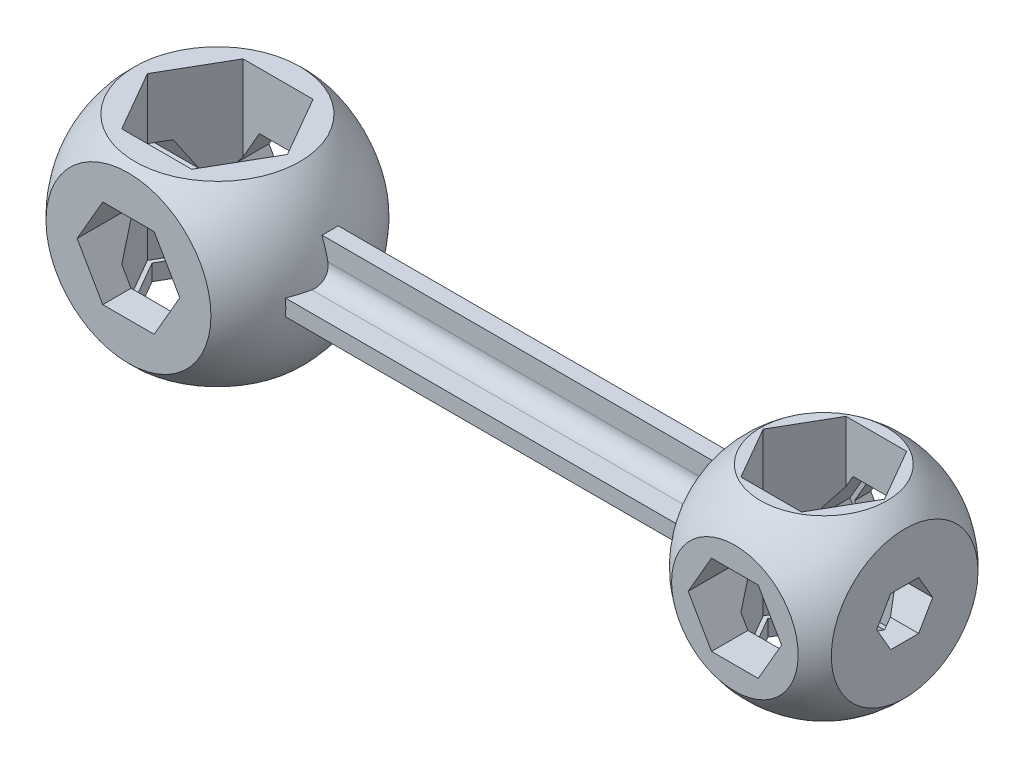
ISO-10303-21;
HEADER;
FILE_DESCRIPTION(('STEP AP214'),'2;1');
FILE_NAME('part.step','',(''),(''),'','','');
FILE_SCHEMA(('AUTOMOTIVE_DESIGN { 1 0 10303 214 1 1 1 1 }'));
ENDSEC;
DATA;
#1=APPLICATION_CONTEXT('core data for automotive mechanical design processes');
#2=APPLICATION_PROTOCOL_DEFINITION('international standard','automotive_design',2000,#1);
#3=PRODUCT_CONTEXT('',#1,'mechanical');
#4=PRODUCT('Part','Part','',(#3));
#5=PRODUCT_RELATED_PRODUCT_CATEGORY('part','',(#4));
#6=PRODUCT_DEFINITION_FORMATION('','',#4);
#7=PRODUCT_DEFINITION_CONTEXT('part definition',#1,'design');
#8=PRODUCT_DEFINITION('design','',#6,#7);
#9=PRODUCT_DEFINITION_SHAPE('','',#8);
#10=(LENGTH_UNIT() NAMED_UNIT(*) SI_UNIT(.MILLI.,.METRE.));
#11=(NAMED_UNIT(*) PLANE_ANGLE_UNIT() SI_UNIT($,.RADIAN.));
#12=(NAMED_UNIT(*) SI_UNIT($,.STERADIAN.) SOLID_ANGLE_UNIT());
#13=UNCERTAINTY_MEASURE_WITH_UNIT(LENGTH_MEASURE(1.E-05),#10,'distance_accuracy_value','');
#14=(GEOMETRIC_REPRESENTATION_CONTEXT(3) GLOBAL_UNCERTAINTY_ASSIGNED_CONTEXT((#13)) GLOBAL_UNIT_ASSIGNED_CONTEXT((#10,
#11,#12)) REPRESENTATION_CONTEXT('',''));
#15=CARTESIAN_POINT('',(0.,0.,0.));
#16=DIRECTION('',(0.,0.,1.));
#17=DIRECTION('',(1.,0.,0.));
#18=AXIS2_PLACEMENT_3D('',#15,#16,#17);
#19=CARTESIAN_POINT('',(78.7527767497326,-30.8578280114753,6.50000000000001));
#20=DIRECTION('',(0.866025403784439,0.,0.499999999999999));
#21=DIRECTION('',(0.499999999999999,0.,-0.86602540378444));
#22=AXIS2_PLACEMENT_3D('',#19,#20,#21);
#23=PLANE('',#22);
#24=DIRECTION('',(-0.277350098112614,0.832050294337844,0.480384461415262));
#25=VECTOR('',#24,1.);
#26=CARTESIAN_POINT('',(73.312741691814,21.5784354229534,15.9224171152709));
#27=LINE('',#26,#25);
#28=CARTESIAN_POINT('',(81.5055534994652,-3.,1.73205080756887));
#29=VERTEX_POINT('',#28);
#30=CARTESIAN_POINT('',(80.6036297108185,-0.294228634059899,3.29422863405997));
#31=VERTEX_POINT('',#30);
#32=EDGE_CURVE('E1675',#29,#31,#27,.T.);
#33=ORIENTED_EDGE('',*,*,#32,.F.);
#34=DIRECTION('',(-0.499999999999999,0.,0.86602540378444));
#35=VECTOR('',#34,1.);
#36=CARTESIAN_POINT('',(57.878915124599,-3.,42.6545888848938));
#37=LINE('',#36,#35);
#38=CARTESIAN_POINT('',(82.5055534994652,-3.,0.));
#39=VERTEX_POINT('',#38);
#40=EDGE_CURVE('E1681',#39,#29,#37,.T.);
#41=ORIENTED_EDGE('',*,*,#40,.F.);
#42=DIRECTION('',(0.,1.,0.));
#43=VECTOR('',#42,1.);
#44=CARTESIAN_POINT('',(82.5055534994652,-30.8578280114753,0.));
#45=LINE('',#44,#43);
#46=CARTESIAN_POINT('',(82.5055534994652,-9.,0.));
#47=VERTEX_POINT('',#46);
#48=EDGE_CURVE('E870',#47,#39,#45,.T.);
#49=ORIENTED_EDGE('',*,*,#48,.F.);
#50=DIRECTION('',(-0.499999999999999,0.,0.86602540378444));
#51=VECTOR('',#50,1.);
#52=CARTESIAN_POINT('',(78.7527767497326,-9.,6.50000000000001));
#53=LINE('',#52,#51);
#54=CARTESIAN_POINT('',(78.7527767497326,-9.,6.50000000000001));
#55=VERTEX_POINT('',#54);
#56=EDGE_CURVE('E832',#47,#55,#53,.T.);
#57=ORIENTED_EDGE('',*,*,#56,.T.);
#58=DIRECTION('',(0.,1.,0.));
#59=VECTOR('',#58,1.);
#60=CARTESIAN_POINT('',(78.7527767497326,-30.8578280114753,6.50000000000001));
#61=LINE('',#60,#59);
#62=CARTESIAN_POINT('',(78.7527767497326,-3.49999999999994,6.50000000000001));
#63=VERTEX_POINT('',#62);
#64=EDGE_CURVE('E826',#55,#63,#61,.T.);
#65=ORIENTED_EDGE('',*,*,#64,.T.);
#66=DIRECTION('',(0.377964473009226,0.654653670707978,-0.654653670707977));
#67=VECTOR('',#66,1.);
#68=CARTESIAN_POINT('',(71.9834698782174,-15.2247834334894,18.2247834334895));
#69=LINE('',#68,#67);
#70=EDGE_CURVE('E727',#63,#31,#69,.T.);
#71=ORIENTED_EDGE('',*,*,#70,.T.);
#72=EDGE_LOOP('',(#33,#41,#49,#57,#65,#71));
#73=FACE_BOUND('',#72,.T.);
#74=ADVANCED_FACE('F80',(#73),#23,.F.);
#75=CARTESIAN_POINT('',(82.5055534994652,-30.8578280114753,0.));
#76=DIRECTION('',(0.866025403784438,0.,-0.5));
#77=DIRECTION('',(-0.5,0.,-0.866025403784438));
#78=AXIS2_PLACEMENT_3D('',#75,#76,#77);
#79=PLANE('',#78);
#80=DIRECTION('',(0.5,0.,0.866025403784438));
#81=VECTOR('',#80,1.);
#82=CARTESIAN_POINT('',(59.3789151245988,-3.,-40.0565126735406));
#83=LINE('',#82,#81);
#84=CARTESIAN_POINT('',(81.5055534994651,-3.,-1.73205080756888));
#85=VERTEX_POINT('',#84);
#86=EDGE_CURVE('E1673',#85,#39,#83,.T.);
#87=ORIENTED_EDGE('',*,*,#86,.F.);
#88=DIRECTION('',(0.277350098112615,-0.832050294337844,0.480384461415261));
#89=VECTOR('',#88,1.);
#90=CARTESIAN_POINT('',(74.2358186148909,18.8092046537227,-14.3236009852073));
#91=LINE('',#90,#89);
#92=CARTESIAN_POINT('',(80.6036297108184,-0.294228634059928,-3.29422863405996));
#93=VERTEX_POINT('',#92);
#94=EDGE_CURVE('E1672',#93,#85,#91,.T.);
#95=ORIENTED_EDGE('',*,*,#94,.F.);
#96=DIRECTION('',(-0.377964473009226,-0.65465367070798,-0.654653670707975));
#97=VECTOR('',#96,1.);
#98=CARTESIAN_POINT('',(74.1279137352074,-11.5104977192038,-14.5104977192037));
#99=LINE('',#98,#97);
#100=CARTESIAN_POINT('',(78.7527767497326,-3.49999999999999,-6.50000000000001));
#101=VERTEX_POINT('',#100);
#102=EDGE_CURVE('E690',#93,#101,#99,.T.);
#103=ORIENTED_EDGE('',*,*,#102,.T.);
#104=DIRECTION('',(0.,1.,0.));
#105=VECTOR('',#104,1.);
#106=CARTESIAN_POINT('',(78.7527767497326,-30.8578280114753,-6.50000000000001));
#107=LINE('',#106,#105);
#108=CARTESIAN_POINT('',(78.7527767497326,-9.,-6.50000000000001));
#109=VERTEX_POINT('',#108);
#110=EDGE_CURVE('E866',#109,#101,#107,.T.);
#111=ORIENTED_EDGE('',*,*,#110,.F.);
#112=DIRECTION('',(0.5,0.,0.866025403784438));
#113=VECTOR('',#112,1.);
#114=CARTESIAN_POINT('',(82.5055534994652,-9.,0.));
#115=LINE('',#114,#113);
#116=EDGE_CURVE('E834',#109,#47,#115,.T.);
#117=ORIENTED_EDGE('',*,*,#116,.T.);
#118=ORIENTED_EDGE('',*,*,#48,.T.);
#119=EDGE_LOOP('',(#87,#95,#103,#111,#117,#118));
#120=FACE_BOUND('',#119,.T.);
#121=ADVANCED_FACE('F1438',(#120),#79,.F.);
#122=CARTESIAN_POINT('',(71.2472232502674,-30.8578280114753,6.50000000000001));
#123=DIRECTION('',(0.,0.,1.));
#124=DIRECTION('',(1.,0.,0.));
#125=AXIS2_PLACEMENT_3D('',#122,#123,#124);
#126=PLANE('',#125);
#127=CARTESIAN_POINT('',(78.7527767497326,3.49999999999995,6.50000000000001));
#128=VERTEX_POINT('',#127);
#129=CARTESIAN_POINT('',(78.7527767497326,11.,6.50000000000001));
#130=VERTEX_POINT('',#129);
#131=EDGE_CURVE('E855',#128,#130,#61,.T.);
#132=ORIENTED_EDGE('',*,*,#131,.F.);
#133=DIRECTION('',(-0.499999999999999,0.866025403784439,0.));
#134=VECTOR('',#133,1.);
#135=CARTESIAN_POINT('',(91.7537643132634,-19.0183710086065,6.50000000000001));
#136=LINE('',#135,#134);
#137=CARTESIAN_POINT('',(77.8867513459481,5.,6.50000000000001));
#138=VERTEX_POINT('',#137);
#139=EDGE_CURVE('E733',#128,#138,#136,.T.);
#140=ORIENTED_EDGE('',*,*,#139,.T.);
#141=DIRECTION('',(-1.,0.,0.));
#142=VECTOR('',#141,1.);
#143=CARTESIAN_POINT('',(71.2472232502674,4.99999999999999,6.50000000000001));
#144=LINE('',#143,#142);
#145=CARTESIAN_POINT('',(72.1132486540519,5.,6.50000000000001));
#146=VERTEX_POINT('',#145);
#147=EDGE_CURVE('E1274',#138,#146,#144,.T.);
#148=ORIENTED_EDGE('',*,*,#147,.T.);
#149=DIRECTION('',(-0.499999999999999,-0.866025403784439,0.));
#150=VECTOR('',#149,1.);
#151=CARTESIAN_POINT('',(56.3698473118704,-22.2683710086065,6.50000000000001));
#152=LINE('',#151,#150);
#153=CARTESIAN_POINT('',(71.2472232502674,3.49999999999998,6.50000000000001));
#154=VERTEX_POINT('',#153);
#155=EDGE_CURVE('E756',#146,#154,#152,.T.);
#156=ORIENTED_EDGE('',*,*,#155,.T.);
#157=DIRECTION('',(0.,1.,0.));
#158=VECTOR('',#157,1.);
#159=CARTESIAN_POINT('',(71.2472232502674,-30.8578280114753,6.50000000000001));
#160=LINE('',#159,#158);
#161=CARTESIAN_POINT('',(71.2472232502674,11.,6.50000000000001));
#162=VERTEX_POINT('',#161);
#163=EDGE_CURVE('E859',#154,#162,#160,.T.);
#164=ORIENTED_EDGE('',*,*,#163,.T.);
#165=DIRECTION('',(1.,0.,0.));
#166=VECTOR('',#165,1.);
#167=CARTESIAN_POINT('',(71.2472232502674,11.,6.50000000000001));
#168=LINE('',#167,#166);
#169=EDGE_CURVE('E849',#162,#130,#168,.T.);
#170=ORIENTED_EDGE('',*,*,#169,.T.);
#171=EDGE_LOOP('',(#132,#140,#148,#156,#164,#170));
#172=FACE_BOUND('',#171,.T.);
#173=ADVANCED_FACE('F1445',(#172),#126,.F.);
#174=CARTESIAN_POINT('',(78.7527767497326,-30.8578280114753,-6.50000000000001));
#175=DIRECTION('',(0.,0.,-1.));
#176=DIRECTION('',(-1.,0.,0.));
#177=AXIS2_PLACEMENT_3D('',#174,#175,#176);
#178=PLANE('',#177);
#179=DIRECTION('',(1.,0.,0.));
#180=VECTOR('',#179,1.);
#181=CARTESIAN_POINT('',(78.7527767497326,4.99999999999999,-6.50000000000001));
#182=LINE('',#181,#180);
#183=CARTESIAN_POINT('',(72.1132486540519,5.,-6.50000000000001));
#184=VERTEX_POINT('',#183);
#185=CARTESIAN_POINT('',(77.8867513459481,5.,-6.50000000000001));
#186=VERTEX_POINT('',#185);
#187=EDGE_CURVE('E759',#184,#186,#182,.T.);
#188=ORIENTED_EDGE('',*,*,#187,.T.);
#189=DIRECTION('',(0.499999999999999,-0.866025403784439,0.));
#190=VECTOR('',#189,1.);
#191=CARTESIAN_POINT('',(93.6301526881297,-22.2683710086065,-6.50000000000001));
#192=LINE('',#191,#190);
#193=CARTESIAN_POINT('',(78.7527767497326,3.5,-6.5));
#194=VERTEX_POINT('',#193);
#195=EDGE_CURVE('E730',#186,#194,#192,.T.);
#196=ORIENTED_EDGE('',*,*,#195,.T.);
#197=CARTESIAN_POINT('',(78.7527767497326,11.,-6.50000000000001));
#198=VERTEX_POINT('',#197);
#199=EDGE_CURVE('E869',#194,#198,#107,.T.);
#200=ORIENTED_EDGE('',*,*,#199,.T.);
#201=DIRECTION('',(-1.,0.,0.));
#202=VECTOR('',#201,1.);
#203=CARTESIAN_POINT('',(78.7527767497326,11.,-6.50000000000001));
#204=LINE('',#203,#202);
#205=CARTESIAN_POINT('',(71.2472232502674,11.,-6.50000000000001));
#206=VERTEX_POINT('',#205);
#207=EDGE_CURVE('E840',#198,#206,#204,.T.);
#208=ORIENTED_EDGE('',*,*,#207,.T.);
#209=DIRECTION('',(0.,1.,0.));
#210=VECTOR('',#209,1.);
#211=CARTESIAN_POINT('',(71.2472232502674,-30.8578280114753,-6.50000000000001));
#212=LINE('',#211,#210);
#213=CARTESIAN_POINT('',(71.2472232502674,3.49999999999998,-6.5));
#214=VERTEX_POINT('',#213);
#215=EDGE_CURVE('E865',#214,#206,#212,.T.);
#216=ORIENTED_EDGE('',*,*,#215,.F.);
#217=DIRECTION('',(0.499999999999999,0.866025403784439,0.));
#218=VECTOR('',#217,1.);
#219=CARTESIAN_POINT('',(58.2462356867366,-19.0183710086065,-6.5));
#220=LINE('',#219,#218);
#221=EDGE_CURVE('E750',#214,#184,#220,.T.);
#222=ORIENTED_EDGE('',*,*,#221,.T.);
#223=EDGE_LOOP('',(#188,#196,#200,#208,#216,#222));
#224=FACE_BOUND('',#223,.T.);
#225=ADVANCED_FACE('F1563',(#224),#178,.F.);
#226=CARTESIAN_POINT('',(-8.66025403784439,-33.9128784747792,0.));
#227=DIRECTION('',(-0.866025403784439,0.,0.5));
#228=DIRECTION('',(0.5,0.,0.866025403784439));
#229=AXIS2_PLACEMENT_3D('',#226,#227,#228);
#230=PLANE('',#229);
#231=DIRECTION('',(-0.5,0.,-0.866025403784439));
#232=VECTOR('',#231,1.);
#233=CARTESIAN_POINT('',(14.7550594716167,-3.50000000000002,40.5565126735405));
#234=LINE('',#233,#232);
#235=CARTESIAN_POINT('',(-7.49358737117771,-3.5,2.02072594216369));
#236=VERTEX_POINT('',#235);
#237=CARTESIAN_POINT('',(-8.66025403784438,-3.5,0.));
#238=VERTEX_POINT('',#237);
#239=EDGE_CURVE('E885',#236,#238,#234,.T.);
#240=ORIENTED_EDGE('',*,*,#239,.F.);
#241=DIRECTION('',(-0.277350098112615,-0.832050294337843,-0.480384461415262));
#242=VECTOR('',#241,1.);
#243=CARTESIAN_POINT('',(-0.109388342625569,18.6525970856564,14.8105338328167));
#244=LINE('',#243,#242);
#245=CARTESIAN_POINT('',(-6.33568051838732,-0.0262794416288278,4.02627944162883));
#246=VERTEX_POINT('',#245);
#247=EDGE_CURVE('E887',#246,#236,#244,.T.);
#248=ORIENTED_EDGE('',*,*,#247,.F.);
#249=DIRECTION('',(-0.377964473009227,0.654653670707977,-0.654653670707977));
#250=VECTOR('',#249,1.);
#251=CARTESIAN_POINT('',(-11.0523811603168,8.14328571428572,-4.14328571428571));
#252=LINE('',#251,#250);
#253=CARTESIAN_POINT('',(-4.33012701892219,-3.49999999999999,7.5));
#254=VERTEX_POINT('',#253);
#255=EDGE_CURVE('E1002',#254,#246,#252,.T.);
#256=ORIENTED_EDGE('',*,*,#255,.F.);
#257=DIRECTION('',(0.,1.,0.));
#258=VECTOR('',#257,1.);
#259=CARTESIAN_POINT('',(-4.33012701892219,-33.9128784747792,7.5));
#260=LINE('',#259,#258);
#261=CARTESIAN_POINT('',(-4.33012701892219,-9.,7.5));
#262=VERTEX_POINT('',#261);
#263=EDGE_CURVE('E1123',#262,#254,#260,.T.);
#264=ORIENTED_EDGE('',*,*,#263,.F.);
#265=DIRECTION('',(-0.5,0.,-0.866025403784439));
#266=VECTOR('',#265,1.);
#267=CARTESIAN_POINT('',(-8.66025403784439,-9.,0.));
#268=LINE('',#267,#266);
#269=CARTESIAN_POINT('',(-8.66025403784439,-9.,0.));
#270=VERTEX_POINT('',#269);
#271=EDGE_CURVE('E1096',#262,#270,#268,.T.);
#272=ORIENTED_EDGE('',*,*,#271,.T.);
#273=DIRECTION('',(0.,1.,0.));
#274=VECTOR('',#273,1.);
#275=CARTESIAN_POINT('',(-8.66025403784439,-33.9128784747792,0.));
#276=LINE('',#275,#274);
#277=EDGE_CURVE('E1127',#270,#238,#276,.T.);
#278=ORIENTED_EDGE('',*,*,#277,.T.);
#279=EDGE_LOOP('',(#240,#248,#256,#264,#272,#278));
#280=FACE_BOUND('',#279,.T.);
#281=ADVANCED_FACE('F2186',(#280),#230,.F.);
#282=CARTESIAN_POINT('',(4.33012701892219,-33.9128784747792,-7.5));
#283=DIRECTION('',(0.,0.,-1.));
#284=DIRECTION('',(-1.,0.,0.));
#285=AXIS2_PLACEMENT_3D('',#282,#283,#284);
#286=PLANE('',#285);
#287=DIRECTION('',(-1.,0.,0.));
#288=VECTOR('',#287,1.);
#289=CARTESIAN_POINT('',(-2.3094010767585,4.,-7.5));
#290=LINE('',#289,#288);
#291=CARTESIAN_POINT('',(2.3094010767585,4.,-7.5));
#292=VERTEX_POINT('',#291);
#293=CARTESIAN_POINT('',(-2.30940107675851,4.,-7.5));
#294=VERTEX_POINT('',#293);
#295=EDGE_CURVE('E940',#292,#294,#290,.T.);
#296=ORIENTED_EDGE('',*,*,#295,.F.);
#297=DIRECTION('',(-0.5,0.866025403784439,0.));
#298=VECTOR('',#297,1.);
#299=CARTESIAN_POINT('',(2.3094010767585,4.,-7.5));
#300=LINE('',#299,#298);
#301=CARTESIAN_POINT('',(4.3301270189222,0.499999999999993,-7.5));
#302=VERTEX_POINT('',#301);
#303=EDGE_CURVE('E943',#302,#292,#300,.T.);
#304=ORIENTED_EDGE('',*,*,#303,.F.);
#305=DIRECTION('',(0.,1.,0.));
#306=VECTOR('',#305,1.);
#307=CARTESIAN_POINT('',(4.33012701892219,-33.9128784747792,-7.5));
#308=LINE('',#307,#306);
#309=CARTESIAN_POINT('',(4.33012701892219,11.,-7.5));
#310=VERTEX_POINT('',#309);
#311=EDGE_CURVE('E1138',#302,#310,#308,.T.);
#312=ORIENTED_EDGE('',*,*,#311,.T.);
#313=DIRECTION('',(-1.,0.,0.));
#314=VECTOR('',#313,1.);
#315=CARTESIAN_POINT('',(4.33012701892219,11.,-7.5));
#316=LINE('',#315,#314);
#317=CARTESIAN_POINT('',(-4.33012701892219,11.,-7.5));
#318=VERTEX_POINT('',#317);
#319=EDGE_CURVE('E1107',#310,#318,#316,.T.);
#320=ORIENTED_EDGE('',*,*,#319,.T.);
#321=DIRECTION('',(0.,1.,0.));
#322=VECTOR('',#321,1.);
#323=CARTESIAN_POINT('',(-4.33012701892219,-33.9128784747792,-7.5));
#324=LINE('',#323,#322);
#325=CARTESIAN_POINT('',(-4.33012701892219,0.500000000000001,-7.5));
#326=VERTEX_POINT('',#325);
#327=EDGE_CURVE('E1134',#326,#318,#324,.T.);
#328=ORIENTED_EDGE('',*,*,#327,.F.);
#329=DIRECTION('',(-0.5,-0.866025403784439,0.));
#330=VECTOR('',#329,1.);
#331=CARTESIAN_POINT('',(-4.61880215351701,0.,-7.5));
#332=LINE('',#331,#330);
#333=EDGE_CURVE('E938',#294,#326,#332,.T.);
#334=ORIENTED_EDGE('',*,*,#333,.F.);
#335=EDGE_LOOP('',(#296,#304,#312,#320,#328,#334));
#336=FACE_BOUND('',#335,.T.);
#337=ADVANCED_FACE('F2092',(#336),#286,.F.);
#338=CARTESIAN_POINT('',(-4.33012701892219,-33.9128784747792,7.5));
#339=DIRECTION('',(0.,0.,1.));
#340=DIRECTION('',(1.,0.,0.));
#341=AXIS2_PLACEMENT_3D('',#338,#339,#340);
#342=PLANE('',#341);
#343=DIRECTION('',(-1.,0.,0.));
#344=VECTOR('',#343,1.);
#345=CARTESIAN_POINT('',(-3.17542648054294,-5.5,7.5));
#346=LINE('',#345,#344);
#347=CARTESIAN_POINT('',(3.17542648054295,-5.5,7.5));
#348=VERTEX_POINT('',#347);
#349=CARTESIAN_POINT('',(-3.17542648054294,-5.5,7.5));
#350=VERTEX_POINT('',#349);
#351=EDGE_CURVE('E994',#348,#350,#346,.T.);
#352=ORIENTED_EDGE('',*,*,#351,.F.);
#353=DIRECTION('',(-0.5,-0.866025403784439,0.));
#354=VECTOR('',#353,1.);
#355=CARTESIAN_POINT('',(3.17542648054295,-5.5,7.5));
#356=LINE('',#355,#354);
#357=CARTESIAN_POINT('',(4.3301270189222,-3.5,7.5));
#358=VERTEX_POINT('',#357);
#359=EDGE_CURVE('E997',#358,#348,#356,.T.);
#360=ORIENTED_EDGE('',*,*,#359,.F.);
#361=DIRECTION('',(0.,1.,0.));
#362=VECTOR('',#361,1.);
#363=CARTESIAN_POINT('',(4.3301270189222,-33.9128784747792,7.5));
#364=LINE('',#363,#362);
#365=CARTESIAN_POINT('',(4.3301270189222,-9.,7.5));
#366=VERTEX_POINT('',#365);
#367=EDGE_CURVE('E1094',#366,#358,#364,.T.);
#368=ORIENTED_EDGE('',*,*,#367,.F.);
#369=DIRECTION('',(-1.,0.,0.));
#370=VECTOR('',#369,1.);
#371=CARTESIAN_POINT('',(-4.33012701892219,-9.,7.5));
#372=LINE('',#371,#370);
#373=EDGE_CURVE('E1098',#366,#262,#372,.T.);
#374=ORIENTED_EDGE('',*,*,#373,.T.);
#375=ORIENTED_EDGE('',*,*,#263,.T.);
#376=DIRECTION('',(-0.5,0.866025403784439,0.));
#377=VECTOR('',#376,1.);
#378=CARTESIAN_POINT('',(-6.35085296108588,0.,7.5));
#379=LINE('',#378,#377);
#380=EDGE_CURVE('E992',#350,#254,#379,.T.);
#381=ORIENTED_EDGE('',*,*,#380,.F.);
#382=EDGE_LOOP('',(#352,#360,#368,#374,#375,#381));
#383=FACE_BOUND('',#382,.T.);
#384=ADVANCED_FACE('F1347',(#383),#342,.F.);
#385=CARTESIAN_POINT('',(0.,0.,0.));
#386=DIRECTION('',(1.,0.,0.));
#387=DIRECTION('',(0.,0.,1.));
#388=AXIS2_PLACEMENT_3D('',#385,#386,#387);
#389=SPHERICAL_SURFACE('',#388,15.);
#390=CARTESIAN_POINT('',(0.,0.,-11.));
#391=DIRECTION('',(0.,0.,-1.));
#392=DIRECTION('',(-1.,0.,0.));
#393=AXIS2_PLACEMENT_3D('',#390,#391,#392);
#394=CIRCLE('',#393,10.1980390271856);
#395=CARTESIAN_POINT('',(-10.1980390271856,0.,-11.));
#396=VERTEX_POINT('',#395);
#397=EDGE_CURVE('E1147',#396,#396,#394,.F.);
#398=ORIENTED_EDGE('',*,*,#397,.T.);
#399=EDGE_LOOP('',(#398));
#400=FACE_BOUND('',#399,.T.);
#401=CARTESIAN_POINT('',(-13.,0.,0.));
#402=DIRECTION('',(-1.,0.,0.));
#403=DIRECTION('',(0.,0.,1.));
#404=AXIS2_PLACEMENT_3D('',#401,#402,#403);
#405=CIRCLE('',#404,7.48331477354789);
#406=CARTESIAN_POINT('',(-13.,0.,7.48331477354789));
#407=VERTEX_POINT('',#406);
#408=EDGE_CURVE('E1241',#407,#407,#405,.F.);
#409=ORIENTED_EDGE('',*,*,#408,.T.);
#410=EDGE_LOOP('',(#409));
#411=FACE_BOUND('',#410,.T.);
#412=CARTESIAN_POINT('',(0.,1.,0.));
#413=DIRECTION('',(0.,1.,0.));
#414=DIRECTION('',(0.,0.,1.));
#415=AXIS2_PLACEMENT_3D('',#412,#413,#414);
#416=CIRCLE('',#415,14.9666295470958);
#417=CARTESIAN_POINT('',(14.6628782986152,1.,3.));
#418=VERTEX_POINT('',#417);
#419=CARTESIAN_POINT('',(13.9194109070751,1.,5.5));
#420=VERTEX_POINT('',#419);
#421=EDGE_CURVE('E1216',#418,#420,#416,.F.);
#422=ORIENTED_EDGE('',*,*,#421,.F.);
#423=CARTESIAN_POINT('',(14.6628782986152,1.,3.));
#424=CARTESIAN_POINT('',(14.6740594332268,1.00000053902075,2.94535027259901));
#425=CARTESIAN_POINT('',(14.6847836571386,1.00224154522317,2.8906307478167));
#426=CARTESIAN_POINT('',(14.7052540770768,1.01122888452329,2.78137232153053));
#427=CARTESIAN_POINT('',(14.7150001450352,1.01797580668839,2.72683344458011));
#428=CARTESIAN_POINT('',(14.7426595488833,1.04500041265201,2.56405457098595));
#429=CARTESIAN_POINT('',(14.7590075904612,1.07206188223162,2.45658630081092));
#430=CARTESIAN_POINT('',(14.7869961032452,1.14386584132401,2.24695812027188));
#431=CARTESIAN_POINT('',(14.7986302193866,1.18863203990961,2.14480553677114));
#432=CARTESIAN_POINT('',(14.8167901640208,1.29474402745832,1.94905802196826));
#433=CARTESIAN_POINT('',(14.8233190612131,1.35607982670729,1.85545797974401));
#434=CARTESIAN_POINT('',(14.8309767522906,1.49216911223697,1.68152139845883));
#435=CARTESIAN_POINT('',(14.8322165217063,1.5666123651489,1.60094678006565));
#436=CARTESIAN_POINT('',(14.8295605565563,1.72761971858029,1.4530695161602));
#437=CARTESIAN_POINT('',(14.825664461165,1.81418467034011,1.3857678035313));
#438=CARTESIAN_POINT('',(14.8129285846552,1.99593030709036,1.26693407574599));
#439=CARTESIAN_POINT('',(14.8041393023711,2.09101479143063,1.21524916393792));
#440=CARTESIAN_POINT('',(14.7819215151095,2.28781886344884,1.12800095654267));
#441=CARTESIAN_POINT('',(14.7684929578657,2.38953852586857,1.09243784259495));
#442=CARTESIAN_POINT('',(14.7404794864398,2.57620962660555,1.04352692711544));
#443=CARTESIAN_POINT('',(14.7266465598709,2.6605057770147,1.02717902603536));
#444=CARTESIAN_POINT('',(14.6965343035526,2.82994164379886,1.00540920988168));
#445=CARTESIAN_POINT('',(14.6802585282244,2.91507996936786,0.999971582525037));
#446=CARTESIAN_POINT('',(14.6628782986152,3.,0.999999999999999));
#447=B_SPLINE_CURVE_WITH_KNOTS('',3,(#423,#424,#425,#426,#427,#428,#429,#430,#431,#432,#433,
#434,#435,#436,#437,#438,#439,#440,#441,#442,#443,#444,#445,#446),.UNSPECIFIED.,.F.,.F.,(4,2,2,
2,2,2,2,2,2,2,2,4),(0.,0.167250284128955,0.33452243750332,0.668867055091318,1.00366093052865,
1.33825340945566,1.66578989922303,1.99334940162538,2.3175894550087,2.64183316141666,
2.90204829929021,3.16188842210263),.UNSPECIFIED.);
#448=CARTESIAN_POINT('',(14.6628782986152,3.,0.999999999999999));
#449=VERTEX_POINT('',#448);
#450=EDGE_CURVE('E1335',#418,#449,#447,.T.);
#451=ORIENTED_EDGE('',*,*,#450,.T.);
#452=CARTESIAN_POINT('',(0.,0.,0.999999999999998));
#453=DIRECTION('',(0.,0.,-1.));
#454=DIRECTION('',(0.,1.,0.));
#455=AXIS2_PLACEMENT_3D('',#452,#453,#454);
#456=CIRCLE('',#455,14.9666295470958);
#457=CARTESIAN_POINT('',(13.9194109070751,5.5,1.));
#458=VERTEX_POINT('',#457);
#459=EDGE_CURVE('E1197',#449,#458,#456,.F.);
#460=ORIENTED_EDGE('',*,*,#459,.T.);
#461=CARTESIAN_POINT('',(0.,5.5,0.));
#462=DIRECTION('',(0.,1.,0.));
#463=DIRECTION('',(0.,0.,1.));
#464=AXIS2_PLACEMENT_3D('',#461,#462,#463);
#465=CIRCLE('',#464,13.9552857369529);
#466=CARTESIAN_POINT('',(13.9194109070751,5.5,-1.));
#467=VERTEX_POINT('',#466);
#468=EDGE_CURVE('E1207',#467,#458,#465,.F.);
#469=ORIENTED_EDGE('',*,*,#468,.F.);
#470=CARTESIAN_POINT('',(0.,0.,-1.));
#471=DIRECTION('',(0.,0.,-1.));
#472=DIRECTION('',(0.,1.,0.));
#473=AXIS2_PLACEMENT_3D('',#470,#471,#472);
#474=CIRCLE('',#473,14.9666295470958);
#475=CARTESIAN_POINT('',(14.6628782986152,3.,-1.));
#476=VERTEX_POINT('',#475);
#477=EDGE_CURVE('E1203',#476,#467,#474,.F.);
#478=ORIENTED_EDGE('',*,*,#477,.F.);
#479=CARTESIAN_POINT('',(14.6628782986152,3.,-1.));
#480=CARTESIAN_POINT('',(14.6740594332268,2.94535027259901,-1.00000053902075));
#481=CARTESIAN_POINT('',(14.6847836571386,2.8906307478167,-1.00224154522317));
#482=CARTESIAN_POINT('',(14.7052540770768,2.78137232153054,-1.01122888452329));
#483=CARTESIAN_POINT('',(14.7150001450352,2.72683344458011,-1.01797580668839));
#484=CARTESIAN_POINT('',(14.7426595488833,2.56405457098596,-1.04500041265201));
#485=CARTESIAN_POINT('',(14.7590075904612,2.45658630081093,-1.07206188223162));
#486=CARTESIAN_POINT('',(14.7869961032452,2.24695812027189,-1.14386584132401));
#487=CARTESIAN_POINT('',(14.7986302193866,2.14480553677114,-1.18863203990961));
#488=CARTESIAN_POINT('',(14.8167901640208,1.94905802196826,-1.29474402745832));
#489=CARTESIAN_POINT('',(14.8233190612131,1.85545797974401,-1.35607982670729));
#490=CARTESIAN_POINT('',(14.8309767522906,1.68152139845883,-1.49216911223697));
#491=CARTESIAN_POINT('',(14.8322165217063,1.60094678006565,-1.5666123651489));
#492=CARTESIAN_POINT('',(14.8295605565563,1.4530695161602,-1.72761971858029));
#493=CARTESIAN_POINT('',(14.825664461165,1.38576780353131,-1.81418467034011));
#494=CARTESIAN_POINT('',(14.8129285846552,1.26693407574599,-1.99593030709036));
#495=CARTESIAN_POINT('',(14.8041393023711,1.21524916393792,-2.09101479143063));
#496=CARTESIAN_POINT('',(14.7819215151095,1.12800095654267,-2.28781886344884));
#497=CARTESIAN_POINT('',(14.7684929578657,1.09243784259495,-2.38953852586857));
#498=CARTESIAN_POINT('',(14.7404794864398,1.04352692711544,-2.57620962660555));
#499=CARTESIAN_POINT('',(14.7266465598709,1.02717902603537,-2.6605057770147));
#500=CARTESIAN_POINT('',(14.6965343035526,1.00540920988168,-2.82994164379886));
#501=CARTESIAN_POINT('',(14.6802585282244,0.999971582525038,-2.91507996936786));
#502=CARTESIAN_POINT('',(14.6628782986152,1.,-3.));
#503=B_SPLINE_CURVE_WITH_KNOTS('',3,(#479,#480,#481,#482,#483,#484,#485,#486,#487,#488,#489,
#490,#491,#492,#493,#494,#495,#496,#497,#498,#499,#500,#501,#502),.UNSPECIFIED.,.F.,.F.,(4,2,2,
2,2,2,2,2,2,2,2,4),(0.,0.167250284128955,0.33452243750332,0.668867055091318,1.00366093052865,
1.33825340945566,1.66578989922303,1.99334940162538,2.3175894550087,2.64183316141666,
2.90204829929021,3.16188842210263),.UNSPECIFIED.);
#504=CARTESIAN_POINT('',(14.6628782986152,1.,-3.));
#505=VERTEX_POINT('',#504);
#506=EDGE_CURVE('E1329',#476,#505,#503,.T.);
#507=ORIENTED_EDGE('',*,*,#506,.T.);
#508=CARTESIAN_POINT('',(13.9194109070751,1.,-5.5));
#509=VERTEX_POINT('',#508);
#510=EDGE_CURVE('E1218',#509,#505,#416,.F.);
#511=ORIENTED_EDGE('',*,*,#510,.F.);
#512=CARTESIAN_POINT('',(0.,0.,-5.5));
#513=DIRECTION('',(0.,0.,-1.));
#514=DIRECTION('',(-1.,0.,0.));
#515=AXIS2_PLACEMENT_3D('',#512,#513,#514);
#516=CIRCLE('',#515,13.9552857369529);
#517=CARTESIAN_POINT('',(13.9194109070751,-0.999999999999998,-5.5));
#518=VERTEX_POINT('',#517);
#519=EDGE_CURVE('E1219',#518,#509,#516,.F.);
#520=ORIENTED_EDGE('',*,*,#519,.F.);
#521=CARTESIAN_POINT('',(0.,-0.999999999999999,0.));
#522=DIRECTION('',(0.,1.,0.));
#523=DIRECTION('',(0.,0.,1.));
#524=AXIS2_PLACEMENT_3D('',#521,#522,#523);
#525=CIRCLE('',#524,14.9666295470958);
#526=CARTESIAN_POINT('',(14.6628782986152,-0.999999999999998,-3.));
#527=VERTEX_POINT('',#526);
#528=EDGE_CURVE('E1213',#518,#527,#525,.F.);
#529=ORIENTED_EDGE('',*,*,#528,.T.);
#530=CARTESIAN_POINT('',(14.6628782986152,-0.999999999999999,-3.));
#531=CARTESIAN_POINT('',(14.6740594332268,-1.00000053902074,-2.94535027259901));
#532=CARTESIAN_POINT('',(14.6847836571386,-1.00224154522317,-2.8906307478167));
#533=CARTESIAN_POINT('',(14.7052540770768,-1.01122888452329,-2.78137232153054));
#534=CARTESIAN_POINT('',(14.7150001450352,-1.01797580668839,-2.72683344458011));
#535=CARTESIAN_POINT('',(14.7426595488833,-1.04500041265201,-2.56405457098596));
#536=CARTESIAN_POINT('',(14.7590075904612,-1.07206188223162,-2.45658630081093));
#537=CARTESIAN_POINT('',(14.7869961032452,-1.14386584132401,-2.24695812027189));
#538=CARTESIAN_POINT('',(14.7986302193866,-1.18863203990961,-2.14480553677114));
#539=CARTESIAN_POINT('',(14.8167901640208,-1.29474402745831,-1.94905802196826));
#540=CARTESIAN_POINT('',(14.8233190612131,-1.35607982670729,-1.85545797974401));
#541=CARTESIAN_POINT('',(14.8309767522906,-1.49216911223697,-1.68152139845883));
#542=CARTESIAN_POINT('',(14.8322165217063,-1.56661236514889,-1.60094678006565));
#543=CARTESIAN_POINT('',(14.8295605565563,-1.72761971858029,-1.45306951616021));
#544=CARTESIAN_POINT('',(14.825664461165,-1.81418467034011,-1.38576780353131));
#545=CARTESIAN_POINT('',(14.8129285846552,-1.99593030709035,-1.26693407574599));
#546=CARTESIAN_POINT('',(14.8041393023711,-2.09101479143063,-1.21524916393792));
#547=CARTESIAN_POINT('',(14.7819215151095,-2.28781886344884,-1.12800095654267));
#548=CARTESIAN_POINT('',(14.7684929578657,-2.38953852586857,-1.09243784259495));
#549=CARTESIAN_POINT('',(14.7404794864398,-2.57620962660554,-1.04352692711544));
#550=CARTESIAN_POINT('',(14.7266465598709,-2.6605057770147,-1.02717902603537));
#551=CARTESIAN_POINT('',(14.6965343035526,-2.82994164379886,-1.00540920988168));
#552=CARTESIAN_POINT('',(14.6802585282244,-2.91507996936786,-0.99997158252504));
#553=CARTESIAN_POINT('',(14.6628782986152,-3.,-1.));
#554=B_SPLINE_CURVE_WITH_KNOTS('',3,(#530,#531,#532,#533,#534,#535,#536,#537,#538,#539,#540,
#541,#542,#543,#544,#545,#546,#547,#548,#549,#550,#551,#552,#553),.UNSPECIFIED.,.F.,.F.,(4,2,2,
2,2,2,2,2,2,2,2,4),(0.,0.167250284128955,0.33452243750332,0.668867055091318,1.00366093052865,
1.33825340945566,1.66578989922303,1.99334940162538,2.3175894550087,2.64183316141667,
2.90204829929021,3.16188842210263),.UNSPECIFIED.);
#555=CARTESIAN_POINT('',(14.6628782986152,-3.,-1.));
#556=VERTEX_POINT('',#555);
#557=EDGE_CURVE('E1353',#527,#556,#554,.T.);
#558=ORIENTED_EDGE('',*,*,#557,.T.);
#559=CARTESIAN_POINT('',(13.9194109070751,-5.5,-1.));
#560=VERTEX_POINT('',#559);
#561=EDGE_CURVE('E1204',#560,#556,#474,.F.);
#562=ORIENTED_EDGE('',*,*,#561,.F.);
#563=CARTESIAN_POINT('',(0.,-5.5,0.));
#564=DIRECTION('',(0.,-1.,0.));
#565=DIRECTION('',(0.,0.,-1.));
#566=AXIS2_PLACEMENT_3D('',#563,#564,#565);
#567=CIRCLE('',#566,13.9552857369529);
#568=CARTESIAN_POINT('',(13.9194109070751,-5.5,0.999999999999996));
#569=VERTEX_POINT('',#568);
#570=EDGE_CURVE('E1200',#569,#560,#567,.F.);
#571=ORIENTED_EDGE('',*,*,#570,.F.);
#572=CARTESIAN_POINT('',(14.6628782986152,-3.,0.999999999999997));
#573=VERTEX_POINT('',#572);
#574=EDGE_CURVE('E1198',#569,#573,#456,.F.);
#575=ORIENTED_EDGE('',*,*,#574,.T.);
#576=CARTESIAN_POINT('',(14.6628782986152,-3.,0.999999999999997));
#577=CARTESIAN_POINT('',(14.6740594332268,-2.94535027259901,1.00000053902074));
#578=CARTESIAN_POINT('',(14.6847836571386,-2.8906307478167,1.00224154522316));
#579=CARTESIAN_POINT('',(14.7052540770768,-2.78137232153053,1.01122888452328));
#580=CARTESIAN_POINT('',(14.7150001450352,-2.72683344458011,1.01797580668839));
#581=CARTESIAN_POINT('',(14.7426595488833,-2.56405457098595,1.04500041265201));
#582=CARTESIAN_POINT('',(14.7590075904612,-2.45658630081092,1.07206188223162));
#583=CARTESIAN_POINT('',(14.7869961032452,-2.24695812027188,1.14386584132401));
#584=CARTESIAN_POINT('',(14.7986302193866,-2.14480553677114,1.18863203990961));
#585=CARTESIAN_POINT('',(14.8167901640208,-1.94905802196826,1.29474402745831));
#586=CARTESIAN_POINT('',(14.8233190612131,-1.85545797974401,1.35607982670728));
#587=CARTESIAN_POINT('',(14.8309767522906,-1.68152139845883,1.49216911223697));
#588=CARTESIAN_POINT('',(14.8322165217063,-1.60094678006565,1.56661236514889));
#589=CARTESIAN_POINT('',(14.8295605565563,-1.4530695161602,1.72761971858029));
#590=CARTESIAN_POINT('',(14.825664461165,-1.3857678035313,1.81418467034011));
#591=CARTESIAN_POINT('',(14.8129285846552,-1.26693407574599,1.99593030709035));
#592=CARTESIAN_POINT('',(14.8041393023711,-1.21524916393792,2.09101479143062));
#593=CARTESIAN_POINT('',(14.7819215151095,-1.12800095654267,2.28781886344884));
#594=CARTESIAN_POINT('',(14.7684929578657,-1.09243784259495,2.38953852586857));
#595=CARTESIAN_POINT('',(14.7404794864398,-1.04352692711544,2.57620962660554));
#596=CARTESIAN_POINT('',(14.7266465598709,-1.02717902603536,2.6605057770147));
#597=CARTESIAN_POINT('',(14.6965343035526,-1.00540920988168,2.82994164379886));
#598=CARTESIAN_POINT('',(14.6802585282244,-0.999971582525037,2.91507996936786));
#599=CARTESIAN_POINT('',(14.6628782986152,-1.,3.));
#600=B_SPLINE_CURVE_WITH_KNOTS('',3,(#576,#577,#578,#579,#580,#581,#582,#583,#584,#585,#586,
#587,#588,#589,#590,#591,#592,#593,#594,#595,#596,#597,#598,#599),.UNSPECIFIED.,.F.,.F.,(4,2,2,
2,2,2,2,2,2,2,2,4),(0.,0.167250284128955,0.33452243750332,0.668867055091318,1.00366093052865,
1.33825340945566,1.66578989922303,1.99334940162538,2.3175894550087,2.64183316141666,
2.90204829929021,3.16188842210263),.UNSPECIFIED.);
#601=CARTESIAN_POINT('',(14.6628782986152,-1.,3.));
#602=VERTEX_POINT('',#601);
#603=EDGE_CURVE('E104',#573,#602,#600,.T.);
#604=ORIENTED_EDGE('',*,*,#603,.T.);
#605=CARTESIAN_POINT('',(13.9194109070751,-1.,5.5));
#606=VERTEX_POINT('',#605);
#607=EDGE_CURVE('E1210',#602,#606,#525,.F.);
#608=ORIENTED_EDGE('',*,*,#607,.T.);
#609=CARTESIAN_POINT('',(0.,0.,5.5));
#610=DIRECTION('',(0.,0.,1.));
#611=DIRECTION('',(1.,0.,0.));
#612=AXIS2_PLACEMENT_3D('',#609,#610,#611);
#613=CIRCLE('',#612,13.9552857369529);
#614=EDGE_CURVE('E1212',#420,#606,#613,.F.);
#615=ORIENTED_EDGE('',*,*,#614,.F.);
#616=EDGE_LOOP('',(#422,#451,#460,#469,#478,#507,#511,#520,#529,#558,#562,#571,#575,#604,#608,#615));
#617=FACE_BOUND('',#616,.T.);
#618=CARTESIAN_POINT('',(0.,11.,0.));
#619=DIRECTION('',(0.,-1.,0.));
#620=DIRECTION('',(0.,0.,-1.));
#621=AXIS2_PLACEMENT_3D('',#618,#619,#620);
#622=CIRCLE('',#621,10.1980390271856);
#623=CARTESIAN_POINT('',(0.,11.,-10.1980390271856));
#624=VERTEX_POINT('',#623);
#625=EDGE_CURVE('E1230',#624,#624,#622,.F.);
#626=ORIENTED_EDGE('',*,*,#625,.F.);
#627=EDGE_LOOP('',(#626));
#628=FACE_BOUND('',#627,.T.);
#629=CARTESIAN_POINT('',(0.,-11.,0.));
#630=DIRECTION('',(0.,1.,0.));
#631=DIRECTION('',(0.,0.,1.));
#632=AXIS2_PLACEMENT_3D('',#629,#630,#631);
#633=CIRCLE('',#632,10.1980390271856);
#634=CARTESIAN_POINT('',(0.,-11.,10.1980390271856));
#635=VERTEX_POINT('',#634);
#636=EDGE_CURVE('E1233',#635,#635,#633,.F.);
#637=ORIENTED_EDGE('',*,*,#636,.F.);
#638=EDGE_LOOP('',(#637));
#639=FACE_BOUND('',#638,.T.);
#640=CARTESIAN_POINT('',(0.,0.,11.));
#641=DIRECTION('',(0.,0.,1.));
#642=DIRECTION('',(1.,0.,0.));
#643=AXIS2_PLACEMENT_3D('',#640,#641,#642);
#644=CIRCLE('',#643,10.1980390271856);
#645=CARTESIAN_POINT('',(10.1980390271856,0.,11.));
#646=VERTEX_POINT('',#645);
#647=EDGE_CURVE('E1143',#646,#646,#644,.F.);
#648=ORIENTED_EDGE('',*,*,#647,.T.);
#649=EDGE_LOOP('',(#648));
#650=FACE_BOUND('',#649,.T.);
#651=ADVANCED_FACE('F1297',(#400,#411,#617,#628,#639,#650),#389,.T.);
#652=CARTESIAN_POINT('',(75.,0.,0.));
#653=DIRECTION('',(0.,0.,1.));
#654=DIRECTION('',(0.,1.,0.));
#655=AXIS2_PLACEMENT_3D('',#652,#653,#654);
#656=SPHERICAL_SURFACE('',#655,13.5);
#657=CARTESIAN_POINT('',(75.,0.,-11.));
#658=DIRECTION('',(0.,0.,-1.));
#659=DIRECTION('',(-1.,0.,0.));
#660=AXIS2_PLACEMENT_3D('',#657,#658,#659);
#661=CIRCLE('',#660,7.82623792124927);
#662=CARTESIAN_POINT('',(67.1737620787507,0.,-11.));
#663=VERTEX_POINT('',#662);
#664=EDGE_CURVE('E1146',#663,#663,#661,.T.);
#665=ORIENTED_EDGE('',*,*,#664,.F.);
#666=EDGE_LOOP('',(#665));
#667=FACE_BOUND('',#666,.T.);
#668=CARTESIAN_POINT('',(85.,0.,0.));
#669=DIRECTION('',(1.,0.,0.));
#670=DIRECTION('',(0.,0.,-1.));
#671=AXIS2_PLACEMENT_3D('',#668,#669,#670);
#672=CIRCLE('',#671,9.06917857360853);
#673=CARTESIAN_POINT('',(85.,0.,-9.06917857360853));
#674=VERTEX_POINT('',#673);
#675=EDGE_CURVE('E1236',#674,#674,#672,.T.);
#676=ORIENTED_EDGE('',*,*,#675,.F.);
#677=EDGE_LOOP('',(#676));
#678=FACE_BOUND('',#677,.T.);
#679=CARTESIAN_POINT('',(75.,0.,0.999999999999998));
#680=DIRECTION('',(0.,0.,-1.));
#681=DIRECTION('',(0.,1.,0.));
#682=AXIS2_PLACEMENT_3D('',#679,#680,#681);
#683=CIRCLE('',#682,13.4629120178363);
#684=CARTESIAN_POINT('',(62.7117942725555,5.5,1.));
#685=VERTEX_POINT('',#684);
#686=CARTESIAN_POINT('',(61.8755952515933,3.,0.999999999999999));
#687=VERTEX_POINT('',#686);
#688=EDGE_CURVE('E1161',#685,#687,#683,.F.);
#689=ORIENTED_EDGE('',*,*,#688,.T.);
#690=CARTESIAN_POINT('',(61.8755952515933,3.,0.999999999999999));
#691=CARTESIAN_POINT('',(61.8631885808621,2.94572271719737,1.00000058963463));
#692=CARTESIAN_POINT('',(61.851283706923,2.89135371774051,1.00221113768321));
#693=CARTESIAN_POINT('',(61.8285486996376,2.78274595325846,1.01108734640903));
#694=CARTESIAN_POINT('',(61.8177187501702,2.72850721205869,1.01775376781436));
#695=CARTESIAN_POINT('',(61.7869612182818,2.56652213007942,1.04448239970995));
#696=CARTESIAN_POINT('',(61.7687573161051,2.45946914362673,1.07127393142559));
#697=CARTESIAN_POINT('',(61.7375446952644,2.25044253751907,1.14247829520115));
#698=CARTESIAN_POINT('',(61.7245440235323,2.14847699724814,1.18691821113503));
#699=CARTESIAN_POINT('',(61.7042037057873,1.95294741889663,1.29237010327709));
#700=CARTESIAN_POINT('',(61.6968600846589,1.85937752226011,1.35337040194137));
#701=CARTESIAN_POINT('',(61.6881903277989,1.68580757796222,1.4884827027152));
#702=CARTESIAN_POINT('',(61.6867137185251,1.60551954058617,1.56221549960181));
#703=CARTESIAN_POINT('',(61.6894112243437,1.45801575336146,1.72168895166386));
#704=CARTESIAN_POINT('',(61.6935855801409,1.39080056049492,1.80743011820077));
#705=CARTESIAN_POINT('',(61.7073569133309,1.27208725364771,1.98719371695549));
#706=CARTESIAN_POINT('',(61.7168843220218,1.22040030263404,2.08109709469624));
#707=CARTESIAN_POINT('',(61.7410148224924,1.13282725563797,2.27541552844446));
#708=CARTESIAN_POINT('',(61.7556186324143,1.09694339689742,2.37583150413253));
#709=CARTESIAN_POINT('',(61.7866954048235,1.04617463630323,2.56362224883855));
#710=CARTESIAN_POINT('',(61.8024766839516,1.02882170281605,2.65045774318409));
#711=CARTESIAN_POINT('',(61.8369394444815,1.00572537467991,2.82496334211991));
#712=CARTESIAN_POINT('',(61.855616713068,0.999965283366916,2.91263206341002));
#713=CARTESIAN_POINT('',(61.8755952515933,1.,3.));
#714=B_SPLINE_CURVE_WITH_KNOTS('',3,(#690,#691,#692,#693,#694,#695,#696,#697,#698,#699,#700,
#701,#702,#703,#704,#705,#706,#707,#708,#709,#710,#711,#712,#713),.UNSPECIFIED.,.F.,.F.,(4,2,2,
2,2,2,2,2,2,2,2,4),(0.,0.166938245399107,0.333904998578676,0.667723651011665,1.00205658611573,
1.33615437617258,1.66162588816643,1.98711126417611,2.30846132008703,2.62985685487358,
2.89891327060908,3.16758189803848),.UNSPECIFIED.);
#715=CARTESIAN_POINT('',(61.8755952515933,1.,3.));
#716=VERTEX_POINT('',#715);
#717=EDGE_CURVE('E1312',#687,#716,#714,.T.);
#718=ORIENTED_EDGE('',*,*,#717,.T.);
#719=CARTESIAN_POINT('',(75.,1.,0.));
#720=DIRECTION('',(0.,1.,0.));
#721=DIRECTION('',(0.,0.,1.));
#722=AXIS2_PLACEMENT_3D('',#719,#720,#721);
#723=CIRCLE('',#722,13.4629120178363);
#724=CARTESIAN_POINT('',(62.7117942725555,1.,5.5));
#725=VERTEX_POINT('',#724);
#726=EDGE_CURVE('E1169',#725,#716,#723,.F.);
#727=ORIENTED_EDGE('',*,*,#726,.F.);
#728=CARTESIAN_POINT('',(75.,0.,5.5));
#729=DIRECTION('',(0.,0.,1.));
#730=DIRECTION('',(1.,0.,0.));
#731=AXIS2_PLACEMENT_3D('',#728,#729,#730);
#732=CIRCLE('',#731,12.328828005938);
#733=CARTESIAN_POINT('',(62.7117942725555,-1.,5.5));
#734=VERTEX_POINT('',#733);
#735=EDGE_CURVE('E1175',#734,#725,#732,.F.);
#736=ORIENTED_EDGE('',*,*,#735,.F.);
#737=CARTESIAN_POINT('',(75.,-0.999999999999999,0.));
#738=DIRECTION('',(0.,1.,0.));
#739=DIRECTION('',(0.,0.,1.));
#740=AXIS2_PLACEMENT_3D('',#737,#738,#739);
#741=CIRCLE('',#740,13.4629120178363);
#742=CARTESIAN_POINT('',(61.8755952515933,-1.,3.));
#743=VERTEX_POINT('',#742);
#744=EDGE_CURVE('E1172',#734,#743,#741,.F.);
#745=ORIENTED_EDGE('',*,*,#744,.T.);
#746=CARTESIAN_POINT('',(61.8755952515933,-1.,3.));
#747=CARTESIAN_POINT('',(61.8631885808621,-1.00000058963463,2.94572271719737));
#748=CARTESIAN_POINT('',(61.851283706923,-1.00221113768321,2.89135371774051));
#749=CARTESIAN_POINT('',(61.8285486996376,-1.01108734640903,2.78274595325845));
#750=CARTESIAN_POINT('',(61.8177187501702,-1.01775376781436,2.72850721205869));
#751=CARTESIAN_POINT('',(61.7869612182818,-1.04448239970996,2.56652213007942));
#752=CARTESIAN_POINT('',(61.7687573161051,-1.07127393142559,2.45946914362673));
#753=CARTESIAN_POINT('',(61.7375446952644,-1.14247829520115,2.25044253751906));
#754=CARTESIAN_POINT('',(61.7245440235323,-1.18691821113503,2.14847699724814));
#755=CARTESIAN_POINT('',(61.7042037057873,-1.29237010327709,1.95294741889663));
#756=CARTESIAN_POINT('',(61.6968600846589,-1.35337040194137,1.85937752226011));
#757=CARTESIAN_POINT('',(61.6881903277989,-1.4884827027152,1.68580757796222));
#758=CARTESIAN_POINT('',(61.6867137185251,-1.56221549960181,1.60551954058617));
#759=CARTESIAN_POINT('',(61.6894112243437,-1.72168895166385,1.45801575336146));
#760=CARTESIAN_POINT('',(61.6935855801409,-1.80743011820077,1.39080056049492));
#761=CARTESIAN_POINT('',(61.7073569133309,-1.98719371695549,1.27208725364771));
#762=CARTESIAN_POINT('',(61.7168843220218,-2.08109709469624,1.22040030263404));
#763=CARTESIAN_POINT('',(61.7410148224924,-2.27541552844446,1.13282725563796));
#764=CARTESIAN_POINT('',(61.7556186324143,-2.37583150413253,1.09694339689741));
#765=CARTESIAN_POINT('',(61.7866954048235,-2.56362224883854,1.04617463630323));
#766=CARTESIAN_POINT('',(61.8024766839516,-2.65045774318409,1.02882170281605));
#767=CARTESIAN_POINT('',(61.8369394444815,-2.82496334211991,1.0057253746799));
#768=CARTESIAN_POINT('',(61.855616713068,-2.91263206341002,0.999965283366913));
#769=CARTESIAN_POINT('',(61.8755952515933,-3.,0.999999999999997));
#770=B_SPLINE_CURVE_WITH_KNOTS('',3,(#746,#747,#748,#749,#750,#751,#752,#753,#754,#755,#756,
#757,#758,#759,#760,#761,#762,#763,#764,#765,#766,#767,#768,#769),.UNSPECIFIED.,.F.,.F.,(4,2,2,
2,2,2,2,2,2,2,2,4),(0.,0.166938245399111,0.333904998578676,0.667723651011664,1.00205658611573,
1.33615437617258,1.66162588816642,1.98711126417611,2.30846132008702,2.62985685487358,
2.89891327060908,3.16758189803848),.UNSPECIFIED.);
#771=CARTESIAN_POINT('',(61.8755952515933,-3.,0.999999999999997));
#772=VERTEX_POINT('',#771);
#773=EDGE_CURVE('E1286',#743,#772,#770,.T.);
#774=ORIENTED_EDGE('',*,*,#773,.T.);
#775=CARTESIAN_POINT('',(75.,0.,0.999999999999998));
#776=DIRECTION('',(0.,0.,-1.));
#777=DIRECTION('',(0.,1.,0.));
#778=AXIS2_PLACEMENT_3D('',#775,#776,#777);
#779=CIRCLE('',#778,13.4629120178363);
#780=CARTESIAN_POINT('',(62.7117942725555,-5.5,0.999999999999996));
#781=VERTEX_POINT('',#780);
#782=EDGE_CURVE('E1167',#772,#781,#779,.F.);
#783=ORIENTED_EDGE('',*,*,#782,.T.);
#784=CARTESIAN_POINT('',(75.,-5.5,0.));
#785=DIRECTION('',(0.,-1.,0.));
#786=DIRECTION('',(0.,0.,-1.));
#787=AXIS2_PLACEMENT_3D('',#784,#785,#786);
#788=CIRCLE('',#787,12.328828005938);
#789=CARTESIAN_POINT('',(62.7117942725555,-5.5,-1.));
#790=VERTEX_POINT('',#789);
#791=EDGE_CURVE('E1164',#790,#781,#788,.F.);
#792=ORIENTED_EDGE('',*,*,#791,.F.);
#793=CARTESIAN_POINT('',(75.,0.,-1.));
#794=DIRECTION('',(0.,0.,-1.));
#795=DIRECTION('',(0.,1.,0.));
#796=AXIS2_PLACEMENT_3D('',#793,#794,#795);
#797=CIRCLE('',#796,13.4629120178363);
#798=CARTESIAN_POINT('',(61.8755952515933,-3.,-1.));
#799=VERTEX_POINT('',#798);
#800=EDGE_CURVE('E1159',#799,#790,#797,.F.);
#801=ORIENTED_EDGE('',*,*,#800,.F.);
#802=CARTESIAN_POINT('',(61.8755952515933,-3.,-1.));
#803=CARTESIAN_POINT('',(61.8631885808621,-2.94572271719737,-1.00000058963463));
#804=CARTESIAN_POINT('',(61.851283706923,-2.89135371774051,-1.00221113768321));
#805=CARTESIAN_POINT('',(61.8285486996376,-2.78274595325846,-1.01108734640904));
#806=CARTESIAN_POINT('',(61.8177187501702,-2.72850721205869,-1.01775376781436));
#807=CARTESIAN_POINT('',(61.7869612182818,-2.56652213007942,-1.04448239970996));
#808=CARTESIAN_POINT('',(61.7687573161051,-2.45946914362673,-1.07127393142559));
#809=CARTESIAN_POINT('',(61.7375446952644,-2.25044253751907,-1.14247829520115));
#810=CARTESIAN_POINT('',(61.7245440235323,-2.14847699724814,-1.18691821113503));
#811=CARTESIAN_POINT('',(61.7042037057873,-1.95294741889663,-1.2923701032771));
#812=CARTESIAN_POINT('',(61.6968600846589,-1.85937752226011,-1.35337040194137));
#813=CARTESIAN_POINT('',(61.6881903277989,-1.68580757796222,-1.48848270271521));
#814=CARTESIAN_POINT('',(61.6867137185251,-1.60551954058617,-1.56221549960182));
#815=CARTESIAN_POINT('',(61.6894112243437,-1.45801575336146,-1.72168895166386));
#816=CARTESIAN_POINT('',(61.6935855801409,-1.39080056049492,-1.80743011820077));
#817=CARTESIAN_POINT('',(61.7073569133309,-1.27208725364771,-1.9871937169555));
#818=CARTESIAN_POINT('',(61.7168843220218,-1.22040030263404,-2.08109709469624));
#819=CARTESIAN_POINT('',(61.7410148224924,-1.13282725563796,-2.27541552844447));
#820=CARTESIAN_POINT('',(61.7556186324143,-1.09694339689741,-2.37583150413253));
#821=CARTESIAN_POINT('',(61.7866954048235,-1.04617463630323,-2.56362224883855));
#822=CARTESIAN_POINT('',(61.8024766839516,-1.02882170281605,-2.65045774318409));
#823=CARTESIAN_POINT('',(61.8369394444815,-1.0057253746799,-2.82496334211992));
#824=CARTESIAN_POINT('',(61.855616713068,-0.999965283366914,-2.91263206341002));
#825=CARTESIAN_POINT('',(61.8755952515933,-0.999999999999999,-3.));
#826=B_SPLINE_CURVE_WITH_KNOTS('',3,(#802,#803,#804,#805,#806,#807,#808,#809,#810,#811,#812,
#813,#814,#815,#816,#817,#818,#819,#820,#821,#822,#823,#824,#825),.UNSPECIFIED.,.F.,.F.,(4,2,2,
2,2,2,2,2,2,2,2,4),(0.,0.166938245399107,0.333904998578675,0.667723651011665,1.00205658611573,
1.33615437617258,1.66162588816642,1.98711126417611,2.30846132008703,2.62985685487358,
2.89891327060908,3.16758189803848),.UNSPECIFIED.);
#827=CARTESIAN_POINT('',(61.8755952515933,-0.999999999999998,-3.));
#828=VERTEX_POINT('',#827);
#829=EDGE_CURVE('E1280',#799,#828,#826,.T.);
#830=ORIENTED_EDGE('',*,*,#829,.T.);
#831=CARTESIAN_POINT('',(75.,-0.999999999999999,0.));
#832=DIRECTION('',(0.,1.,0.));
#833=DIRECTION('',(0.,0.,1.));
#834=AXIS2_PLACEMENT_3D('',#831,#832,#833);
#835=CIRCLE('',#834,13.4629120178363);
#836=CARTESIAN_POINT('',(62.7117942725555,-0.999999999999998,-5.5));
#837=VERTEX_POINT('',#836);
#838=EDGE_CURVE('E1222',#828,#837,#835,.F.);
#839=ORIENTED_EDGE('',*,*,#838,.T.);
#840=CARTESIAN_POINT('',(75.,0.,-5.5));
#841=DIRECTION('',(0.,0.,-1.));
#842=DIRECTION('',(-1.,0.,0.));
#843=AXIS2_PLACEMENT_3D('',#840,#841,#842);
#844=CIRCLE('',#843,12.328828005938);
#845=CARTESIAN_POINT('',(62.7117942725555,1.,-5.5));
#846=VERTEX_POINT('',#845);
#847=EDGE_CURVE('E1150',#846,#837,#844,.F.);
#848=ORIENTED_EDGE('',*,*,#847,.F.);
#849=CARTESIAN_POINT('',(75.,1.,0.));
#850=DIRECTION('',(0.,1.,0.));
#851=DIRECTION('',(0.,0.,1.));
#852=AXIS2_PLACEMENT_3D('',#849,#850,#851);
#853=CIRCLE('',#852,13.4629120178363);
#854=CARTESIAN_POINT('',(61.8755952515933,1.,-3.));
#855=VERTEX_POINT('',#854);
#856=EDGE_CURVE('E1153',#855,#846,#853,.F.);
#857=ORIENTED_EDGE('',*,*,#856,.F.);
#858=CARTESIAN_POINT('',(61.8755952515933,1.,-3.));
#859=CARTESIAN_POINT('',(61.8631885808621,1.00000058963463,-2.94572271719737));
#860=CARTESIAN_POINT('',(61.851283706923,1.00221113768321,-2.89135371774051));
#861=CARTESIAN_POINT('',(61.8285486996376,1.01108734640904,-2.78274595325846));
#862=CARTESIAN_POINT('',(61.8177187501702,1.01775376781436,-2.72850721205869));
#863=CARTESIAN_POINT('',(61.7869612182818,1.04448239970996,-2.56652213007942));
#864=CARTESIAN_POINT('',(61.7687573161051,1.07127393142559,-2.45946914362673));
#865=CARTESIAN_POINT('',(61.7375446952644,1.14247829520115,-2.25044253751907));
#866=CARTESIAN_POINT('',(61.7245440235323,1.18691821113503,-2.14847699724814));
#867=CARTESIAN_POINT('',(61.7042037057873,1.29237010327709,-1.95294741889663));
#868=CARTESIAN_POINT('',(61.6968600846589,1.35337040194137,-1.85937752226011));
#869=CARTESIAN_POINT('',(61.6881903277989,1.4884827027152,-1.68580757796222));
#870=CARTESIAN_POINT('',(61.6867137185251,1.56221549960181,-1.60551954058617));
#871=CARTESIAN_POINT('',(61.6894112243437,1.72168895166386,-1.45801575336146));
#872=CARTESIAN_POINT('',(61.6935855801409,1.80743011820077,-1.39080056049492));
#873=CARTESIAN_POINT('',(61.7073569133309,1.9871937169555,-1.27208725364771));
#874=CARTESIAN_POINT('',(61.7168843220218,2.08109709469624,-1.22040030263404));
#875=CARTESIAN_POINT('',(61.7410148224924,2.27541552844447,-1.13282725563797));
#876=CARTESIAN_POINT('',(61.7556186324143,2.37583150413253,-1.09694339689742));
#877=CARTESIAN_POINT('',(61.7866954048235,2.56362224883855,-1.04617463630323));
#878=CARTESIAN_POINT('',(61.8024766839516,2.65045774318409,-1.02882170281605));
#879=CARTESIAN_POINT('',(61.8369394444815,2.82496334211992,-1.00572537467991));
#880=CARTESIAN_POINT('',(61.855616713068,2.91263206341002,-0.999965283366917));
#881=CARTESIAN_POINT('',(61.8755952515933,3.,-1.));
#882=B_SPLINE_CURVE_WITH_KNOTS('',3,(#858,#859,#860,#861,#862,#863,#864,#865,#866,#867,#868,
#869,#870,#871,#872,#873,#874,#875,#876,#877,#878,#879,#880,#881),.UNSPECIFIED.,.F.,.F.,(4,2,2,
2,2,2,2,2,2,2,2,4),(0.,0.166938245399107,0.333904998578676,0.667723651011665,1.00205658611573,
1.33615437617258,1.66162588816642,1.98711126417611,2.30846132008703,2.62985685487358,
2.89891327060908,3.16758189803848),.UNSPECIFIED.);
#883=CARTESIAN_POINT('',(61.8755952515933,3.,-1.));
#884=VERTEX_POINT('',#883);
#885=EDGE_CURVE('E1307',#855,#884,#882,.T.);
#886=ORIENTED_EDGE('',*,*,#885,.T.);
#887=CARTESIAN_POINT('',(75.,0.,-1.));
#888=DIRECTION('',(0.,0.,-1.));
#889=DIRECTION('',(0.,1.,0.));
#890=AXIS2_PLACEMENT_3D('',#887,#888,#889);
#891=CIRCLE('',#890,13.4629120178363);
#892=CARTESIAN_POINT('',(62.7117942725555,5.5,-1.));
#893=VERTEX_POINT('',#892);
#894=EDGE_CURVE('E1155',#893,#884,#891,.F.);
#895=ORIENTED_EDGE('',*,*,#894,.F.);
#896=CARTESIAN_POINT('',(75.,5.5,0.));
#897=DIRECTION('',(0.,1.,0.));
#898=DIRECTION('',(0.,0.,1.));
#899=AXIS2_PLACEMENT_3D('',#896,#897,#898);
#900=CIRCLE('',#899,12.328828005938);
#901=EDGE_CURVE('E1157',#685,#893,#900,.F.);
#902=ORIENTED_EDGE('',*,*,#901,.F.);
#903=EDGE_LOOP('',(#689,#718,#727,#736,#745,#774,#783,#792,#801,#830,#839,#848,#857,#886,#895,#902));
#904=FACE_BOUND('',#903,.T.);
#905=CARTESIAN_POINT('',(75.,11.,0.));
#906=DIRECTION('',(0.,-1.,0.));
#907=DIRECTION('',(0.,0.,-1.));
#908=AXIS2_PLACEMENT_3D('',#905,#906,#907);
#909=CIRCLE('',#908,7.82623792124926);
#910=CARTESIAN_POINT('',(75.,11.,-7.82623792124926));
#911=VERTEX_POINT('',#910);
#912=EDGE_CURVE('E1224',#911,#911,#909,.T.);
#913=ORIENTED_EDGE('',*,*,#912,.T.);
#914=EDGE_LOOP('',(#913));
#915=FACE_BOUND('',#914,.T.);
#916=CARTESIAN_POINT('',(75.,-11.,0.));
#917=DIRECTION('',(0.,1.,0.));
#918=DIRECTION('',(0.,0.,1.));
#919=AXIS2_PLACEMENT_3D('',#916,#917,#918);
#920=CIRCLE('',#919,7.82623792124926);
#921=CARTESIAN_POINT('',(75.,-11.,7.82623792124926));
#922=VERTEX_POINT('',#921);
#923=EDGE_CURVE('E1227',#922,#922,#920,.T.);
#924=ORIENTED_EDGE('',*,*,#923,.T.);
#925=EDGE_LOOP('',(#924));
#926=FACE_BOUND('',#925,.T.);
#927=CARTESIAN_POINT('',(75.,0.,11.));
#928=DIRECTION('',(0.,0.,1.));
#929=DIRECTION('',(1.,0.,0.));
#930=AXIS2_PLACEMENT_3D('',#927,#928,#929);
#931=CIRCLE('',#930,7.82623792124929);
#932=CARTESIAN_POINT('',(82.8262379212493,0.,11.));
#933=VERTEX_POINT('',#932);
#934=EDGE_CURVE('E1142',#933,#933,#931,.T.);
#935=ORIENTED_EDGE('',*,*,#934,.F.);
#936=EDGE_LOOP('',(#935));
#937=FACE_BOUND('',#936,.T.);
#938=ADVANCED_FACE('F1291',(#667,#678,#904,#915,#926,#937),#656,.T.);
#939=CARTESIAN_POINT('',(86.180339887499,5.5,-1.));
#940=DIRECTION('',(0.,0.,-1.));
#941=DIRECTION('',(0.,1.,0.));
#942=AXIS2_PLACEMENT_3D('',#939,#940,#941);
#943=PLANE('',#942);
#944=ORIENTED_EDGE('',*,*,#561,.T.);
#945=DIRECTION('',(1.,0.,0.));
#946=VECTOR('',#945,1.);
#947=CARTESIAN_POINT('',(86.180339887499,-3.,-1.));
#948=LINE('',#947,#946);
#949=EDGE_CURVE('E89',#556,#799,#948,.T.);
#950=ORIENTED_EDGE('',*,*,#949,.T.);
#951=ORIENTED_EDGE('',*,*,#800,.T.);
#952=DIRECTION('',(-1.,0.,0.));
#953=VECTOR('',#952,1.);
#954=CARTESIAN_POINT('',(86.180339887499,-5.5,-1.));
#955=LINE('',#954,#953);
#956=EDGE_CURVE('E1191',#790,#560,#955,.T.);
#957=ORIENTED_EDGE('',*,*,#956,.T.);
#958=EDGE_LOOP('',(#944,#950,#951,#957));
#959=FACE_BOUND('',#958,.T.);
#960=ADVANCED_FACE('F1296',(#959),#943,.T.);
#961=CARTESIAN_POINT('',(86.180339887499,5.5,1.));
#962=DIRECTION('',(0.,0.,-1.));
#963=DIRECTION('',(0.,1.,0.));
#964=AXIS2_PLACEMENT_3D('',#961,#962,#963);
#965=PLANE('',#964);
#966=ORIENTED_EDGE('',*,*,#782,.F.);
#967=DIRECTION('',(1.,0.,0.));
#968=VECTOR('',#967,1.);
#969=CARTESIAN_POINT('',(14.9331845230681,-3.,0.999999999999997));
#970=LINE('',#969,#968);
#971=EDGE_CURVE('E1384',#772,#573,#970,.F.);
#972=ORIENTED_EDGE('',*,*,#971,.T.);
#973=ORIENTED_EDGE('',*,*,#574,.F.);
#974=DIRECTION('',(-1.,0.,0.));
#975=VECTOR('',#974,1.);
#976=CARTESIAN_POINT('',(86.180339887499,-5.5,0.999999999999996));
#977=LINE('',#976,#975);
#978=EDGE_CURVE('E1188',#781,#569,#977,.T.);
#979=ORIENTED_EDGE('',*,*,#978,.F.);
#980=EDGE_LOOP('',(#966,#972,#973,#979));
#981=FACE_BOUND('',#980,.T.);
#982=ADVANCED_FACE('F1401',(#981),#965,.F.);
#983=CARTESIAN_POINT('',(86.180339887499,5.5,1.));
#984=DIRECTION('',(0.,1.,0.));
#985=DIRECTION('',(0.,0.,1.));
#986=AXIS2_PLACEMENT_3D('',#983,#984,#985);
#987=PLANE('',#986);
#988=DIRECTION('',(-1.,0.,0.));
#989=VECTOR('',#988,1.);
#990=CARTESIAN_POINT('',(86.180339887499,5.5,1.));
#991=LINE('',#990,#989);
#992=EDGE_CURVE('E1190',#685,#458,#991,.T.);
#993=ORIENTED_EDGE('',*,*,#992,.F.);
#994=ORIENTED_EDGE('',*,*,#901,.T.);
#995=DIRECTION('',(-1.,0.,0.));
#996=VECTOR('',#995,1.);
#997=CARTESIAN_POINT('',(86.180339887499,5.5,-1.));
#998=LINE('',#997,#996);
#999=EDGE_CURVE('E1187',#893,#467,#998,.T.);
#1000=ORIENTED_EDGE('',*,*,#999,.T.);
#1001=ORIENTED_EDGE('',*,*,#468,.T.);
#1002=EDGE_LOOP('',(#993,#994,#1000,#1001));
#1003=FACE_BOUND('',#1002,.T.);
#1004=ADVANCED_FACE('F1349',(#1003),#987,.T.);
#1005=ORIENTED_EDGE('',*,*,#894,.T.);
#1006=DIRECTION('',(1.,0.,0.));
#1007=VECTOR('',#1006,1.);
#1008=CARTESIAN_POINT('',(14.9331845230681,3.,-1.));
#1009=LINE('',#1008,#1007);
#1010=EDGE_CURVE('E96',#884,#476,#1009,.F.);
#1011=ORIENTED_EDGE('',*,*,#1010,.T.);
#1012=ORIENTED_EDGE('',*,*,#477,.T.);
#1013=ORIENTED_EDGE('',*,*,#999,.F.);
#1014=EDGE_LOOP('',(#1005,#1011,#1012,#1013));
#1015=FACE_BOUND('',#1014,.T.);
#1016=ADVANCED_FACE('F1421',(#1015),#943,.T.);
#1017=CARTESIAN_POINT('',(86.180339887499,-5.5,-1.));
#1018=DIRECTION('',(0.,-1.,0.));
#1019=DIRECTION('',(0.,0.,-1.));
#1020=AXIS2_PLACEMENT_3D('',#1017,#1018,#1019);
#1021=PLANE('',#1020);
#1022=ORIENTED_EDGE('',*,*,#956,.F.);
#1023=ORIENTED_EDGE('',*,*,#791,.T.);
#1024=ORIENTED_EDGE('',*,*,#978,.T.);
#1025=ORIENTED_EDGE('',*,*,#570,.T.);
#1026=EDGE_LOOP('',(#1022,#1023,#1024,#1025));
#1027=FACE_BOUND('',#1026,.T.);
#1028=ADVANCED_FACE('F1398',(#1027),#1021,.T.);
#1029=ORIENTED_EDGE('',*,*,#459,.F.);
#1030=DIRECTION('',(1.,0.,0.));
#1031=VECTOR('',#1030,1.);
#1032=CARTESIAN_POINT('',(86.180339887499,3.,0.999999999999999));
#1033=LINE('',#1032,#1031);
#1034=EDGE_CURVE('E1277',#449,#687,#1033,.T.);
#1035=ORIENTED_EDGE('',*,*,#1034,.T.);
#1036=ORIENTED_EDGE('',*,*,#688,.F.);
#1037=ORIENTED_EDGE('',*,*,#992,.T.);
#1038=EDGE_LOOP('',(#1029,#1035,#1036,#1037));
#1039=FACE_BOUND('',#1038,.T.);
#1040=ADVANCED_FACE('F1426',(#1039),#965,.F.);
#1041=CARTESIAN_POINT('',(86.180339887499,-1.,5.5));
#1042=DIRECTION('',(0.,1.,0.));
#1043=DIRECTION('',(0.,0.,1.));
#1044=AXIS2_PLACEMENT_3D('',#1041,#1042,#1043);
#1045=PLANE('',#1044);
#1046=ORIENTED_EDGE('',*,*,#607,.F.);
#1047=DIRECTION('',(1.,0.,0.));
#1048=VECTOR('',#1047,1.);
#1049=CARTESIAN_POINT('',(61.5742784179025,-1.,3.));
#1050=LINE('',#1049,#1048);
#1051=EDGE_CURVE('E1379',#602,#743,#1050,.T.);
#1052=ORIENTED_EDGE('',*,*,#1051,.T.);
#1053=ORIENTED_EDGE('',*,*,#744,.F.);
#1054=DIRECTION('',(-1.,0.,0.));
#1055=VECTOR('',#1054,1.);
#1056=CARTESIAN_POINT('',(86.180339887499,-1.,5.5));
#1057=LINE('',#1056,#1055);
#1058=EDGE_CURVE('E1180',#734,#606,#1057,.T.);
#1059=ORIENTED_EDGE('',*,*,#1058,.T.);
#1060=EDGE_LOOP('',(#1046,#1052,#1053,#1059));
#1061=FACE_BOUND('',#1060,.T.);
#1062=ADVANCED_FACE('F1301',(#1061),#1045,.F.);
#1063=CARTESIAN_POINT('',(86.180339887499,1.,5.5));
#1064=DIRECTION('',(0.,1.,0.));
#1065=DIRECTION('',(0.,0.,1.));
#1066=AXIS2_PLACEMENT_3D('',#1063,#1064,#1065);
#1067=PLANE('',#1066);
#1068=ORIENTED_EDGE('',*,*,#726,.T.);
#1069=DIRECTION('',(1.,0.,0.));
#1070=VECTOR('',#1069,1.);
#1071=CARTESIAN_POINT('',(86.180339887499,1.,3.));
#1072=LINE('',#1071,#1070);
#1073=EDGE_CURVE('E1358',#716,#418,#1072,.F.);
#1074=ORIENTED_EDGE('',*,*,#1073,.T.);
#1075=ORIENTED_EDGE('',*,*,#421,.T.);
#1076=DIRECTION('',(-1.,0.,0.));
#1077=VECTOR('',#1076,1.);
#1078=CARTESIAN_POINT('',(86.180339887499,1.,5.5));
#1079=LINE('',#1078,#1077);
#1080=EDGE_CURVE('E1177',#725,#420,#1079,.T.);
#1081=ORIENTED_EDGE('',*,*,#1080,.F.);
#1082=EDGE_LOOP('',(#1068,#1074,#1075,#1081));
#1083=FACE_BOUND('',#1082,.T.);
#1084=ADVANCED_FACE('F1370',(#1083),#1067,.T.);
#1085=CARTESIAN_POINT('',(86.180339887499,-1.,5.5));
#1086=DIRECTION('',(0.,0.,1.));
#1087=DIRECTION('',(1.,0.,0.));
#1088=AXIS2_PLACEMENT_3D('',#1085,#1086,#1087);
#1089=PLANE('',#1088);
#1090=ORIENTED_EDGE('',*,*,#1058,.F.);
#1091=ORIENTED_EDGE('',*,*,#735,.T.);
#1092=ORIENTED_EDGE('',*,*,#1080,.T.);
#1093=ORIENTED_EDGE('',*,*,#614,.T.);
#1094=EDGE_LOOP('',(#1090,#1091,#1092,#1093));
#1095=FACE_BOUND('',#1094,.T.);
#1096=ADVANCED_FACE('F1928',(#1095),#1089,.T.);
#1097=ORIENTED_EDGE('',*,*,#510,.T.);
#1098=DIRECTION('',(1.,0.,0.));
#1099=VECTOR('',#1098,1.);
#1100=CARTESIAN_POINT('',(61.5742784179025,1.,-3.));
#1101=LINE('',#1100,#1099);
#1102=EDGE_CURVE('E1373',#505,#855,#1101,.T.);
#1103=ORIENTED_EDGE('',*,*,#1102,.T.);
#1104=ORIENTED_EDGE('',*,*,#856,.T.);
#1105=DIRECTION('',(-1.,0.,0.));
#1106=VECTOR('',#1105,1.);
#1107=CARTESIAN_POINT('',(86.180339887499,1.,-5.5));
#1108=LINE('',#1107,#1106);
#1109=EDGE_CURVE('E1181',#846,#509,#1108,.T.);
#1110=ORIENTED_EDGE('',*,*,#1109,.T.);
#1111=EDGE_LOOP('',(#1097,#1103,#1104,#1110));
#1112=FACE_BOUND('',#1111,.T.);
#1113=ADVANCED_FACE('F1417',(#1112),#1067,.T.);
#1114=CARTESIAN_POINT('',(86.180339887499,1.,-5.5));
#1115=DIRECTION('',(0.,0.,-1.));
#1116=DIRECTION('',(-1.,0.,0.));
#1117=AXIS2_PLACEMENT_3D('',#1114,#1115,#1116);
#1118=PLANE('',#1117);
#1119=ORIENTED_EDGE('',*,*,#1109,.F.);
#1120=ORIENTED_EDGE('',*,*,#847,.T.);
#1121=DIRECTION('',(-1.,0.,0.));
#1122=VECTOR('',#1121,1.);
#1123=CARTESIAN_POINT('',(86.180339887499,-0.999999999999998,-5.5));
#1124=LINE('',#1123,#1122);
#1125=EDGE_CURVE('E1178',#837,#518,#1124,.T.);
#1126=ORIENTED_EDGE('',*,*,#1125,.T.);
#1127=ORIENTED_EDGE('',*,*,#519,.T.);
#1128=EDGE_LOOP('',(#1119,#1120,#1126,#1127));
#1129=FACE_BOUND('',#1128,.T.);
#1130=ADVANCED_FACE('F1415',(#1129),#1118,.T.);
#1131=ORIENTED_EDGE('',*,*,#838,.F.);
#1132=DIRECTION('',(1.,0.,0.));
#1133=VECTOR('',#1132,1.);
#1134=CARTESIAN_POINT('',(86.180339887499,-0.999999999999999,-3.));
#1135=LINE('',#1134,#1133);
#1136=EDGE_CURVE('E14',#828,#527,#1135,.F.);
#1137=ORIENTED_EDGE('',*,*,#1136,.T.);
#1138=ORIENTED_EDGE('',*,*,#528,.F.);
#1139=ORIENTED_EDGE('',*,*,#1125,.F.);
#1140=EDGE_LOOP('',(#1131,#1137,#1138,#1139));
#1141=FACE_BOUND('',#1140,.T.);
#1142=ADVANCED_FACE('F1410',(#1141),#1045,.F.);
#1143=CARTESIAN_POINT('',(67.1737620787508,11.,-15.));
#1144=DIRECTION('',(0.,-1.,0.));
#1145=DIRECTION('',(0.,0.,-1.));
#1146=AXIS2_PLACEMENT_3D('',#1143,#1144,#1145);
#1147=PLANE('',#1146);
#1148=DIRECTION('',(-0.5,0.,-0.866025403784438));
#1149=VECTOR('',#1148,1.);
#1150=CARTESIAN_POINT('',(82.5055534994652,11.,0.));
#1151=LINE('',#1150,#1149);
#1152=CARTESIAN_POINT('',(82.5055534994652,11.,0.));
#1153=VERTEX_POINT('',#1152);
#1154=EDGE_CURVE('E837',#1153,#198,#1151,.T.);
#1155=ORIENTED_EDGE('',*,*,#1154,.F.);
#1156=DIRECTION('',(0.499999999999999,0.,-0.866025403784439));
#1157=VECTOR('',#1156,1.);
#1158=CARTESIAN_POINT('',(78.7527767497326,11.,6.50000000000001));
#1159=LINE('',#1158,#1157);
#1160=EDGE_CURVE('E822',#130,#1153,#1159,.T.);
#1161=ORIENTED_EDGE('',*,*,#1160,.F.);
#1162=ORIENTED_EDGE('',*,*,#169,.F.);
#1163=DIRECTION('',(0.5,0.,0.866025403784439));
#1164=VECTOR('',#1163,1.);
#1165=CARTESIAN_POINT('',(67.4944465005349,11.,0.));
#1166=LINE('',#1165,#1164);
#1167=CARTESIAN_POINT('',(67.4944465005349,11.,0.));
#1168=VERTEX_POINT('',#1167);
#1169=EDGE_CURVE('E846',#1168,#162,#1166,.T.);
#1170=ORIENTED_EDGE('',*,*,#1169,.F.);
#1171=DIRECTION('',(-0.499999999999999,0.,0.866025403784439));
#1172=VECTOR('',#1171,1.);
#1173=CARTESIAN_POINT('',(71.2472232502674,11.,-6.50000000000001));
#1174=LINE('',#1173,#1172);
#1175=EDGE_CURVE('E843',#206,#1168,#1174,.T.);
#1176=ORIENTED_EDGE('',*,*,#1175,.F.);
#1177=ORIENTED_EDGE('',*,*,#207,.F.);
#1178=EDGE_LOOP('',(#1155,#1161,#1162,#1170,#1176,#1177));
#1179=FACE_BOUND('',#1178,.T.);
#1180=ORIENTED_EDGE('',*,*,#912,.F.);
#1181=EDGE_LOOP('',(#1180));
#1182=FACE_BOUND('',#1181,.T.);
#1183=ADVANCED_FACE('F1299',(#1179,#1182),#1147,.F.);
#1184=CARTESIAN_POINT('',(67.1737620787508,-11.,-15.));
#1185=DIRECTION('',(0.,1.,0.));
#1186=DIRECTION('',(0.,0.,1.));
#1187=AXIS2_PLACEMENT_3D('',#1184,#1185,#1186);
#1188=PLANE('',#1187);
#1189=DIRECTION('',(0.499999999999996,0.,0.866025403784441));
#1190=VECTOR('',#1189,1.);
#1191=CARTESIAN_POINT('',(78.4641016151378,-11.,-6.));
#1192=LINE('',#1191,#1190);
#1193=CARTESIAN_POINT('',(78.4641016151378,-11.,-6.));
#1194=VERTEX_POINT('',#1193);
#1195=CARTESIAN_POINT('',(81.9282032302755,-11.,0.));
#1196=VERTEX_POINT('',#1195);
#1197=EDGE_CURVE('E802',#1194,#1196,#1192,.T.);
#1198=ORIENTED_EDGE('',*,*,#1197,.F.);
#1199=DIRECTION('',(1.,0.,0.));
#1200=VECTOR('',#1199,1.);
#1201=CARTESIAN_POINT('',(71.5358983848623,-11.,-6.00000000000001));
#1202=LINE('',#1201,#1200);
#1203=CARTESIAN_POINT('',(71.5358983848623,-11.,-6.00000000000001));
#1204=VERTEX_POINT('',#1203);
#1205=EDGE_CURVE('E805',#1204,#1194,#1202,.T.);
#1206=ORIENTED_EDGE('',*,*,#1205,.F.);
#1207=DIRECTION('',(0.5,0.,-0.866025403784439));
#1208=VECTOR('',#1207,1.);
#1209=CARTESIAN_POINT('',(68.0717967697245,-11.,0.));
#1210=LINE('',#1209,#1208);
#1211=CARTESIAN_POINT('',(68.0717967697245,-11.,0.));
#1212=VERTEX_POINT('',#1211);
#1213=EDGE_CURVE('E792',#1212,#1204,#1210,.T.);
#1214=ORIENTED_EDGE('',*,*,#1213,.F.);
#1215=DIRECTION('',(-0.5,0.,-0.866025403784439));
#1216=VECTOR('',#1215,1.);
#1217=CARTESIAN_POINT('',(71.5358983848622,-11.,6.));
#1218=LINE('',#1217,#1216);
#1219=CARTESIAN_POINT('',(71.5358983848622,-11.,6.));
#1220=VERTEX_POINT('',#1219);
#1221=EDGE_CURVE('E793',#1220,#1212,#1218,.T.);
#1222=ORIENTED_EDGE('',*,*,#1221,.F.);
#1223=DIRECTION('',(-1.,0.,0.));
#1224=VECTOR('',#1223,1.);
#1225=CARTESIAN_POINT('',(78.4641016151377,-11.,6.));
#1226=LINE('',#1225,#1224);
#1227=CARTESIAN_POINT('',(78.4641016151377,-11.,6.));
#1228=VERTEX_POINT('',#1227);
#1229=EDGE_CURVE('E796',#1228,#1220,#1226,.T.);
#1230=ORIENTED_EDGE('',*,*,#1229,.F.);
#1231=DIRECTION('',(-0.500000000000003,0.,0.866025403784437));
#1232=VECTOR('',#1231,1.);
#1233=CARTESIAN_POINT('',(81.9282032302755,-11.,0.));
#1234=LINE('',#1233,#1232);
#1235=EDGE_CURVE('E799',#1196,#1228,#1234,.T.);
#1236=ORIENTED_EDGE('',*,*,#1235,.F.);
#1237=EDGE_LOOP('',(#1198,#1206,#1214,#1222,#1230,#1236));
#1238=FACE_BOUND('',#1237,.T.);
#1239=ORIENTED_EDGE('',*,*,#923,.F.);
#1240=EDGE_LOOP('',(#1239));
#1241=FACE_BOUND('',#1240,.T.);
#1242=ADVANCED_FACE('F1997',(#1238,#1241),#1188,.F.);
#1243=CARTESIAN_POINT('',(10.1980390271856,11.,-15.));
#1244=DIRECTION('',(0.,-1.,0.));
#1245=DIRECTION('',(0.,0.,-1.));
#1246=AXIS2_PLACEMENT_3D('',#1243,#1244,#1245);
#1247=PLANE('',#1246);
#1248=DIRECTION('',(-0.5,0.,-0.866025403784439));
#1249=VECTOR('',#1248,1.);
#1250=CARTESIAN_POINT('',(8.66025403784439,11.,0.));
#1251=LINE('',#1250,#1249);
#1252=CARTESIAN_POINT('',(8.66025403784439,11.,0.));
#1253=VERTEX_POINT('',#1252);
#1254=EDGE_CURVE('E1104',#1253,#310,#1251,.T.);
#1255=ORIENTED_EDGE('',*,*,#1254,.F.);
#1256=DIRECTION('',(0.5,0.,-0.866025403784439));
#1257=VECTOR('',#1256,1.);
#1258=CARTESIAN_POINT('',(4.3301270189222,11.,7.5));
#1259=LINE('',#1258,#1257);
#1260=CARTESIAN_POINT('',(4.3301270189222,11.,7.5));
#1261=VERTEX_POINT('',#1260);
#1262=EDGE_CURVE('E1090',#1261,#1253,#1259,.T.);
#1263=ORIENTED_EDGE('',*,*,#1262,.F.);
#1264=DIRECTION('',(1.,0.,0.));
#1265=VECTOR('',#1264,1.);
#1266=CARTESIAN_POINT('',(-4.33012701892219,11.,7.5));
#1267=LINE('',#1266,#1265);
#1268=CARTESIAN_POINT('',(-4.33012701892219,11.,7.5));
#1269=VERTEX_POINT('',#1268);
#1270=EDGE_CURVE('E1116',#1269,#1261,#1267,.T.);
#1271=ORIENTED_EDGE('',*,*,#1270,.F.);
#1272=DIRECTION('',(0.5,0.,0.866025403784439));
#1273=VECTOR('',#1272,1.);
#1274=CARTESIAN_POINT('',(-8.66025403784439,11.,0.));
#1275=LINE('',#1274,#1273);
#1276=CARTESIAN_POINT('',(-8.66025403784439,11.,0.));
#1277=VERTEX_POINT('',#1276);
#1278=EDGE_CURVE('E1113',#1277,#1269,#1275,.T.);
#1279=ORIENTED_EDGE('',*,*,#1278,.F.);
#1280=DIRECTION('',(-0.5,0.,0.866025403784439));
#1281=VECTOR('',#1280,1.);
#1282=CARTESIAN_POINT('',(-4.33012701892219,11.,-7.5));
#1283=LINE('',#1282,#1281);
#1284=EDGE_CURVE('E1110',#318,#1277,#1283,.T.);
#1285=ORIENTED_EDGE('',*,*,#1284,.F.);
#1286=ORIENTED_EDGE('',*,*,#319,.F.);
#1287=EDGE_LOOP('',(#1255,#1263,#1271,#1279,#1285,#1286));
#1288=FACE_BOUND('',#1287,.T.);
#1289=ORIENTED_EDGE('',*,*,#625,.T.);
#1290=EDGE_LOOP('',(#1289));
#1291=FACE_BOUND('',#1290,.T.);
#1292=ADVANCED_FACE('F1991',(#1288,#1291),#1247,.F.);
#1293=CARTESIAN_POINT('',(10.1980390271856,-11.,-15.));
#1294=DIRECTION('',(0.,1.,0.));
#1295=DIRECTION('',(0.,0.,1.));
#1296=AXIS2_PLACEMENT_3D('',#1293,#1294,#1295);
#1297=PLANE('',#1296);
#1298=DIRECTION('',(-0.5,0.,0.866025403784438));
#1299=VECTOR('',#1298,1.);
#1300=CARTESIAN_POINT('',(8.08290376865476,-11.,0.));
#1301=LINE('',#1300,#1299);
#1302=CARTESIAN_POINT('',(8.08290376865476,-11.,0.));
#1303=VERTEX_POINT('',#1302);
#1304=CARTESIAN_POINT('',(4.04145188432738,-11.,7.));
#1305=VERTEX_POINT('',#1304);
#1306=EDGE_CURVE('E1052',#1303,#1305,#1301,.T.);
#1307=ORIENTED_EDGE('',*,*,#1306,.F.);
#1308=DIRECTION('',(0.5,0.,0.866025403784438));
#1309=VECTOR('',#1308,1.);
#1310=CARTESIAN_POINT('',(4.04145188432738,-11.,-7.));
#1311=LINE('',#1310,#1309);
#1312=CARTESIAN_POINT('',(4.04145188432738,-11.,-7.));
#1313=VERTEX_POINT('',#1312);
#1314=EDGE_CURVE('E1055',#1313,#1303,#1311,.T.);
#1315=ORIENTED_EDGE('',*,*,#1314,.F.);
#1316=DIRECTION('',(1.,0.,0.));
#1317=VECTOR('',#1316,1.);
#1318=CARTESIAN_POINT('',(-4.04145188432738,-11.,-7.));
#1319=LINE('',#1318,#1317);
#1320=CARTESIAN_POINT('',(-4.04145188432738,-11.,-7.));
#1321=VERTEX_POINT('',#1320);
#1322=EDGE_CURVE('E1042',#1321,#1313,#1319,.T.);
#1323=ORIENTED_EDGE('',*,*,#1322,.F.);
#1324=DIRECTION('',(0.5,0.,-0.866025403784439));
#1325=VECTOR('',#1324,1.);
#1326=CARTESIAN_POINT('',(-8.08290376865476,-11.,0.));
#1327=LINE('',#1326,#1325);
#1328=CARTESIAN_POINT('',(-8.08290376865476,-11.,0.));
#1329=VERTEX_POINT('',#1328);
#1330=EDGE_CURVE('E1043',#1329,#1321,#1327,.T.);
#1331=ORIENTED_EDGE('',*,*,#1330,.F.);
#1332=DIRECTION('',(-0.5,0.,-0.866025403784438));
#1333=VECTOR('',#1332,1.);
#1334=CARTESIAN_POINT('',(-4.04145188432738,-11.,7.));
#1335=LINE('',#1334,#1333);
#1336=CARTESIAN_POINT('',(-4.04145188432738,-11.,7.));
#1337=VERTEX_POINT('',#1336);
#1338=EDGE_CURVE('E1046',#1337,#1329,#1335,.T.);
#1339=ORIENTED_EDGE('',*,*,#1338,.F.);
#1340=DIRECTION('',(-1.,0.,0.));
#1341=VECTOR('',#1340,1.);
#1342=CARTESIAN_POINT('',(4.04145188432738,-11.,7.));
#1343=LINE('',#1342,#1341);
#1344=EDGE_CURVE('E1049',#1305,#1337,#1343,.T.);
#1345=ORIENTED_EDGE('',*,*,#1344,.F.);
#1346=EDGE_LOOP('',(#1307,#1315,#1323,#1331,#1339,#1345));
#1347=FACE_BOUND('',#1346,.T.);
#1348=ORIENTED_EDGE('',*,*,#636,.T.);
#1349=EDGE_LOOP('',(#1348));
#1350=FACE_BOUND('',#1349,.T.);
#1351=ADVANCED_FACE('F1996',(#1347,#1350),#1297,.F.);
#1352=CARTESIAN_POINT('',(-10.1980390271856,-11.,11.));
#1353=DIRECTION('',(0.,0.,1.));
#1354=DIRECTION('',(1.,0.,0.));
#1355=AXIS2_PLACEMENT_3D('',#1352,#1353,#1354);
#1356=PLANE('',#1355);
#1357=DIRECTION('',(-0.499999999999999,0.866025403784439,0.));
#1358=VECTOR('',#1357,1.);
#1359=CARTESIAN_POINT('',(80.7735026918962,0.,11.));
#1360=LINE('',#1359,#1358);
#1361=CARTESIAN_POINT('',(80.7735026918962,0.,11.));
#1362=VERTEX_POINT('',#1361);
#1363=CARTESIAN_POINT('',(77.8867513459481,5.,11.));
#1364=VERTEX_POINT('',#1363);
#1365=EDGE_CURVE('E1493',#1362,#1364,#1360,.T.);
#1366=ORIENTED_EDGE('',*,*,#1365,.F.);
#1367=DIRECTION('',(0.499999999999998,0.86602540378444,0.));
#1368=VECTOR('',#1367,1.);
#1369=CARTESIAN_POINT('',(77.8867513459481,-5.,11.));
#1370=LINE('',#1369,#1368);
#1371=CARTESIAN_POINT('',(77.8867513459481,-5.,11.));
#1372=VERTEX_POINT('',#1371);
#1373=EDGE_CURVE('E691',#1372,#1362,#1370,.T.);
#1374=ORIENTED_EDGE('',*,*,#1373,.F.);
#1375=DIRECTION('',(1.,0.,0.));
#1376=VECTOR('',#1375,1.);
#1377=CARTESIAN_POINT('',(72.1132486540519,-5.,11.));
#1378=LINE('',#1377,#1376);
#1379=CARTESIAN_POINT('',(72.1132486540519,-5.,11.));
#1380=VERTEX_POINT('',#1379);
#1381=EDGE_CURVE('E1482',#1380,#1372,#1378,.T.);
#1382=ORIENTED_EDGE('',*,*,#1381,.F.);
#1383=DIRECTION('',(0.5,-0.866025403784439,0.));
#1384=VECTOR('',#1383,1.);
#1385=CARTESIAN_POINT('',(69.2264973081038,0.,11.));
#1386=LINE('',#1385,#1384);
#1387=CARTESIAN_POINT('',(69.2264973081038,0.,11.));
#1388=VERTEX_POINT('',#1387);
#1389=EDGE_CURVE('E1484',#1388,#1380,#1386,.T.);
#1390=ORIENTED_EDGE('',*,*,#1389,.F.);
#1391=DIRECTION('',(-0.499999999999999,-0.866025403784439,0.));
#1392=VECTOR('',#1391,1.);
#1393=CARTESIAN_POINT('',(72.1132486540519,5.,11.));
#1394=LINE('',#1393,#1392);
#1395=CARTESIAN_POINT('',(72.1132486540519,5.,11.));
#1396=VERTEX_POINT('',#1395);
#1397=EDGE_CURVE('E1487',#1396,#1388,#1394,.T.);
#1398=ORIENTED_EDGE('',*,*,#1397,.F.);
#1399=DIRECTION('',(-1.,0.,0.));
#1400=VECTOR('',#1399,1.);
#1401=CARTESIAN_POINT('',(77.8867513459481,5.,11.));
#1402=LINE('',#1401,#1400);
#1403=EDGE_CURVE('E1490',#1364,#1396,#1402,.T.);
#1404=ORIENTED_EDGE('',*,*,#1403,.F.);
#1405=EDGE_LOOP('',(#1366,#1374,#1382,#1390,#1398,#1404));
#1406=FACE_BOUND('',#1405,.T.);
#1407=ORIENTED_EDGE('',*,*,#934,.T.);
#1408=EDGE_LOOP('',(#1407));
#1409=FACE_BOUND('',#1408,.T.);
#1410=ADVANCED_FACE('F1541',(#1406,#1409),#1356,.T.);
#1411=CARTESIAN_POINT('',(85.,-11.,-9.06917857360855));
#1412=DIRECTION('',(1.,0.,0.));
#1413=DIRECTION('',(0.,0.,-1.));
#1414=AXIS2_PLACEMENT_3D('',#1411,#1412,#1413);
#1415=PLANE('',#1414);
#1416=DIRECTION('',(0.,0.866025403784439,-0.5));
#1417=VECTOR('',#1416,1.);
#1418=CARTESIAN_POINT('',(85.,-3.,-1.73205080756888));
#1419=LINE('',#1418,#1417);
#1420=CARTESIAN_POINT('',(85.,-3.,-1.73205080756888));
#1421=VERTEX_POINT('',#1420);
#1422=CARTESIAN_POINT('',(85.,0.,-3.46410161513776));
#1423=VERTEX_POINT('',#1422);
#1424=EDGE_CURVE('E667',#1421,#1423,#1419,.T.);
#1425=ORIENTED_EDGE('',*,*,#1424,.F.);
#1426=DIRECTION('',(0.,0.,-1.));
#1427=VECTOR('',#1426,1.);
#1428=CARTESIAN_POINT('',(85.,-3.,1.73205080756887));
#1429=LINE('',#1428,#1427);
#1430=CARTESIAN_POINT('',(85.,-3.,1.73205080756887));
#1431=VERTEX_POINT('',#1430);
#1432=EDGE_CURVE('E672',#1431,#1421,#1429,.T.);
#1433=ORIENTED_EDGE('',*,*,#1432,.F.);
#1434=DIRECTION('',(0.,-0.866025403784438,-0.5));
#1435=VECTOR('',#1434,1.);
#1436=CARTESIAN_POINT('',(85.,0.,3.46410161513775));
#1437=LINE('',#1436,#1435);
#1438=CARTESIAN_POINT('',(85.,0.,3.46410161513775));
#1439=VERTEX_POINT('',#1438);
#1440=EDGE_CURVE('E1693',#1439,#1431,#1437,.T.);
#1441=ORIENTED_EDGE('',*,*,#1440,.F.);
#1442=DIRECTION('',(0.,-0.866025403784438,0.5));
#1443=VECTOR('',#1442,1.);
#1444=CARTESIAN_POINT('',(85.,3.,1.73205080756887));
#1445=LINE('',#1444,#1443);
#1446=CARTESIAN_POINT('',(85.,3.,1.73205080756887));
#1447=VERTEX_POINT('',#1446);
#1448=EDGE_CURVE('E1690',#1447,#1439,#1445,.T.);
#1449=ORIENTED_EDGE('',*,*,#1448,.F.);
#1450=DIRECTION('',(0.,0.,1.));
#1451=VECTOR('',#1450,1.);
#1452=CARTESIAN_POINT('',(85.,3.,-1.73205080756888));
#1453=LINE('',#1452,#1451);
#1454=CARTESIAN_POINT('',(85.,3.,-1.73205080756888));
#1455=VERTEX_POINT('',#1454);
#1456=EDGE_CURVE('E1687',#1455,#1447,#1453,.T.);
#1457=ORIENTED_EDGE('',*,*,#1456,.F.);
#1458=DIRECTION('',(0.,0.866025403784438,0.5));
#1459=VECTOR('',#1458,1.);
#1460=CARTESIAN_POINT('',(85.,0.,-3.46410161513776));
#1461=LINE('',#1460,#1459);
#1462=EDGE_CURVE('E1685',#1423,#1455,#1461,.T.);
#1463=ORIENTED_EDGE('',*,*,#1462,.F.);
#1464=EDGE_LOOP('',(#1425,#1433,#1441,#1449,#1457,#1463));
#1465=FACE_BOUND('',#1464,.T.);
#1466=ORIENTED_EDGE('',*,*,#675,.T.);
#1467=EDGE_LOOP('',(#1466));
#1468=FACE_BOUND('',#1467,.T.);
#1469=ADVANCED_FACE('F1709',(#1465,#1468),#1415,.T.);
#1470=CARTESIAN_POINT('',(-10.1980390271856,-11.,-11.));
#1471=DIRECTION('',(0.,0.,-1.));
#1472=DIRECTION('',(-1.,0.,0.));
#1473=AXIS2_PLACEMENT_3D('',#1470,#1471,#1472);
#1474=PLANE('',#1473);
#1475=DIRECTION('',(-0.500000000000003,0.866025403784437,0.));
#1476=VECTOR('',#1475,1.);
#1477=CARTESIAN_POINT('',(72.4019237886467,-4.49999999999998,-11.));
#1478=LINE('',#1477,#1476);
#1479=CARTESIAN_POINT('',(72.4019237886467,-4.49999999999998,-11.));
#1480=VERTEX_POINT('',#1479);
#1481=CARTESIAN_POINT('',(69.8038475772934,0.,-11.));
#1482=VERTEX_POINT('',#1481);
#1483=EDGE_CURVE('E776',#1480,#1482,#1478,.T.);
#1484=ORIENTED_EDGE('',*,*,#1483,.F.);
#1485=DIRECTION('',(-1.,0.,0.));
#1486=VECTOR('',#1485,1.);
#1487=CARTESIAN_POINT('',(77.5980762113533,-4.49999999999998,-11.));
#1488=LINE('',#1487,#1486);
#1489=CARTESIAN_POINT('',(77.5980762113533,-4.49999999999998,-11.));
#1490=VERTEX_POINT('',#1489);
#1491=EDGE_CURVE('E762',#1490,#1480,#1488,.T.);
#1492=ORIENTED_EDGE('',*,*,#1491,.F.);
#1493=DIRECTION('',(-0.499999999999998,-0.86602540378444,0.));
#1494=VECTOR('',#1493,1.);
#1495=CARTESIAN_POINT('',(80.1961524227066,0.,-11.));
#1496=LINE('',#1495,#1494);
#1497=CARTESIAN_POINT('',(80.1961524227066,0.,-11.));
#1498=VERTEX_POINT('',#1497);
#1499=EDGE_CURVE('E763',#1498,#1490,#1496,.T.);
#1500=ORIENTED_EDGE('',*,*,#1499,.F.);
#1501=DIRECTION('',(0.5,-0.866025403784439,0.));
#1502=VECTOR('',#1501,1.);
#1503=CARTESIAN_POINT('',(77.5980762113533,4.50000000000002,-11.));
#1504=LINE('',#1503,#1502);
#1505=CARTESIAN_POINT('',(77.5980762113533,4.50000000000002,-11.));
#1506=VERTEX_POINT('',#1505);
#1507=EDGE_CURVE('E767',#1506,#1498,#1504,.T.);
#1508=ORIENTED_EDGE('',*,*,#1507,.F.);
#1509=DIRECTION('',(1.,0.,0.));
#1510=VECTOR('',#1509,1.);
#1511=CARTESIAN_POINT('',(72.4019237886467,4.50000000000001,-11.));
#1512=LINE('',#1511,#1510);
#1513=CARTESIAN_POINT('',(72.4019237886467,4.50000000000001,-11.));
#1514=VERTEX_POINT('',#1513);
#1515=EDGE_CURVE('E770',#1514,#1506,#1512,.T.);
#1516=ORIENTED_EDGE('',*,*,#1515,.F.);
#1517=DIRECTION('',(0.499999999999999,0.866025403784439,0.));
#1518=VECTOR('',#1517,1.);
#1519=CARTESIAN_POINT('',(69.8038475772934,0.,-11.));
#1520=LINE('',#1519,#1518);
#1521=EDGE_CURVE('E773',#1482,#1514,#1520,.T.);
#1522=ORIENTED_EDGE('',*,*,#1521,.F.);
#1523=EDGE_LOOP('',(#1484,#1492,#1500,#1508,#1516,#1522));
#1524=FACE_BOUND('',#1523,.T.);
#1525=ORIENTED_EDGE('',*,*,#664,.T.);
#1526=EDGE_LOOP('',(#1525));
#1527=FACE_BOUND('',#1526,.T.);
#1528=ADVANCED_FACE('F1597',(#1524,#1527),#1474,.T.);
#1529=CARTESIAN_POINT('',(-13.,-11.,-7.48331477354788));
#1530=DIRECTION('',(-1.,0.,0.));
#1531=DIRECTION('',(0.,0.,1.));
#1532=AXIS2_PLACEMENT_3D('',#1529,#1530,#1531);
#1533=PLANE('',#1532);
#1534=DIRECTION('',(0.,0.866025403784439,-0.5));
#1535=VECTOR('',#1534,1.);
#1536=CARTESIAN_POINT('',(-13.,0.,4.04145188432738));
#1537=LINE('',#1536,#1535);
#1538=CARTESIAN_POINT('',(-13.,0.,4.04145188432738));
#1539=VERTEX_POINT('',#1538);
#1540=CARTESIAN_POINT('',(-13.,3.5,2.02072594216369));
#1541=VERTEX_POINT('',#1540);
#1542=EDGE_CURVE('E890',#1539,#1541,#1537,.T.);
#1543=ORIENTED_EDGE('',*,*,#1542,.F.);
#1544=DIRECTION('',(0.,0.866025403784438,0.5));
#1545=VECTOR('',#1544,1.);
#1546=CARTESIAN_POINT('',(-13.,-3.5,2.02072594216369));
#1547=LINE('',#1546,#1545);
#1548=CARTESIAN_POINT('',(-13.,-3.5,2.02072594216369));
#1549=VERTEX_POINT('',#1548);
#1550=EDGE_CURVE('E904',#1549,#1539,#1547,.T.);
#1551=ORIENTED_EDGE('',*,*,#1550,.F.);
#1552=DIRECTION('',(0.,0.,1.));
#1553=VECTOR('',#1552,1.);
#1554=CARTESIAN_POINT('',(-13.,-3.5,-2.02072594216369));
#1555=LINE('',#1554,#1553);
#1556=CARTESIAN_POINT('',(-13.,-3.5,-2.02072594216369));
#1557=VERTEX_POINT('',#1556);
#1558=EDGE_CURVE('E901',#1557,#1549,#1555,.T.);
#1559=ORIENTED_EDGE('',*,*,#1558,.F.);
#1560=DIRECTION('',(0.,-0.866025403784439,0.5));
#1561=VECTOR('',#1560,1.);
#1562=CARTESIAN_POINT('',(-13.,0.,-4.04145188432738));
#1563=LINE('',#1562,#1561);
#1564=CARTESIAN_POINT('',(-13.,0.,-4.04145188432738));
#1565=VERTEX_POINT('',#1564);
#1566=EDGE_CURVE('E898',#1565,#1557,#1563,.T.);
#1567=ORIENTED_EDGE('',*,*,#1566,.F.);
#1568=DIRECTION('',(0.,-0.866025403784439,-0.5));
#1569=VECTOR('',#1568,1.);
#1570=CARTESIAN_POINT('',(-13.,3.5,-2.02072594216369));
#1571=LINE('',#1570,#1569);
#1572=CARTESIAN_POINT('',(-13.,3.5,-2.02072594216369));
#1573=VERTEX_POINT('',#1572);
#1574=EDGE_CURVE('E895',#1573,#1565,#1571,.T.);
#1575=ORIENTED_EDGE('',*,*,#1574,.F.);
#1576=DIRECTION('',(0.,0.,-1.));
#1577=VECTOR('',#1576,1.);
#1578=CARTESIAN_POINT('',(-13.,3.5,2.02072594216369));
#1579=LINE('',#1578,#1577);
#1580=EDGE_CURVE('E892',#1541,#1573,#1579,.T.);
#1581=ORIENTED_EDGE('',*,*,#1580,.F.);
#1582=EDGE_LOOP('',(#1543,#1551,#1559,#1567,#1575,#1581));
#1583=FACE_BOUND('',#1582,.T.);
#1584=ORIENTED_EDGE('',*,*,#408,.F.);
#1585=EDGE_LOOP('',(#1584));
#1586=FACE_BOUND('',#1585,.T.);
#1587=ADVANCED_FACE('F2107',(#1583,#1586),#1533,.T.);
#1588=DIRECTION('',(0.5,0.866025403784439,0.));
#1589=VECTOR('',#1588,1.);
#1590=CARTESIAN_POINT('',(3.17542648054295,-5.5,11.));
#1591=LINE('',#1590,#1589);
#1592=CARTESIAN_POINT('',(3.17542648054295,-5.5,11.));
#1593=VERTEX_POINT('',#1592);
#1594=CARTESIAN_POINT('',(6.35085296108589,0.,11.));
#1595=VERTEX_POINT('',#1594);
#1596=EDGE_CURVE('E1005',#1593,#1595,#1591,.T.);
#1597=ORIENTED_EDGE('',*,*,#1596,.F.);
#1598=DIRECTION('',(1.,0.,0.));
#1599=VECTOR('',#1598,1.);
#1600=CARTESIAN_POINT('',(-3.17542648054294,-5.5,11.));
#1601=LINE('',#1600,#1599);
#1602=CARTESIAN_POINT('',(-3.17542648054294,-5.5,11.));
#1603=VERTEX_POINT('',#1602);
#1604=EDGE_CURVE('E1019',#1603,#1593,#1601,.T.);
#1605=ORIENTED_EDGE('',*,*,#1604,.F.);
#1606=DIRECTION('',(0.5,-0.866025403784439,0.));
#1607=VECTOR('',#1606,1.);
#1608=CARTESIAN_POINT('',(-6.35085296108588,0.,11.));
#1609=LINE('',#1608,#1607);
#1610=CARTESIAN_POINT('',(-6.35085296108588,0.,11.));
#1611=VERTEX_POINT('',#1610);
#1612=EDGE_CURVE('E1016',#1611,#1603,#1609,.T.);
#1613=ORIENTED_EDGE('',*,*,#1612,.F.);
#1614=DIRECTION('',(-0.5,-0.866025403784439,0.));
#1615=VECTOR('',#1614,1.);
#1616=CARTESIAN_POINT('',(-3.17542648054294,5.5,11.));
#1617=LINE('',#1616,#1615);
#1618=CARTESIAN_POINT('',(-3.17542648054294,5.5,11.));
#1619=VERTEX_POINT('',#1618);
#1620=EDGE_CURVE('E1013',#1619,#1611,#1617,.T.);
#1621=ORIENTED_EDGE('',*,*,#1620,.F.);
#1622=DIRECTION('',(-1.,0.,0.));
#1623=VECTOR('',#1622,1.);
#1624=CARTESIAN_POINT('',(3.17542648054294,5.5,11.));
#1625=LINE('',#1624,#1623);
#1626=CARTESIAN_POINT('',(3.17542648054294,5.5,11.));
#1627=VERTEX_POINT('',#1626);
#1628=EDGE_CURVE('E1010',#1627,#1619,#1625,.T.);
#1629=ORIENTED_EDGE('',*,*,#1628,.F.);
#1630=DIRECTION('',(-0.5,0.866025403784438,0.));
#1631=VECTOR('',#1630,1.);
#1632=CARTESIAN_POINT('',(6.35085296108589,0.,11.));
#1633=LINE('',#1632,#1631);
#1634=EDGE_CURVE('E1007',#1595,#1627,#1633,.T.);
#1635=ORIENTED_EDGE('',*,*,#1634,.F.);
#1636=EDGE_LOOP('',(#1597,#1605,#1613,#1621,#1629,#1635));
#1637=FACE_BOUND('',#1636,.T.);
#1638=ORIENTED_EDGE('',*,*,#647,.F.);
#1639=EDGE_LOOP('',(#1638));
#1640=FACE_BOUND('',#1639,.T.);
#1641=ADVANCED_FACE('F2101',(#1637,#1640),#1356,.T.);
#1642=DIRECTION('',(0.5,-0.866025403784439,0.));
#1643=VECTOR('',#1642,1.);
#1644=CARTESIAN_POINT('',(2.3094010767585,4.,-11.));
#1645=LINE('',#1644,#1643);
#1646=CARTESIAN_POINT('',(2.3094010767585,4.,-11.));
#1647=VERTEX_POINT('',#1646);
#1648=CARTESIAN_POINT('',(4.61880215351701,0.,-11.));
#1649=VERTEX_POINT('',#1648);
#1650=EDGE_CURVE('E949',#1647,#1649,#1645,.T.);
#1651=ORIENTED_EDGE('',*,*,#1650,.F.);
#1652=DIRECTION('',(1.,0.,0.));
#1653=VECTOR('',#1652,1.);
#1654=CARTESIAN_POINT('',(-2.30940107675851,4.,-11.));
#1655=LINE('',#1654,#1653);
#1656=CARTESIAN_POINT('',(-2.30940107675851,4.,-11.));
#1657=VERTEX_POINT('',#1656);
#1658=EDGE_CURVE('E963',#1657,#1647,#1655,.T.);
#1659=ORIENTED_EDGE('',*,*,#1658,.F.);
#1660=DIRECTION('',(0.5,0.866025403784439,0.));
#1661=VECTOR('',#1660,1.);
#1662=CARTESIAN_POINT('',(-4.61880215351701,0.,-11.));
#1663=LINE('',#1662,#1661);
#1664=CARTESIAN_POINT('',(-4.61880215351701,0.,-11.));
#1665=VERTEX_POINT('',#1664);
#1666=EDGE_CURVE('E960',#1665,#1657,#1663,.T.);
#1667=ORIENTED_EDGE('',*,*,#1666,.F.);
#1668=DIRECTION('',(-0.5,0.866025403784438,0.));
#1669=VECTOR('',#1668,1.);
#1670=CARTESIAN_POINT('',(-2.3094010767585,-4.,-11.));
#1671=LINE('',#1670,#1669);
#1672=CARTESIAN_POINT('',(-2.3094010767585,-4.,-11.));
#1673=VERTEX_POINT('',#1672);
#1674=EDGE_CURVE('E957',#1673,#1665,#1671,.T.);
#1675=ORIENTED_EDGE('',*,*,#1674,.F.);
#1676=DIRECTION('',(-1.,0.,0.));
#1677=VECTOR('',#1676,1.);
#1678=CARTESIAN_POINT('',(2.30940107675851,-4.,-11.));
#1679=LINE('',#1678,#1677);
#1680=CARTESIAN_POINT('',(2.30940107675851,-4.,-11.));
#1681=VERTEX_POINT('',#1680);
#1682=EDGE_CURVE('E954',#1681,#1673,#1679,.T.);
#1683=ORIENTED_EDGE('',*,*,#1682,.F.);
#1684=DIRECTION('',(-0.5,-0.866025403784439,0.));
#1685=VECTOR('',#1684,1.);
#1686=CARTESIAN_POINT('',(4.61880215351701,0.,-11.));
#1687=LINE('',#1686,#1685);
#1688=EDGE_CURVE('E951',#1649,#1681,#1687,.T.);
#1689=ORIENTED_EDGE('',*,*,#1688,.F.);
#1690=EDGE_LOOP('',(#1651,#1659,#1667,#1675,#1683,#1689));
#1691=FACE_BOUND('',#1690,.T.);
#1692=ORIENTED_EDGE('',*,*,#397,.F.);
#1693=EDGE_LOOP('',(#1692));
#1694=FACE_BOUND('',#1693,.T.);
#1695=ADVANCED_FACE('F2106',(#1691,#1694),#1474,.T.);
#1696=CARTESIAN_POINT('',(4.3301270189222,-33.9128784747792,7.5));
#1697=DIRECTION('',(0.866025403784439,0.,0.5));
#1698=DIRECTION('',(0.5,0.,-0.866025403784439));
#1699=AXIS2_PLACEMENT_3D('',#1696,#1697,#1698);
#1700=PLANE('',#1699);
#1701=ORIENTED_EDGE('',*,*,#367,.T.);
#1702=DIRECTION('',(-0.377964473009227,-0.654653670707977,0.654653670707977));
#1703=VECTOR('',#1702,1.);
#1704=CARTESIAN_POINT('',(9.23785174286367,5.00042857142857,-1.00042857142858));
#1705=LINE('',#1704,#1703);
#1706=CARTESIAN_POINT('',(6.35085296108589,0.,4.));
#1707=VERTEX_POINT('',#1706);
#1708=EDGE_CURVE('E1000',#1707,#358,#1705,.T.);
#1709=ORIENTED_EDGE('',*,*,#1708,.F.);
#1710=DIRECTION('',(0.377964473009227,-0.654653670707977,-0.654653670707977));
#1711=VECTOR('',#1710,1.);
#1712=CARTESIAN_POINT('',(11.0523811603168,-8.14328571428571,-4.14328571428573));
#1713=LINE('',#1712,#1711);
#1714=CARTESIAN_POINT('',(4.3301270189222,3.49999999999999,7.5));
#1715=VERTEX_POINT('',#1714);
#1716=EDGE_CURVE('E1037',#1715,#1707,#1713,.T.);
#1717=ORIENTED_EDGE('',*,*,#1716,.F.);
#1718=EDGE_CURVE('E1122',#1715,#1261,#364,.T.);
#1719=ORIENTED_EDGE('',*,*,#1718,.T.);
#1720=ORIENTED_EDGE('',*,*,#1262,.T.);
#1721=DIRECTION('',(0.,1.,0.));
#1722=VECTOR('',#1721,1.);
#1723=CARTESIAN_POINT('',(8.66025403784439,-33.9128784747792,0.));
#1724=LINE('',#1723,#1722);
#1725=CARTESIAN_POINT('',(8.66025403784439,-9.,0.));
#1726=VERTEX_POINT('',#1725);
#1727=EDGE_CURVE('E1119',#1726,#1253,#1724,.T.);
#1728=ORIENTED_EDGE('',*,*,#1727,.F.);
#1729=DIRECTION('',(-0.5,0.,0.866025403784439));
#1730=VECTOR('',#1729,1.);
#1731=CARTESIAN_POINT('',(4.3301270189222,-9.,7.5));
#1732=LINE('',#1731,#1730);
#1733=EDGE_CURVE('E1100',#1726,#366,#1732,.T.);
#1734=ORIENTED_EDGE('',*,*,#1733,.T.);
#1735=EDGE_LOOP('',(#1701,#1709,#1717,#1719,#1720,#1728,#1734));
#1736=FACE_BOUND('',#1735,.T.);
#1737=ADVANCED_FACE('F2117',(#1736),#1700,.F.);
#1738=DIRECTION('',(1.,0.,0.));
#1739=VECTOR('',#1738,1.);
#1740=CARTESIAN_POINT('',(3.17542648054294,5.5,7.5));
#1741=LINE('',#1740,#1739);
#1742=CARTESIAN_POINT('',(-3.17542648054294,5.5,7.5));
#1743=VERTEX_POINT('',#1742);
#1744=CARTESIAN_POINT('',(3.17542648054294,5.5,7.5));
#1745=VERTEX_POINT('',#1744);
#1746=EDGE_CURVE('E986',#1743,#1745,#1741,.T.);
#1747=ORIENTED_EDGE('',*,*,#1746,.F.);
#1748=DIRECTION('',(0.5,0.866025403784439,0.));
#1749=VECTOR('',#1748,1.);
#1750=CARTESIAN_POINT('',(-3.17542648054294,5.5,7.5));
#1751=LINE('',#1750,#1749);
#1752=CARTESIAN_POINT('',(-4.3301270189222,3.49999999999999,7.5));
#1753=VERTEX_POINT('',#1752);
#1754=EDGE_CURVE('E989',#1753,#1743,#1751,.T.);
#1755=ORIENTED_EDGE('',*,*,#1754,.F.);
#1756=EDGE_CURVE('E1126',#1753,#1269,#260,.T.);
#1757=ORIENTED_EDGE('',*,*,#1756,.T.);
#1758=ORIENTED_EDGE('',*,*,#1270,.T.);
#1759=ORIENTED_EDGE('',*,*,#1718,.F.);
#1760=DIRECTION('',(0.5,-0.866025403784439,0.));
#1761=VECTOR('',#1760,1.);
#1762=CARTESIAN_POINT('',(6.35085296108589,0.,7.5));
#1763=LINE('',#1762,#1761);
#1764=EDGE_CURVE('E1025',#1745,#1715,#1763,.T.);
#1765=ORIENTED_EDGE('',*,*,#1764,.F.);
#1766=EDGE_LOOP('',(#1747,#1755,#1757,#1758,#1759,#1765));
#1767=FACE_BOUND('',#1766,.T.);
#1768=ADVANCED_FACE('F2095',(#1767),#342,.F.);
#1769=DIRECTION('',(0.377964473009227,0.654653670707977,0.654653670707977));
#1770=VECTOR('',#1769,1.);
#1771=CARTESIAN_POINT('',(-9.23785174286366,-5.00042857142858,-1.00042857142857));
#1772=LINE('',#1771,#1770);
#1773=CARTESIAN_POINT('',(-6.33568051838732,0.0262794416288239,4.02627944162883));
#1774=VERTEX_POINT('',#1773);
#1775=EDGE_CURVE('E1040',#1774,#1753,#1772,.T.);
#1776=ORIENTED_EDGE('',*,*,#1775,.F.);
#1777=DIRECTION('',(0.277350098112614,-0.832050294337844,0.480384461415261));
#1778=VECTOR('',#1777,1.);
#1779=CARTESIAN_POINT('',(0.96753473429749,-21.8833663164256,16.6758193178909));
#1780=LINE('',#1779,#1778);
#1781=CARTESIAN_POINT('',(-7.49358737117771,3.5,2.02072594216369));
#1782=VERTEX_POINT('',#1781);
#1783=EDGE_CURVE('E883',#1782,#1774,#1780,.T.);
#1784=ORIENTED_EDGE('',*,*,#1783,.F.);
#1785=DIRECTION('',(0.5,0.,0.866025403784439));
#1786=VECTOR('',#1785,1.);
#1787=CARTESIAN_POINT('',(16.5050594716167,3.49999999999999,43.5876015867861));
#1788=LINE('',#1787,#1786);
#1789=CARTESIAN_POINT('',(-8.66025403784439,3.5,0.));
#1790=VERTEX_POINT('',#1789);
#1791=EDGE_CURVE('E922',#1790,#1782,#1788,.T.);
#1792=ORIENTED_EDGE('',*,*,#1791,.F.);
#1793=EDGE_CURVE('E1130',#1790,#1277,#276,.T.);
#1794=ORIENTED_EDGE('',*,*,#1793,.T.);
#1795=ORIENTED_EDGE('',*,*,#1278,.T.);
#1796=ORIENTED_EDGE('',*,*,#1756,.F.);
#1797=EDGE_LOOP('',(#1776,#1784,#1792,#1794,#1795,#1796));
#1798=FACE_BOUND('',#1797,.T.);
#1799=ADVANCED_FACE('F2131',(#1798),#230,.F.);
#1800=CARTESIAN_POINT('',(-4.33012701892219,-33.9128784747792,-7.5));
#1801=DIRECTION('',(-0.866025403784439,0.,-0.5));
#1802=DIRECTION('',(-0.5,0.,0.866025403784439));
#1803=AXIS2_PLACEMENT_3D('',#1800,#1801,#1802);
#1804=PLANE('',#1803);
#1805=DIRECTION('',(0.277350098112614,0.832050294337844,-0.480384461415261));
#1806=VECTOR('',#1805,1.);
#1807=CARTESIAN_POINT('',(0.96753473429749,21.8833663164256,-16.6758193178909));
#1808=LINE('',#1807,#1806);
#1809=CARTESIAN_POINT('',(-7.4935873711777,-3.5,-2.02072594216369));
#1810=VERTEX_POINT('',#1809);
#1811=CARTESIAN_POINT('',(-6.32692070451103,0.,-4.04145188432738));
#1812=VERTEX_POINT('',#1811);
#1813=EDGE_CURVE('E877',#1810,#1812,#1808,.T.);
#1814=ORIENTED_EDGE('',*,*,#1813,.F.);
#1815=DIRECTION('',(0.5,0.,-0.866025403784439));
#1816=VECTOR('',#1815,1.);
#1817=CARTESIAN_POINT('',(16.5050594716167,-3.49999999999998,-43.5876015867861));
#1818=LINE('',#1817,#1816);
#1819=EDGE_CURVE('E880',#238,#1810,#1818,.T.);
#1820=ORIENTED_EDGE('',*,*,#1819,.F.);
#1821=ORIENTED_EDGE('',*,*,#277,.F.);
#1822=DIRECTION('',(0.5,0.,-0.866025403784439));
#1823=VECTOR('',#1822,1.);
#1824=CARTESIAN_POINT('',(-4.33012701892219,-9.,-7.5));
#1825=LINE('',#1824,#1823);
#1826=CARTESIAN_POINT('',(-4.33012701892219,-9.,-7.5));
#1827=VERTEX_POINT('',#1826);
#1828=EDGE_CURVE('E1093',#270,#1827,#1825,.T.);
#1829=ORIENTED_EDGE('',*,*,#1828,.T.);
#1830=CARTESIAN_POINT('',(-4.33012701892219,-0.500000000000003,-7.5));
#1831=VERTEX_POINT('',#1830);
#1832=EDGE_CURVE('E1131',#1827,#1831,#324,.T.);
#1833=ORIENTED_EDGE('',*,*,#1832,.T.);
#1834=DIRECTION('',(0.377964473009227,-0.654653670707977,-0.654653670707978));
#1835=VECTOR('',#1834,1.);
#1836=CARTESIAN_POINT('',(-8.74298008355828,7.14328571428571,0.143285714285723));
#1837=LINE('',#1836,#1835);
#1838=CARTESIAN_POINT('',(-4.61880215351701,0.,-7.));
#1839=VERTEX_POINT('',#1838);
#1840=EDGE_CURVE('E984',#1839,#1831,#1837,.T.);
#1841=ORIENTED_EDGE('',*,*,#1840,.F.);
#1842=DIRECTION('',(-0.377964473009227,-0.654653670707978,0.654653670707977));
#1843=VECTOR('',#1842,1.);
#1844=CARTESIAN_POINT('',(-10.062637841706,-9.42900000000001,2.42899999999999));
#1845=LINE('',#1844,#1843);
#1846=EDGE_CURVE('E946',#326,#1839,#1845,.T.);
#1847=ORIENTED_EDGE('',*,*,#1846,.F.);
#1848=ORIENTED_EDGE('',*,*,#327,.T.);
#1849=ORIENTED_EDGE('',*,*,#1284,.T.);
#1850=ORIENTED_EDGE('',*,*,#1793,.F.);
#1851=DIRECTION('',(-0.5,0.,0.866025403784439));
#1852=VECTOR('',#1851,1.);
#1853=CARTESIAN_POINT('',(14.7550594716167,3.50000000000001,-40.5565126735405));
#1854=LINE('',#1853,#1852);
#1855=CARTESIAN_POINT('',(-7.49358737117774,3.5,-2.02072594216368));
#1856=VERTEX_POINT('',#1855);
#1857=EDGE_CURVE('E910',#1856,#1790,#1854,.T.);
#1858=ORIENTED_EDGE('',*,*,#1857,.F.);
#1859=DIRECTION('',(-0.277350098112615,0.832050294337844,0.480384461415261));
#1860=VECTOR('',#1859,1.);
#1861=CARTESIAN_POINT('',(-0.109388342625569,-18.6525970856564,-14.8105338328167));
#1862=LINE('',#1861,#1860);
#1863=EDGE_CURVE('E874',#1812,#1856,#1862,.T.);
#1864=ORIENTED_EDGE('',*,*,#1863,.F.);
#1865=EDGE_LOOP('',(#1814,#1820,#1821,#1829,#1833,#1841,#1847,#1848,#1849,#1850,#1858,#1864));
#1866=FACE_BOUND('',#1865,.T.);
#1867=ADVANCED_FACE('F2206',(#1866),#1804,.F.);
#1868=DIRECTION('',(1.,0.,0.));
#1869=VECTOR('',#1868,1.);
#1870=CARTESIAN_POINT('',(2.30940107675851,-4.,-7.5));
#1871=LINE('',#1870,#1869);
#1872=CARTESIAN_POINT('',(-2.3094010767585,-4.,-7.5));
#1873=VERTEX_POINT('',#1872);
#1874=CARTESIAN_POINT('',(2.30940107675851,-4.,-7.5));
#1875=VERTEX_POINT('',#1874);
#1876=EDGE_CURVE('E932',#1873,#1875,#1871,.T.);
#1877=ORIENTED_EDGE('',*,*,#1876,.F.);
#1878=DIRECTION('',(0.5,-0.866025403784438,0.));
#1879=VECTOR('',#1878,1.);
#1880=CARTESIAN_POINT('',(-2.3094010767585,-4.,-7.5));
#1881=LINE('',#1880,#1879);
#1882=EDGE_CURVE('E935',#1831,#1873,#1881,.T.);
#1883=ORIENTED_EDGE('',*,*,#1882,.F.);
#1884=ORIENTED_EDGE('',*,*,#1832,.F.);
#1885=DIRECTION('',(1.,0.,0.));
#1886=VECTOR('',#1885,1.);
#1887=CARTESIAN_POINT('',(4.33012701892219,-9.,-7.5));
#1888=LINE('',#1887,#1886);
#1889=CARTESIAN_POINT('',(4.33012701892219,-9.,-7.5));
#1890=VERTEX_POINT('',#1889);
#1891=EDGE_CURVE('E1091',#1827,#1890,#1888,.T.);
#1892=ORIENTED_EDGE('',*,*,#1891,.T.);
#1893=CARTESIAN_POINT('',(4.33012701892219,-0.499999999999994,-7.5));
#1894=VERTEX_POINT('',#1893);
#1895=EDGE_CURVE('E1135',#1890,#1894,#308,.T.);
#1896=ORIENTED_EDGE('',*,*,#1895,.T.);
#1897=DIRECTION('',(0.5,0.866025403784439,0.));
#1898=VECTOR('',#1897,1.);
#1899=CARTESIAN_POINT('',(4.61880215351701,0.,-7.5));
#1900=LINE('',#1899,#1898);
#1901=EDGE_CURVE('E982',#1875,#1894,#1900,.T.);
#1902=ORIENTED_EDGE('',*,*,#1901,.F.);
#1903=EDGE_LOOP('',(#1877,#1883,#1884,#1892,#1896,#1902));
#1904=FACE_BOUND('',#1903,.T.);
#1905=ADVANCED_FACE('F2189',(#1904),#286,.F.);
#1906=CARTESIAN_POINT('',(8.66025403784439,-33.9128784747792,0.));
#1907=DIRECTION('',(0.866025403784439,0.,-0.5));
#1908=DIRECTION('',(-0.5,0.,-0.866025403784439));
#1909=AXIS2_PLACEMENT_3D('',#1906,#1907,#1908);
#1910=PLANE('',#1909);
#1911=ORIENTED_EDGE('',*,*,#311,.F.);
#1912=DIRECTION('',(-0.377964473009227,0.654653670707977,-0.654653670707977));
#1913=VECTOR('',#1912,1.);
#1914=CARTESIAN_POINT('',(8.74298008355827,-7.14328571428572,0.143285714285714));
#1915=LINE('',#1914,#1913);
#1916=CARTESIAN_POINT('',(4.61880215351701,0.,-7.));
#1917=VERTEX_POINT('',#1916);
#1918=EDGE_CURVE('E930',#1917,#302,#1915,.T.);
#1919=ORIENTED_EDGE('',*,*,#1918,.F.);
#1920=DIRECTION('',(0.377964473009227,0.654653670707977,0.654653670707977));
#1921=VECTOR('',#1920,1.);
#1922=CARTESIAN_POINT('',(10.062637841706,9.429,2.429));
#1923=LINE('',#1922,#1921);
#1924=EDGE_CURVE('E969',#1894,#1917,#1923,.T.);
#1925=ORIENTED_EDGE('',*,*,#1924,.F.);
#1926=ORIENTED_EDGE('',*,*,#1895,.F.);
#1927=DIRECTION('',(0.5,0.,0.866025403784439));
#1928=VECTOR('',#1927,1.);
#1929=CARTESIAN_POINT('',(8.66025403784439,-9.,0.));
#1930=LINE('',#1929,#1928);
#1931=EDGE_CURVE('E1102',#1890,#1726,#1930,.T.);
#1932=ORIENTED_EDGE('',*,*,#1931,.T.);
#1933=ORIENTED_EDGE('',*,*,#1727,.T.);
#1934=ORIENTED_EDGE('',*,*,#1254,.T.);
#1935=EDGE_LOOP('',(#1911,#1919,#1925,#1926,#1932,#1933,#1934));
#1936=FACE_BOUND('',#1935,.T.);
#1937=ADVANCED_FACE('F2020',(#1936),#1910,.F.);
#1938=CARTESIAN_POINT('',(10.1980390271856,-9.,-15.));
#1939=DIRECTION('',(0.,1.,0.));
#1940=DIRECTION('',(0.,0.,1.));
#1941=AXIS2_PLACEMENT_3D('',#1938,#1939,#1940);
#1942=PLANE('',#1941);
#1943=DIRECTION('',(0.5,0.,0.866025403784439));
#1944=VECTOR('',#1943,1.);
#1945=CARTESIAN_POINT('',(4.04145188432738,-9.,-7.));
#1946=LINE('',#1945,#1944);
#1947=CARTESIAN_POINT('',(4.04145188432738,-9.,-7.));
#1948=VERTEX_POINT('',#1947);
#1949=CARTESIAN_POINT('',(8.08290376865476,-9.,0.));
#1950=VERTEX_POINT('',#1949);
#1951=EDGE_CURVE('E1045',#1948,#1950,#1946,.T.);
#1952=ORIENTED_EDGE('',*,*,#1951,.T.);
#1953=DIRECTION('',(-0.5,0.,0.866025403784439));
#1954=VECTOR('',#1953,1.);
#1955=CARTESIAN_POINT('',(8.08290376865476,-9.,0.));
#1956=LINE('',#1955,#1954);
#1957=CARTESIAN_POINT('',(4.04145188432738,-9.,7.));
#1958=VERTEX_POINT('',#1957);
#1959=EDGE_CURVE('E1080',#1950,#1958,#1956,.T.);
#1960=ORIENTED_EDGE('',*,*,#1959,.T.);
#1961=DIRECTION('',(-1.,0.,0.));
#1962=VECTOR('',#1961,1.);
#1963=CARTESIAN_POINT('',(4.04145188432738,-9.,7.));
#1964=LINE('',#1963,#1962);
#1965=CARTESIAN_POINT('',(-4.04145188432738,-9.,7.));
#1966=VERTEX_POINT('',#1965);
#1967=EDGE_CURVE('E1076',#1958,#1966,#1964,.T.);
#1968=ORIENTED_EDGE('',*,*,#1967,.T.);
#1969=DIRECTION('',(-0.5,0.,-0.866025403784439));
#1970=VECTOR('',#1969,1.);
#1971=CARTESIAN_POINT('',(-4.04145188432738,-9.,7.));
#1972=LINE('',#1971,#1970);
#1973=CARTESIAN_POINT('',(-8.08290376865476,-9.,0.));
#1974=VERTEX_POINT('',#1973);
#1975=EDGE_CURVE('E1072',#1966,#1974,#1972,.T.);
#1976=ORIENTED_EDGE('',*,*,#1975,.T.);
#1977=DIRECTION('',(0.5,0.,-0.866025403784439));
#1978=VECTOR('',#1977,1.);
#1979=CARTESIAN_POINT('',(-8.08290376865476,-9.,0.));
#1980=LINE('',#1979,#1978);
#1981=CARTESIAN_POINT('',(-4.04145188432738,-9.,-7.));
#1982=VERTEX_POINT('',#1981);
#1983=EDGE_CURVE('E1068',#1974,#1982,#1980,.T.);
#1984=ORIENTED_EDGE('',*,*,#1983,.T.);
#1985=DIRECTION('',(1.,0.,0.));
#1986=VECTOR('',#1985,1.);
#1987=CARTESIAN_POINT('',(-4.04145188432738,-9.,-7.));
#1988=LINE('',#1987,#1986);
#1989=EDGE_CURVE('E1063',#1982,#1948,#1988,.T.);
#1990=ORIENTED_EDGE('',*,*,#1989,.T.);
#1991=EDGE_LOOP('',(#1952,#1960,#1968,#1976,#1984,#1990));
#1992=FACE_BOUND('',#1991,.T.);
#1993=ORIENTED_EDGE('',*,*,#1733,.F.);
#1994=ORIENTED_EDGE('',*,*,#1931,.F.);
#1995=ORIENTED_EDGE('',*,*,#1891,.F.);
#1996=ORIENTED_EDGE('',*,*,#1828,.F.);
#1997=ORIENTED_EDGE('',*,*,#271,.F.);
#1998=ORIENTED_EDGE('',*,*,#373,.F.);
#1999=EDGE_LOOP('',(#1993,#1994,#1995,#1996,#1997,#1998));
#2000=FACE_BOUND('',#1999,.T.);
#2001=ADVANCED_FACE('F2014',(#1992,#2000),#1942,.T.);
#2002=CARTESIAN_POINT('',(4.04145188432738,12.3853532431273,-7.));
#2003=DIRECTION('',(0.866025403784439,0.,-0.5));
#2004=DIRECTION('',(-0.5,0.,-0.866025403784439));
#2005=AXIS2_PLACEMENT_3D('',#2002,#2003,#2004);
#2006=PLANE('',#2005);
#2007=DIRECTION('',(0.,-1.,0.));
#2008=VECTOR('',#2007,1.);
#2009=CARTESIAN_POINT('',(4.04145188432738,12.3853532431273,-7.));
#2010=LINE('',#2009,#2008);
#2011=EDGE_CURVE('E1066',#1948,#1313,#2010,.T.);
#2012=ORIENTED_EDGE('',*,*,#2011,.T.);
#2013=ORIENTED_EDGE('',*,*,#1314,.T.);
#2014=DIRECTION('',(0.,-1.,0.));
#2015=VECTOR('',#2014,1.);
#2016=CARTESIAN_POINT('',(8.08290376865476,12.3853532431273,0.));
#2017=LINE('',#2016,#2015);
#2018=EDGE_CURVE('E1062',#1950,#1303,#2017,.T.);
#2019=ORIENTED_EDGE('',*,*,#2018,.F.);
#2020=ORIENTED_EDGE('',*,*,#1951,.F.);
#2021=EDGE_LOOP('',(#2012,#2013,#2019,#2020));
#2022=FACE_BOUND('',#2021,.T.);
#2023=ADVANCED_FACE('F2019',(#2022),#2006,.F.);
#2024=CARTESIAN_POINT('',(8.08290376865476,12.3853532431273,0.));
#2025=DIRECTION('',(0.866025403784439,0.,0.5));
#2026=DIRECTION('',(0.5,0.,-0.866025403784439));
#2027=AXIS2_PLACEMENT_3D('',#2024,#2025,#2026);
#2028=PLANE('',#2027);
#2029=ORIENTED_EDGE('',*,*,#2018,.T.);
#2030=ORIENTED_EDGE('',*,*,#1306,.T.);
#2031=DIRECTION('',(0.,-1.,0.));
#2032=VECTOR('',#2031,1.);
#2033=CARTESIAN_POINT('',(4.04145188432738,12.3853532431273,7.));
#2034=LINE('',#2033,#2032);
#2035=EDGE_CURVE('E1079',#1958,#1305,#2034,.T.);
#2036=ORIENTED_EDGE('',*,*,#2035,.F.);
#2037=ORIENTED_EDGE('',*,*,#1959,.F.);
#2038=EDGE_LOOP('',(#2029,#2030,#2036,#2037));
#2039=FACE_BOUND('',#2038,.T.);
#2040=ADVANCED_FACE('F2032',(#2039),#2028,.F.);
#2041=CARTESIAN_POINT('',(4.04145188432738,12.3853532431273,7.));
#2042=DIRECTION('',(0.,0.,1.));
#2043=DIRECTION('',(1.,0.,0.));
#2044=AXIS2_PLACEMENT_3D('',#2041,#2042,#2043);
#2045=PLANE('',#2044);
#2046=ORIENTED_EDGE('',*,*,#2035,.T.);
#2047=ORIENTED_EDGE('',*,*,#1344,.T.);
#2048=DIRECTION('',(0.,-1.,0.));
#2049=VECTOR('',#2048,1.);
#2050=CARTESIAN_POINT('',(-4.04145188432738,12.3853532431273,7.));
#2051=LINE('',#2050,#2049);
#2052=EDGE_CURVE('E1075',#1966,#1337,#2051,.T.);
#2053=ORIENTED_EDGE('',*,*,#2052,.F.);
#2054=ORIENTED_EDGE('',*,*,#1967,.F.);
#2055=EDGE_LOOP('',(#2046,#2047,#2053,#2054));
#2056=FACE_BOUND('',#2055,.T.);
#2057=ADVANCED_FACE('F2042',(#2056),#2045,.F.);
#2058=CARTESIAN_POINT('',(-4.04145188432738,12.3853532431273,7.));
#2059=DIRECTION('',(-0.866025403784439,0.,0.5));
#2060=DIRECTION('',(0.5,0.,0.866025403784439));
#2061=AXIS2_PLACEMENT_3D('',#2058,#2059,#2060);
#2062=PLANE('',#2061);
#2063=ORIENTED_EDGE('',*,*,#2052,.T.);
#2064=ORIENTED_EDGE('',*,*,#1338,.T.);
#2065=DIRECTION('',(0.,-1.,0.));
#2066=VECTOR('',#2065,1.);
#2067=CARTESIAN_POINT('',(-8.08290376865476,12.3853532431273,0.));
#2068=LINE('',#2067,#2066);
#2069=EDGE_CURVE('E1071',#1974,#1329,#2068,.T.);
#2070=ORIENTED_EDGE('',*,*,#2069,.F.);
#2071=ORIENTED_EDGE('',*,*,#1975,.F.);
#2072=EDGE_LOOP('',(#2063,#2064,#2070,#2071));
#2073=FACE_BOUND('',#2072,.T.);
#2074=ADVANCED_FACE('F2052',(#2073),#2062,.F.);
#2075=CARTESIAN_POINT('',(-8.08290376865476,12.3853532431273,0.));
#2076=DIRECTION('',(-0.866025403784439,0.,-0.5));
#2077=DIRECTION('',(-0.5,0.,0.866025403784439));
#2078=AXIS2_PLACEMENT_3D('',#2075,#2076,#2077);
#2079=PLANE('',#2078);
#2080=ORIENTED_EDGE('',*,*,#2069,.T.);
#2081=ORIENTED_EDGE('',*,*,#1330,.T.);
#2082=DIRECTION('',(0.,-1.,0.));
#2083=VECTOR('',#2082,1.);
#2084=CARTESIAN_POINT('',(-4.04145188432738,12.3853532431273,-7.));
#2085=LINE('',#2084,#2083);
#2086=EDGE_CURVE('E1067',#1982,#1321,#2085,.T.);
#2087=ORIENTED_EDGE('',*,*,#2086,.F.);
#2088=ORIENTED_EDGE('',*,*,#1983,.F.);
#2089=EDGE_LOOP('',(#2080,#2081,#2087,#2088));
#2090=FACE_BOUND('',#2089,.T.);
#2091=ADVANCED_FACE('F2062',(#2090),#2079,.F.);
#2092=CARTESIAN_POINT('',(-4.04145188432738,12.3853532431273,-7.));
#2093=DIRECTION('',(0.,0.,-1.));
#2094=DIRECTION('',(-1.,0.,0.));
#2095=AXIS2_PLACEMENT_3D('',#2092,#2093,#2094);
#2096=PLANE('',#2095);
#2097=ORIENTED_EDGE('',*,*,#2086,.T.);
#2098=ORIENTED_EDGE('',*,*,#1322,.T.);
#2099=ORIENTED_EDGE('',*,*,#2011,.F.);
#2100=ORIENTED_EDGE('',*,*,#1989,.F.);
#2101=EDGE_LOOP('',(#2097,#2098,#2099,#2100));
#2102=FACE_BOUND('',#2101,.T.);
#2103=ADVANCED_FACE('F2072',(#2102),#2096,.F.);
#2104=CARTESIAN_POINT('',(3.17542648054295,-5.5,-15.001));
#2105=DIRECTION('',(0.866025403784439,-0.5,0.));
#2106=DIRECTION('',(0.5,0.866025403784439,0.));
#2107=AXIS2_PLACEMENT_3D('',#2104,#2105,#2106);
#2108=PLANE('',#2107);
#2109=ORIENTED_EDGE('',*,*,#1708,.T.);
#2110=ORIENTED_EDGE('',*,*,#359,.T.);
#2111=DIRECTION('',(0.,0.,1.));
#2112=VECTOR('',#2111,1.);
#2113=CARTESIAN_POINT('',(3.17542648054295,-5.5,-15.001));
#2114=LINE('',#2113,#2112);
#2115=EDGE_CURVE('E1023',#348,#1593,#2114,.T.);
#2116=ORIENTED_EDGE('',*,*,#2115,.T.);
#2117=ORIENTED_EDGE('',*,*,#1596,.T.);
#2118=DIRECTION('',(0.,0.,1.));
#2119=VECTOR('',#2118,1.);
#2120=CARTESIAN_POINT('',(6.35085296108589,0.,-15.001));
#2121=LINE('',#2120,#2119);
#2122=EDGE_CURVE('E1022',#1707,#1595,#2121,.T.);
#2123=ORIENTED_EDGE('',*,*,#2122,.F.);
#2124=EDGE_LOOP('',(#2109,#2110,#2116,#2117,#2123));
#2125=FACE_BOUND('',#2124,.T.);
#2126=ADVANCED_FACE('F2082',(#2125),#2108,.F.);
#2127=CARTESIAN_POINT('',(-3.17542648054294,-5.5,-15.001));
#2128=DIRECTION('',(0.,-1.,0.));
#2129=DIRECTION('',(1.,0.,0.));
#2130=AXIS2_PLACEMENT_3D('',#2127,#2128,#2129);
#2131=PLANE('',#2130);
#2132=ORIENTED_EDGE('',*,*,#351,.T.);
#2133=DIRECTION('',(0.,0.,1.));
#2134=VECTOR('',#2133,1.);
#2135=CARTESIAN_POINT('',(-3.17542648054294,-5.5,-15.001));
#2136=LINE('',#2135,#2134);
#2137=EDGE_CURVE('E1026',#350,#1603,#2136,.T.);
#2138=ORIENTED_EDGE('',*,*,#2137,.T.);
#2139=ORIENTED_EDGE('',*,*,#1604,.T.);
#2140=ORIENTED_EDGE('',*,*,#2115,.F.);
#2141=EDGE_LOOP('',(#2132,#2138,#2139,#2140));
#2142=FACE_BOUND('',#2141,.T.);
#2143=ADVANCED_FACE('F2140',(#2142),#2131,.F.);
#2144=CARTESIAN_POINT('',(-6.35085296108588,0.,-15.001));
#2145=DIRECTION('',(-0.866025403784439,-0.5,0.));
#2146=DIRECTION('',(0.5,-0.866025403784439,0.));
#2147=AXIS2_PLACEMENT_3D('',#2144,#2145,#2146);
#2148=PLANE('',#2147);
#2149=ORIENTED_EDGE('',*,*,#255,.T.);
#2150=DIRECTION('',(0.447213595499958,-0.774596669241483,-0.447213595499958));
#2151=VECTOR('',#2150,1.);
#2152=CARTESIAN_POINT('',(14.2360983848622,-35.6576457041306,-16.5454994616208));
#2153=LINE('',#2152,#2151);
#2154=CARTESIAN_POINT('',(-6.35085296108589,0.,4.04145188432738));
#2155=VERTEX_POINT('',#2154);
#2156=EDGE_CURVE('E925',#2155,#246,#2153,.T.);
#2157=ORIENTED_EDGE('',*,*,#2156,.F.);
#2158=DIRECTION('',(0.,0.,1.));
#2159=VECTOR('',#2158,1.);
#2160=CARTESIAN_POINT('',(-6.35085296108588,0.,-15.001));
#2161=LINE('',#2160,#2159);
#2162=EDGE_CURVE('E1028',#2155,#1611,#2161,.T.);
#2163=ORIENTED_EDGE('',*,*,#2162,.T.);
#2164=ORIENTED_EDGE('',*,*,#1612,.T.);
#2165=ORIENTED_EDGE('',*,*,#2137,.F.);
#2166=ORIENTED_EDGE('',*,*,#380,.T.);
#2167=EDGE_LOOP('',(#2149,#2157,#2163,#2164,#2165,#2166));
#2168=FACE_BOUND('',#2167,.T.);
#2169=ADVANCED_FACE('F2150',(#2168),#2148,.F.);
#2170=CARTESIAN_POINT('',(-3.17542648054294,5.5,-15.001));
#2171=DIRECTION('',(-0.866025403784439,0.5,0.));
#2172=DIRECTION('',(-0.5,-0.866025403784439,0.));
#2173=AXIS2_PLACEMENT_3D('',#2170,#2171,#2172);
#2174=PLANE('',#2173);
#2175=ORIENTED_EDGE('',*,*,#2162,.F.);
#2176=DIRECTION('',(-0.447213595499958,-0.774596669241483,0.447213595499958));
#2177=VECTOR('',#2176,1.);
#2178=CARTESIAN_POINT('',(12.6195176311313,32.8576457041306,-14.9289187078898));
#2179=LINE('',#2178,#2177);
#2180=EDGE_CURVE('E927',#1774,#2155,#2179,.T.);
#2181=ORIENTED_EDGE('',*,*,#2180,.F.);
#2182=ORIENTED_EDGE('',*,*,#1775,.T.);
#2183=ORIENTED_EDGE('',*,*,#1754,.T.);
#2184=DIRECTION('',(0.,0.,1.));
#2185=VECTOR('',#2184,1.);
#2186=CARTESIAN_POINT('',(-3.17542648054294,5.5,-15.001));
#2187=LINE('',#2186,#2185);
#2188=EDGE_CURVE('E1030',#1743,#1619,#2187,.T.);
#2189=ORIENTED_EDGE('',*,*,#2188,.T.);
#2190=ORIENTED_EDGE('',*,*,#1620,.T.);
#2191=EDGE_LOOP('',(#2175,#2181,#2182,#2183,#2189,#2190));
#2192=FACE_BOUND('',#2191,.T.);
#2193=ADVANCED_FACE('F2164',(#2192),#2174,.F.);
#2194=CARTESIAN_POINT('',(3.17542648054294,5.5,-15.001));
#2195=DIRECTION('',(0.,1.,0.));
#2196=DIRECTION('',(0.,0.,1.));
#2197=AXIS2_PLACEMENT_3D('',#2194,#2195,#2196);
#2198=PLANE('',#2197);
#2199=ORIENTED_EDGE('',*,*,#1746,.T.);
#2200=DIRECTION('',(0.,0.,1.));
#2201=VECTOR('',#2200,1.);
#2202=CARTESIAN_POINT('',(3.17542648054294,5.5,-15.001));
#2203=LINE('',#2202,#2201);
#2204=EDGE_CURVE('E1032',#1745,#1627,#2203,.T.);
#2205=ORIENTED_EDGE('',*,*,#2204,.T.);
#2206=ORIENTED_EDGE('',*,*,#1628,.T.);
#2207=ORIENTED_EDGE('',*,*,#2188,.F.);
#2208=EDGE_LOOP('',(#2199,#2205,#2206,#2207));
#2209=FACE_BOUND('',#2208,.T.);
#2210=ADVANCED_FACE('F2158',(#2209),#2198,.F.);
#2211=CARTESIAN_POINT('',(6.35085296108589,0.,-15.001));
#2212=DIRECTION('',(0.866025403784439,0.5,0.));
#2213=DIRECTION('',(-0.5,0.866025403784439,0.));
#2214=AXIS2_PLACEMENT_3D('',#2211,#2212,#2213);
#2215=PLANE('',#2214);
#2216=ORIENTED_EDGE('',*,*,#1716,.T.);
#2217=ORIENTED_EDGE('',*,*,#2122,.T.);
#2218=ORIENTED_EDGE('',*,*,#1634,.T.);
#2219=ORIENTED_EDGE('',*,*,#2204,.F.);
#2220=ORIENTED_EDGE('',*,*,#1764,.T.);
#2221=EDGE_LOOP('',(#2216,#2217,#2218,#2219,#2220));
#2222=FACE_BOUND('',#2221,.T.);
#2223=ADVANCED_FACE('F2163',(#2222),#2215,.F.);
#2224=CARTESIAN_POINT('',(2.3094010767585,4.,15.001));
#2225=DIRECTION('',(0.866025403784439,0.5,0.));
#2226=DIRECTION('',(-0.5,0.866025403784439,0.));
#2227=AXIS2_PLACEMENT_3D('',#2224,#2225,#2226);
#2228=PLANE('',#2227);
#2229=ORIENTED_EDGE('',*,*,#303,.T.);
#2230=DIRECTION('',(0.,0.,-1.));
#2231=VECTOR('',#2230,1.);
#2232=CARTESIAN_POINT('',(2.3094010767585,4.,15.001));
#2233=LINE('',#2232,#2231);
#2234=EDGE_CURVE('E967',#292,#1647,#2233,.T.);
#2235=ORIENTED_EDGE('',*,*,#2234,.T.);
#2236=ORIENTED_EDGE('',*,*,#1650,.T.);
#2237=DIRECTION('',(0.,0.,-1.));
#2238=VECTOR('',#2237,1.);
#2239=CARTESIAN_POINT('',(4.61880215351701,0.,15.001));
#2240=LINE('',#2239,#2238);
#2241=EDGE_CURVE('E966',#1917,#1649,#2240,.T.);
#2242=ORIENTED_EDGE('',*,*,#2241,.F.);
#2243=ORIENTED_EDGE('',*,*,#1918,.T.);
#2244=EDGE_LOOP('',(#2229,#2235,#2236,#2242,#2243));
#2245=FACE_BOUND('',#2244,.T.);
#2246=ADVANCED_FACE('F2176',(#2245),#2228,.F.);
#2247=CARTESIAN_POINT('',(-2.30940107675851,4.,15.001));
#2248=DIRECTION('',(0.,1.,0.));
#2249=DIRECTION('',(-1.,0.,0.));
#2250=AXIS2_PLACEMENT_3D('',#2247,#2248,#2249);
#2251=PLANE('',#2250);
#2252=ORIENTED_EDGE('',*,*,#295,.T.);
#2253=DIRECTION('',(0.,0.,-1.));
#2254=VECTOR('',#2253,1.);
#2255=CARTESIAN_POINT('',(-2.30940107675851,4.,15.001));
#2256=LINE('',#2255,#2254);
#2257=EDGE_CURVE('E970',#294,#1657,#2256,.T.);
#2258=ORIENTED_EDGE('',*,*,#2257,.T.);
#2259=ORIENTED_EDGE('',*,*,#1658,.T.);
#2260=ORIENTED_EDGE('',*,*,#2234,.F.);
#2261=EDGE_LOOP('',(#2252,#2258,#2259,#2260));
#2262=FACE_BOUND('',#2261,.T.);
#2263=ADVANCED_FACE('F2222',(#2262),#2251,.F.);
#2264=CARTESIAN_POINT('',(-4.61880215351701,0.,15.001));
#2265=DIRECTION('',(-0.866025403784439,0.5,0.));
#2266=DIRECTION('',(-0.5,-0.866025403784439,0.));
#2267=AXIS2_PLACEMENT_3D('',#2264,#2265,#2266);
#2268=PLANE('',#2267);
#2269=ORIENTED_EDGE('',*,*,#1846,.T.);
#2270=DIRECTION('',(0.,0.,-1.));
#2271=VECTOR('',#2270,1.);
#2272=CARTESIAN_POINT('',(-4.61880215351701,0.,15.001));
#2273=LINE('',#2272,#2271);
#2274=EDGE_CURVE('E972',#1839,#1665,#2273,.T.);
#2275=ORIENTED_EDGE('',*,*,#2274,.T.);
#2276=ORIENTED_EDGE('',*,*,#1666,.T.);
#2277=ORIENTED_EDGE('',*,*,#2257,.F.);
#2278=ORIENTED_EDGE('',*,*,#333,.T.);
#2279=EDGE_LOOP('',(#2269,#2275,#2276,#2277,#2278));
#2280=FACE_BOUND('',#2279,.T.);
#2281=ADVANCED_FACE('F2232',(#2280),#2268,.F.);
#2282=CARTESIAN_POINT('',(-2.3094010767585,-4.,15.001));
#2283=DIRECTION('',(-0.866025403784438,-0.5,0.));
#2284=DIRECTION('',(0.5,-0.866025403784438,0.));
#2285=AXIS2_PLACEMENT_3D('',#2282,#2283,#2284);
#2286=PLANE('',#2285);
#2287=ORIENTED_EDGE('',*,*,#1840,.T.);
#2288=ORIENTED_EDGE('',*,*,#1882,.T.);
#2289=DIRECTION('',(0.,0.,-1.));
#2290=VECTOR('',#2289,1.);
#2291=CARTESIAN_POINT('',(-2.3094010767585,-4.,15.001));
#2292=LINE('',#2291,#2290);
#2293=EDGE_CURVE('E974',#1873,#1673,#2292,.T.);
#2294=ORIENTED_EDGE('',*,*,#2293,.T.);
#2295=ORIENTED_EDGE('',*,*,#1674,.T.);
#2296=ORIENTED_EDGE('',*,*,#2274,.F.);
#2297=EDGE_LOOP('',(#2287,#2288,#2294,#2295,#2296));
#2298=FACE_BOUND('',#2297,.T.);
#2299=ADVANCED_FACE('F2242',(#2298),#2286,.F.);
#2300=CARTESIAN_POINT('',(2.30940107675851,-4.,15.001));
#2301=DIRECTION('',(0.,-1.,0.));
#2302=DIRECTION('',(1.,0.,0.));
#2303=AXIS2_PLACEMENT_3D('',#2300,#2301,#2302);
#2304=PLANE('',#2303);
#2305=ORIENTED_EDGE('',*,*,#1876,.T.);
#2306=DIRECTION('',(0.,0.,-1.));
#2307=VECTOR('',#2306,1.);
#2308=CARTESIAN_POINT('',(2.30940107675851,-4.,15.001));
#2309=LINE('',#2308,#2307);
#2310=EDGE_CURVE('E976',#1875,#1681,#2309,.T.);
#2311=ORIENTED_EDGE('',*,*,#2310,.T.);
#2312=ORIENTED_EDGE('',*,*,#1682,.T.);
#2313=ORIENTED_EDGE('',*,*,#2293,.F.);
#2314=EDGE_LOOP('',(#2305,#2311,#2312,#2313));
#2315=FACE_BOUND('',#2314,.T.);
#2316=ADVANCED_FACE('F2252',(#2315),#2304,.F.);
#2317=CARTESIAN_POINT('',(4.61880215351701,0.,15.001));
#2318=DIRECTION('',(0.866025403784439,-0.5,0.));
#2319=DIRECTION('',(0.5,0.866025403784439,0.));
#2320=AXIS2_PLACEMENT_3D('',#2317,#2318,#2319);
#2321=PLANE('',#2320);
#2322=ORIENTED_EDGE('',*,*,#1901,.T.);
#2323=ORIENTED_EDGE('',*,*,#1924,.T.);
#2324=ORIENTED_EDGE('',*,*,#2241,.T.);
#2325=ORIENTED_EDGE('',*,*,#1688,.T.);
#2326=ORIENTED_EDGE('',*,*,#2310,.F.);
#2327=EDGE_LOOP('',(#2322,#2323,#2324,#2325,#2326));
#2328=FACE_BOUND('',#2327,.T.);
#2329=ADVANCED_FACE('F2262',(#2328),#2321,.F.);
#2330=CARTESIAN_POINT('',(88.501,0.,4.04145188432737));
#2331=DIRECTION('',(0.,0.5,0.866025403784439));
#2332=DIRECTION('',(0.,-0.866025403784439,0.5));
#2333=AXIS2_PLACEMENT_3D('',#2330,#2331,#2332);
#2334=PLANE('',#2333);
#2335=ORIENTED_EDGE('',*,*,#1783,.T.);
#2336=ORIENTED_EDGE('',*,*,#2180,.T.);
#2337=DIRECTION('',(-1.,0.,0.));
#2338=VECTOR('',#2337,1.);
#2339=CARTESIAN_POINT('',(88.501,0.,4.04145188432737));
#2340=LINE('',#2339,#2338);
#2341=EDGE_CURVE('E908',#2155,#1539,#2340,.T.);
#2342=ORIENTED_EDGE('',*,*,#2341,.T.);
#2343=ORIENTED_EDGE('',*,*,#1542,.T.);
#2344=DIRECTION('',(-1.,0.,0.));
#2345=VECTOR('',#2344,1.);
#2346=CARTESIAN_POINT('',(88.501,3.5,2.02072594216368));
#2347=LINE('',#2346,#2345);
#2348=EDGE_CURVE('E907',#1782,#1541,#2347,.T.);
#2349=ORIENTED_EDGE('',*,*,#2348,.F.);
#2350=EDGE_LOOP('',(#2335,#2336,#2342,#2343,#2349));
#2351=FACE_BOUND('',#2350,.T.);
#2352=ADVANCED_FACE('F2272',(#2351),#2334,.F.);
#2353=CARTESIAN_POINT('',(88.501,-3.5,2.02072594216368));
#2354=DIRECTION('',(0.,-0.5,0.866025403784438));
#2355=DIRECTION('',(0.,-0.866025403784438,-0.5));
#2356=AXIS2_PLACEMENT_3D('',#2353,#2354,#2355);
#2357=PLANE('',#2356);
#2358=ORIENTED_EDGE('',*,*,#247,.T.);
#2359=DIRECTION('',(-1.,0.,0.));
#2360=VECTOR('',#2359,1.);
#2361=CARTESIAN_POINT('',(88.501,-3.5,2.02072594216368));
#2362=LINE('',#2361,#2360);
#2363=EDGE_CURVE('E911',#236,#1549,#2362,.T.);
#2364=ORIENTED_EDGE('',*,*,#2363,.T.);
#2365=ORIENTED_EDGE('',*,*,#1550,.T.);
#2366=ORIENTED_EDGE('',*,*,#2341,.F.);
#2367=ORIENTED_EDGE('',*,*,#2156,.T.);
#2368=EDGE_LOOP('',(#2358,#2364,#2365,#2366,#2367));
#2369=FACE_BOUND('',#2368,.T.);
#2370=ADVANCED_FACE('F2327',(#2369),#2357,.F.);
#2371=CARTESIAN_POINT('',(88.501,-3.5,-2.0207259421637));
#2372=DIRECTION('',(0.,-1.,0.));
#2373=DIRECTION('',(0.,0.,-1.));
#2374=AXIS2_PLACEMENT_3D('',#2371,#2372,#2373);
#2375=PLANE('',#2374);
#2376=ORIENTED_EDGE('',*,*,#239,.T.);
#2377=ORIENTED_EDGE('',*,*,#1819,.T.);
#2378=DIRECTION('',(-1.,0.,0.));
#2379=VECTOR('',#2378,1.);
#2380=CARTESIAN_POINT('',(88.501,-3.5,-2.0207259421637));
#2381=LINE('',#2380,#2379);
#2382=EDGE_CURVE('E913',#1810,#1557,#2381,.T.);
#2383=ORIENTED_EDGE('',*,*,#2382,.T.);
#2384=ORIENTED_EDGE('',*,*,#1558,.T.);
#2385=ORIENTED_EDGE('',*,*,#2363,.F.);
#2386=EDGE_LOOP('',(#2376,#2377,#2383,#2384,#2385));
#2387=FACE_BOUND('',#2386,.T.);
#2388=ADVANCED_FACE('F2337',(#2387),#2375,.F.);
#2389=CARTESIAN_POINT('',(88.501,0.,-4.04145188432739));
#2390=DIRECTION('',(0.,-0.499999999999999,-0.866025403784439));
#2391=DIRECTION('',(0.,0.866025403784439,-0.5));
#2392=AXIS2_PLACEMENT_3D('',#2389,#2390,#2391);
#2393=PLANE('',#2392);
#2394=ORIENTED_EDGE('',*,*,#1813,.T.);
#2395=DIRECTION('',(-1.,0.,0.));
#2396=VECTOR('',#2395,1.);
#2397=CARTESIAN_POINT('',(88.501,0.,-4.04145188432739));
#2398=LINE('',#2397,#2396);
#2399=EDGE_CURVE('E915',#1812,#1565,#2398,.T.);
#2400=ORIENTED_EDGE('',*,*,#2399,.T.);
#2401=ORIENTED_EDGE('',*,*,#1566,.T.);
#2402=ORIENTED_EDGE('',*,*,#2382,.F.);
#2403=EDGE_LOOP('',(#2394,#2400,#2401,#2402));
#2404=FACE_BOUND('',#2403,.T.);
#2405=ADVANCED_FACE('F2346',(#2404),#2393,.F.);
#2406=CARTESIAN_POINT('',(88.501,3.5,-2.0207259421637));
#2407=DIRECTION('',(0.,0.5,-0.866025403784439));
#2408=DIRECTION('',(0.,0.866025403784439,0.5));
#2409=AXIS2_PLACEMENT_3D('',#2406,#2407,#2408);
#2410=PLANE('',#2409);
#2411=ORIENTED_EDGE('',*,*,#1863,.T.);
#2412=DIRECTION('',(-1.,0.,0.));
#2413=VECTOR('',#2412,1.);
#2414=CARTESIAN_POINT('',(88.501,3.5,-2.0207259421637));
#2415=LINE('',#2414,#2413);
#2416=EDGE_CURVE('E917',#1856,#1573,#2415,.T.);
#2417=ORIENTED_EDGE('',*,*,#2416,.T.);
#2418=ORIENTED_EDGE('',*,*,#1574,.T.);
#2419=ORIENTED_EDGE('',*,*,#2399,.F.);
#2420=EDGE_LOOP('',(#2411,#2417,#2418,#2419));
#2421=FACE_BOUND('',#2420,.T.);
#2422=ADVANCED_FACE('F1462',(#2421),#2410,.F.);
#2423=CARTESIAN_POINT('',(88.501,3.5,2.02072594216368));
#2424=DIRECTION('',(0.,1.,0.));
#2425=DIRECTION('',(0.,0.,1.));
#2426=AXIS2_PLACEMENT_3D('',#2423,#2424,#2425);
#2427=PLANE('',#2426);
#2428=ORIENTED_EDGE('',*,*,#1791,.T.);
#2429=ORIENTED_EDGE('',*,*,#2348,.T.);
#2430=ORIENTED_EDGE('',*,*,#1580,.T.);
#2431=ORIENTED_EDGE('',*,*,#2416,.F.);
#2432=ORIENTED_EDGE('',*,*,#1857,.T.);
#2433=EDGE_LOOP('',(#2428,#2429,#2430,#2431,#2432));
#2434=FACE_BOUND('',#2433,.T.);
#2435=ADVANCED_FACE('F1453',(#2434),#2427,.F.);
#2436=DIRECTION('',(0.499999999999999,0.,-0.866025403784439));
#2437=VECTOR('',#2436,1.);
#2438=CARTESIAN_POINT('',(59.378915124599,2.99999999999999,40.0565126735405));
#2439=LINE('',#2438,#2437);
#2440=CARTESIAN_POINT('',(81.5055534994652,3.,1.73205080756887));
#2441=VERTEX_POINT('',#2440);
#2442=CARTESIAN_POINT('',(82.5055534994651,3.,0.));
#2443=VERTEX_POINT('',#2442);
#2444=EDGE_CURVE('E1468',#2441,#2443,#2439,.T.);
#2445=ORIENTED_EDGE('',*,*,#2444,.F.);
#2446=DIRECTION('',(0.277350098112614,0.832050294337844,-0.480384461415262));
#2447=VECTOR('',#2446,1.);
#2448=CARTESIAN_POINT('',(74.235818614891,-18.8092046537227,14.3236009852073));
#2449=LINE('',#2448,#2447);
#2450=CARTESIAN_POINT('',(80.6036297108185,0.294228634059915,3.29422863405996));
#2451=VERTEX_POINT('',#2450);
#2452=EDGE_CURVE('E1470',#2451,#2441,#2449,.T.);
#2453=ORIENTED_EDGE('',*,*,#2452,.F.);
#2454=DIRECTION('',(-0.377964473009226,0.654653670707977,0.654653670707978));
#2455=VECTOR('',#2454,1.);
#2456=CARTESIAN_POINT('',(87.2541344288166,-11.2247834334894,-8.22478343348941));
#2457=LINE('',#2456,#2455);
#2458=EDGE_CURVE('E736',#2451,#128,#2457,.T.);
#2459=ORIENTED_EDGE('',*,*,#2458,.T.);
#2460=ORIENTED_EDGE('',*,*,#131,.T.);
#2461=ORIENTED_EDGE('',*,*,#1160,.T.);
#2462=EDGE_CURVE('E852',#2443,#1153,#45,.T.);
#2463=ORIENTED_EDGE('',*,*,#2462,.F.);
#2464=EDGE_LOOP('',(#2445,#2453,#2459,#2460,#2461,#2463));
#2465=FACE_BOUND('',#2464,.T.);
#2466=ADVANCED_FACE('F1441',(#2465),#23,.F.);
#2467=CARTESIAN_POINT('',(71.2472232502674,-9.,6.50000000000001));
#2468=VERTEX_POINT('',#2467);
#2469=CARTESIAN_POINT('',(71.2472232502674,-3.49999999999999,6.50000000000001));
#2470=VERTEX_POINT('',#2469);
#2471=EDGE_CURVE('E856',#2468,#2470,#160,.T.);
#2472=ORIENTED_EDGE('',*,*,#2471,.T.);
#2473=DIRECTION('',(0.5,-0.866025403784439,0.));
#2474=VECTOR('',#2473,1.);
#2475=CARTESIAN_POINT('',(83.093510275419,-24.0183710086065,6.50000000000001));
#2476=LINE('',#2475,#2474);
#2477=CARTESIAN_POINT('',(72.1132486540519,-5.,6.50000000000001));
#2478=VERTEX_POINT('',#2477);
#2479=EDGE_CURVE('E747',#2470,#2478,#2476,.T.);
#2480=ORIENTED_EDGE('',*,*,#2479,.T.);
#2481=DIRECTION('',(1.,0.,0.));
#2482=VECTOR('',#2481,1.);
#2483=CARTESIAN_POINT('',(71.2472232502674,-5.,6.50000000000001));
#2484=LINE('',#2483,#2482);
#2485=CARTESIAN_POINT('',(77.8867513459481,-5.,6.50000000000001));
#2486=VERTEX_POINT('',#2485);
#2487=EDGE_CURVE('E738',#2478,#2486,#2484,.T.);
#2488=ORIENTED_EDGE('',*,*,#2487,.T.);
#2489=DIRECTION('',(0.499999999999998,0.86602540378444,0.));
#2490=VECTOR('',#2489,1.);
#2491=CARTESIAN_POINT('',(65.0301013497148,-27.2683710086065,6.50000000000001));
#2492=LINE('',#2491,#2490);
#2493=EDGE_CURVE('E724',#2486,#63,#2492,.T.);
#2494=ORIENTED_EDGE('',*,*,#2493,.T.);
#2495=ORIENTED_EDGE('',*,*,#64,.F.);
#2496=DIRECTION('',(-1.,0.,0.));
#2497=VECTOR('',#2496,1.);
#2498=CARTESIAN_POINT('',(71.2472232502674,-9.,6.50000000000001));
#2499=LINE('',#2498,#2497);
#2500=EDGE_CURVE('E830',#55,#2468,#2499,.T.);
#2501=ORIENTED_EDGE('',*,*,#2500,.T.);
#2502=EDGE_LOOP('',(#2472,#2480,#2488,#2494,#2495,#2501));
#2503=FACE_BOUND('',#2502,.T.);
#2504=ADVANCED_FACE('F1452',(#2503),#126,.F.);
#2505=CARTESIAN_POINT('',(67.4944465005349,-30.8578280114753,0.));
#2506=DIRECTION('',(-0.866025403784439,0.,0.5));
#2507=DIRECTION('',(0.5,0.,0.866025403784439));
#2508=AXIS2_PLACEMENT_3D('',#2505,#2506,#2507);
#2509=PLANE('',#2508);
#2510=ORIENTED_EDGE('',*,*,#163,.F.);
#2511=DIRECTION('',(-0.377964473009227,-0.654653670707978,-0.654653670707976));
#2512=VECTOR('',#2511,1.);
#2513=CARTESIAN_POINT('',(60.6014217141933,-14.9390691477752,-11.9390691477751));
#2514=LINE('',#2513,#2512);
#2515=CARTESIAN_POINT('',(69.2264973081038,0.,3.00000000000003));
#2516=VERTEX_POINT('',#2515);
#2517=EDGE_CURVE('E753',#154,#2516,#2514,.T.);
#2518=ORIENTED_EDGE('',*,*,#2517,.T.);
#2519=DIRECTION('',(0.377964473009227,-0.654653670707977,0.654653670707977));
#2520=VECTOR('',#2519,1.);
#2521=CARTESIAN_POINT('',(75.8720862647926,-11.5104977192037,14.5104977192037));
#2522=LINE('',#2521,#2520);
#2523=EDGE_CURVE('E744',#2516,#2470,#2522,.T.);
#2524=ORIENTED_EDGE('',*,*,#2523,.T.);
#2525=ORIENTED_EDGE('',*,*,#2471,.F.);
#2526=DIRECTION('',(-0.5,0.,-0.866025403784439));
#2527=VECTOR('',#2526,1.);
#2528=CARTESIAN_POINT('',(67.4944465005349,-9.,0.));
#2529=LINE('',#2528,#2527);
#2530=CARTESIAN_POINT('',(67.4944465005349,-9.,0.));
#2531=VERTEX_POINT('',#2530);
#2532=EDGE_CURVE('E828',#2468,#2531,#2529,.T.);
#2533=ORIENTED_EDGE('',*,*,#2532,.T.);
#2534=DIRECTION('',(0.,1.,0.));
#2535=VECTOR('',#2534,1.);
#2536=CARTESIAN_POINT('',(67.4944465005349,-30.8578280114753,0.));
#2537=LINE('',#2536,#2535);
#2538=EDGE_CURVE('E860',#2531,#1168,#2537,.T.);
#2539=ORIENTED_EDGE('',*,*,#2538,.T.);
#2540=ORIENTED_EDGE('',*,*,#1169,.T.);
#2541=EDGE_LOOP('',(#2510,#2518,#2524,#2525,#2533,#2539,#2540));
#2542=FACE_BOUND('',#2541,.T.);
#2543=ADVANCED_FACE('F1459',(#2542),#2509,.F.);
#2544=CARTESIAN_POINT('',(71.2472232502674,-30.8578280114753,-6.50000000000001));
#2545=DIRECTION('',(-0.866025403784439,0.,-0.499999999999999));
#2546=DIRECTION('',(-0.499999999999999,0.,0.866025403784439));
#2547=AXIS2_PLACEMENT_3D('',#2544,#2545,#2546);
#2548=PLANE('',#2547);
#2549=DIRECTION('',(-0.377964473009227,0.654653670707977,0.654653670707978));
#2550=VECTOR('',#2549,1.);
#2551=CARTESIAN_POINT('',(78.0165301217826,-15.2247834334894,-18.2247834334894));
#2552=LINE('',#2551,#2550);
#2553=CARTESIAN_POINT('',(71.2472232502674,-3.49999999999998,-6.50000000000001));
#2554=VERTEX_POINT('',#2553);
#2555=CARTESIAN_POINT('',(69.2264973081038,0.,-3.00000000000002));
#2556=VERTEX_POINT('',#2555);
#2557=EDGE_CURVE('E741',#2554,#2556,#2552,.T.);
#2558=ORIENTED_EDGE('',*,*,#2557,.T.);
#2559=DIRECTION('',(0.377964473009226,0.654653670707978,-0.654653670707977));
#2560=VECTOR('',#2559,1.);
#2561=CARTESIAN_POINT('',(62.7458655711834,-11.2247834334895,8.22478343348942));
#2562=LINE('',#2561,#2560);
#2563=EDGE_CURVE('E1271',#2556,#214,#2562,.T.);
#2564=ORIENTED_EDGE('',*,*,#2563,.T.);
#2565=ORIENTED_EDGE('',*,*,#215,.T.);
#2566=ORIENTED_EDGE('',*,*,#1175,.T.);
#2567=ORIENTED_EDGE('',*,*,#2538,.F.);
#2568=DIRECTION('',(0.499999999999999,0.,-0.866025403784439));
#2569=VECTOR('',#2568,1.);
#2570=CARTESIAN_POINT('',(71.2472232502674,-9.,-6.50000000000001));
#2571=LINE('',#2570,#2569);
#2572=CARTESIAN_POINT('',(71.2472232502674,-9.,-6.50000000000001));
#2573=VERTEX_POINT('',#2572);
#2574=EDGE_CURVE('E825',#2531,#2573,#2571,.T.);
#2575=ORIENTED_EDGE('',*,*,#2574,.T.);
#2576=EDGE_CURVE('E862',#2573,#2554,#212,.T.);
#2577=ORIENTED_EDGE('',*,*,#2576,.T.);
#2578=EDGE_LOOP('',(#2558,#2564,#2565,#2566,#2567,#2575,#2577));
#2579=FACE_BOUND('',#2578,.T.);
#2580=ADVANCED_FACE('F1569',(#2579),#2548,.F.);
#2581=DIRECTION('',(-1.,0.,0.));
#2582=VECTOR('',#2581,1.);
#2583=CARTESIAN_POINT('',(78.7527767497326,-5.,-6.50000000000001));
#2584=LINE('',#2583,#2582);
#2585=CARTESIAN_POINT('',(77.8867513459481,-5.,-6.50000000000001));
#2586=VERTEX_POINT('',#2585);
#2587=CARTESIAN_POINT('',(72.1132486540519,-5.,-6.50000000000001));
#2588=VERTEX_POINT('',#2587);
#2589=EDGE_CURVE('E1265',#2586,#2588,#2584,.T.);
#2590=ORIENTED_EDGE('',*,*,#2589,.T.);
#2591=DIRECTION('',(-0.5,0.866025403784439,0.));
#2592=VECTOR('',#2591,1.);
#2593=CARTESIAN_POINT('',(84.9698986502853,-27.2683710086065,-6.50000000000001));
#2594=LINE('',#2593,#2592);
#2595=EDGE_CURVE('E1268',#2588,#2554,#2594,.T.);
#2596=ORIENTED_EDGE('',*,*,#2595,.T.);
#2597=ORIENTED_EDGE('',*,*,#2576,.F.);
#2598=DIRECTION('',(1.,0.,0.));
#2599=VECTOR('',#2598,1.);
#2600=CARTESIAN_POINT('',(78.7527767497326,-9.,-6.50000000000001));
#2601=LINE('',#2600,#2599);
#2602=EDGE_CURVE('E823',#2573,#109,#2601,.T.);
#2603=ORIENTED_EDGE('',*,*,#2602,.T.);
#2604=ORIENTED_EDGE('',*,*,#110,.T.);
#2605=DIRECTION('',(-0.499999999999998,-0.86602540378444,0.));
#2606=VECTOR('',#2605,1.);
#2607=CARTESIAN_POINT('',(66.906489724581,-24.0183710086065,-6.5));
#2608=LINE('',#2607,#2606);
#2609=EDGE_CURVE('E721',#101,#2586,#2608,.T.);
#2610=ORIENTED_EDGE('',*,*,#2609,.T.);
#2611=EDGE_LOOP('',(#2590,#2596,#2597,#2603,#2604,#2610));
#2612=FACE_BOUND('',#2611,.T.);
#2613=ADVANCED_FACE('F1575',(#2612),#178,.F.);
#2614=DIRECTION('',(-0.277350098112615,-0.832050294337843,-0.480384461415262));
#2615=VECTOR('',#2614,1.);
#2616=CARTESIAN_POINT('',(73.312741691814,-21.5784354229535,-15.9224171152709));
#2617=LINE('',#2616,#2615);
#2618=CARTESIAN_POINT('',(81.5055534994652,3.,-1.73205080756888));
#2619=VERTEX_POINT('',#2618);
#2620=CARTESIAN_POINT('',(80.6036297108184,0.294228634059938,-3.29422863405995));
#2621=VERTEX_POINT('',#2620);
#2622=EDGE_CURVE('E678',#2619,#2621,#2617,.T.);
#2623=ORIENTED_EDGE('',*,*,#2622,.F.);
#2624=DIRECTION('',(-0.5,0.,-0.866025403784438));
#2625=VECTOR('',#2624,1.);
#2626=CARTESIAN_POINT('',(57.8789151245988,3.00000000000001,-42.6545888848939));
#2627=LINE('',#2626,#2625);
#2628=EDGE_CURVE('E1656',#2443,#2619,#2627,.T.);
#2629=ORIENTED_EDGE('',*,*,#2628,.F.);
#2630=ORIENTED_EDGE('',*,*,#2462,.T.);
#2631=ORIENTED_EDGE('',*,*,#1154,.T.);
#2632=ORIENTED_EDGE('',*,*,#199,.F.);
#2633=DIRECTION('',(0.377964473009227,-0.654653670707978,0.654653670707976));
#2634=VECTOR('',#2633,1.);
#2635=CARTESIAN_POINT('',(89.3985782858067,-14.9390691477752,11.9390691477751));
#2636=LINE('',#2635,#2634);
#2637=EDGE_CURVE('E1263',#194,#2621,#2636,.T.);
#2638=ORIENTED_EDGE('',*,*,#2637,.T.);
#2639=EDGE_LOOP('',(#2623,#2629,#2630,#2631,#2632,#2638));
#2640=FACE_BOUND('',#2639,.T.);
#2641=ADVANCED_FACE('F1448',(#2640),#79,.F.);
#2642=CARTESIAN_POINT('',(67.1737620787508,-9.,-15.));
#2643=DIRECTION('',(0.,1.,0.));
#2644=DIRECTION('',(0.,0.,1.));
#2645=AXIS2_PLACEMENT_3D('',#2642,#2643,#2644);
#2646=PLANE('',#2645);
#2647=DIRECTION('',(-1.,0.,0.));
#2648=VECTOR('',#2647,1.);
#2649=CARTESIAN_POINT('',(67.1737620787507,-9.,-6.00000000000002));
#2650=LINE('',#2649,#2648);
#2651=CARTESIAN_POINT('',(78.4641016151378,-9.,-6.));
#2652=VERTEX_POINT('',#2651);
#2653=CARTESIAN_POINT('',(71.5358983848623,-9.,-6.00000000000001));
#2654=VERTEX_POINT('',#2653);
#2655=EDGE_CURVE('E1256',#2652,#2654,#2650,.T.);
#2656=ORIENTED_EDGE('',*,*,#2655,.F.);
#2657=DIRECTION('',(-0.499999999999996,0.,-0.866025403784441));
#2658=VECTOR('',#2657,1.);
#2659=CARTESIAN_POINT('',(71.7444024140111,-9.,-17.6388604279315));
#2660=LINE('',#2659,#2658);
#2661=CARTESIAN_POINT('',(81.9282032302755,-9.,0.));
#2662=VERTEX_POINT('',#2661);
#2663=EDGE_CURVE('E1254',#2662,#2652,#2660,.T.);
#2664=ORIENTED_EDGE('',*,*,#2663,.F.);
#2665=DIRECTION('',(0.500000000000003,0.,-0.866025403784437));
#2666=VECTOR('',#2665,1.);
#2667=CARTESIAN_POINT('',(84.7347834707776,-9.,-4.86113957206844));
#2668=LINE('',#2667,#2666);
#2669=CARTESIAN_POINT('',(78.4641016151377,-9.,6.));
#2670=VERTEX_POINT('',#2669);
#2671=EDGE_CURVE('E1252',#2670,#2662,#2668,.T.);
#2672=ORIENTED_EDGE('',*,*,#2671,.F.);
#2673=DIRECTION('',(1.,0.,0.));
#2674=VECTOR('',#2673,1.);
#2675=CARTESIAN_POINT('',(67.1737620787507,-9.,5.99999999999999));
#2676=LINE('',#2675,#2674);
#2677=CARTESIAN_POINT('',(71.5358983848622,-9.,6.));
#2678=VERTEX_POINT('',#2677);
#2679=EDGE_CURVE('E1250',#2678,#2670,#2676,.T.);
#2680=ORIENTED_EDGE('',*,*,#2679,.F.);
#2681=DIRECTION('',(0.5,0.,0.866025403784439));
#2682=VECTOR('',#2681,1.);
#2683=CARTESIAN_POINT('',(61.3520975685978,-9.,-11.6388604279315));
#2684=LINE('',#2683,#2682);
#2685=CARTESIAN_POINT('',(68.0717967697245,-9.,0.));
#2686=VERTEX_POINT('',#2685);
#2687=EDGE_CURVE('E1248',#2686,#2678,#2684,.T.);
#2688=ORIENTED_EDGE('',*,*,#2687,.F.);
#2689=DIRECTION('',(-0.5,0.,0.866025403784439));
#2690=VECTOR('',#2689,1.);
#2691=CARTESIAN_POINT('',(74.3424786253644,-9.,-10.8611395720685));
#2692=LINE('',#2691,#2690);
#2693=EDGE_CURVE('E1246',#2654,#2686,#2692,.T.);
#2694=ORIENTED_EDGE('',*,*,#2693,.F.);
#2695=EDGE_LOOP('',(#2656,#2664,#2672,#2680,#2688,#2694));
#2696=FACE_BOUND('',#2695,.T.);
#2697=ORIENTED_EDGE('',*,*,#56,.F.);
#2698=ORIENTED_EDGE('',*,*,#116,.F.);
#2699=ORIENTED_EDGE('',*,*,#2602,.F.);
#2700=ORIENTED_EDGE('',*,*,#2574,.F.);
#2701=ORIENTED_EDGE('',*,*,#2532,.F.);
#2702=ORIENTED_EDGE('',*,*,#2500,.F.);
#2703=EDGE_LOOP('',(#2697,#2698,#2699,#2700,#2701,#2702));
#2704=FACE_BOUND('',#2703,.T.);
#2705=ADVANCED_FACE('F1642',(#2696,#2704),#2646,.T.);
#2706=CARTESIAN_POINT('',(71.5358983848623,18.3303027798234,-6.00000000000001));
#2707=DIRECTION('',(0.,0.,-1.));
#2708=DIRECTION('',(-1.,0.,0.));
#2709=AXIS2_PLACEMENT_3D('',#2706,#2707,#2708);
#2710=PLANE('',#2709);
#2711=ORIENTED_EDGE('',*,*,#2655,.T.);
#2712=DIRECTION('',(0.,-1.,0.));
#2713=VECTOR('',#2712,1.);
#2714=CARTESIAN_POINT('',(71.5358983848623,18.3303027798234,-6.00000000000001));
#2715=LINE('',#2714,#2713);
#2716=EDGE_CURVE('E813',#2654,#1204,#2715,.T.);
#2717=ORIENTED_EDGE('',*,*,#2716,.T.);
#2718=ORIENTED_EDGE('',*,*,#1205,.T.);
#2719=DIRECTION('',(0.,-1.,0.));
#2720=VECTOR('',#2719,1.);
#2721=CARTESIAN_POINT('',(78.4641016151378,18.3303027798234,-6.));
#2722=LINE('',#2721,#2720);
#2723=EDGE_CURVE('E795',#2652,#1194,#2722,.T.);
#2724=ORIENTED_EDGE('',*,*,#2723,.F.);
#2725=EDGE_LOOP('',(#2711,#2717,#2718,#2724));
#2726=FACE_BOUND('',#2725,.T.);
#2727=ADVANCED_FACE('F1638',(#2726),#2710,.F.);
#2728=CARTESIAN_POINT('',(78.4641016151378,18.3303027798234,-6.));
#2729=DIRECTION('',(0.866025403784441,0.,-0.499999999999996));
#2730=DIRECTION('',(-0.499999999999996,0.,-0.866025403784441));
#2731=AXIS2_PLACEMENT_3D('',#2728,#2729,#2730);
#2732=PLANE('',#2731);
#2733=ORIENTED_EDGE('',*,*,#2663,.T.);
#2734=ORIENTED_EDGE('',*,*,#2723,.T.);
#2735=ORIENTED_EDGE('',*,*,#1197,.T.);
#2736=DIRECTION('',(0.,-1.,0.));
#2737=VECTOR('',#2736,1.);
#2738=CARTESIAN_POINT('',(81.9282032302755,18.3303027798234,0.));
#2739=LINE('',#2738,#2737);
#2740=EDGE_CURVE('E818',#2662,#1196,#2739,.T.);
#2741=ORIENTED_EDGE('',*,*,#2740,.F.);
#2742=EDGE_LOOP('',(#2733,#2734,#2735,#2741));
#2743=FACE_BOUND('',#2742,.T.);
#2744=ADVANCED_FACE('F1634',(#2743),#2732,.F.);
#2745=CARTESIAN_POINT('',(81.9282032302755,18.3303027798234,0.));
#2746=DIRECTION('',(0.866025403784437,0.,0.500000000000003));
#2747=DIRECTION('',(0.500000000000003,0.,-0.866025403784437));
#2748=AXIS2_PLACEMENT_3D('',#2745,#2746,#2747);
#2749=PLANE('',#2748);
#2750=ORIENTED_EDGE('',*,*,#2671,.T.);
#2751=ORIENTED_EDGE('',*,*,#2740,.T.);
#2752=ORIENTED_EDGE('',*,*,#1235,.T.);
#2753=DIRECTION('',(0.,-1.,0.));
#2754=VECTOR('',#2753,1.);
#2755=CARTESIAN_POINT('',(78.4641016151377,18.3303027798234,6.));
#2756=LINE('',#2755,#2754);
#2757=EDGE_CURVE('E816',#2670,#1228,#2756,.T.);
#2758=ORIENTED_EDGE('',*,*,#2757,.F.);
#2759=EDGE_LOOP('',(#2750,#2751,#2752,#2758));
#2760=FACE_BOUND('',#2759,.T.);
#2761=ADVANCED_FACE('F1630',(#2760),#2749,.F.);
#2762=CARTESIAN_POINT('',(78.4641016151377,18.3303027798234,6.));
#2763=DIRECTION('',(0.,0.,1.));
#2764=DIRECTION('',(1.,0.,0.));
#2765=AXIS2_PLACEMENT_3D('',#2762,#2763,#2764);
#2766=PLANE('',#2765);
#2767=ORIENTED_EDGE('',*,*,#2679,.T.);
#2768=ORIENTED_EDGE('',*,*,#2757,.T.);
#2769=ORIENTED_EDGE('',*,*,#1229,.T.);
#2770=DIRECTION('',(0.,-1.,0.));
#2771=VECTOR('',#2770,1.);
#2772=CARTESIAN_POINT('',(71.5358983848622,18.3303027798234,6.));
#2773=LINE('',#2772,#2771);
#2774=EDGE_CURVE('E814',#2678,#1220,#2773,.T.);
#2775=ORIENTED_EDGE('',*,*,#2774,.F.);
#2776=EDGE_LOOP('',(#2767,#2768,#2769,#2775));
#2777=FACE_BOUND('',#2776,.T.);
#2778=ADVANCED_FACE('F1626',(#2777),#2766,.F.);
#2779=CARTESIAN_POINT('',(71.5358983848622,18.3303027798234,6.));
#2780=DIRECTION('',(-0.866025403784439,0.,0.5));
#2781=DIRECTION('',(0.5,0.,0.866025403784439));
#2782=AXIS2_PLACEMENT_3D('',#2779,#2780,#2781);
#2783=PLANE('',#2782);
#2784=ORIENTED_EDGE('',*,*,#2687,.T.);
#2785=ORIENTED_EDGE('',*,*,#2774,.T.);
#2786=ORIENTED_EDGE('',*,*,#1221,.T.);
#2787=DIRECTION('',(0.,-1.,0.));
#2788=VECTOR('',#2787,1.);
#2789=CARTESIAN_POINT('',(68.0717967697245,18.3303027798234,0.));
#2790=LINE('',#2789,#2788);
#2791=EDGE_CURVE('E810',#2686,#1212,#2790,.T.);
#2792=ORIENTED_EDGE('',*,*,#2791,.F.);
#2793=EDGE_LOOP('',(#2784,#2785,#2786,#2792));
#2794=FACE_BOUND('',#2793,.T.);
#2795=ADVANCED_FACE('F1619',(#2794),#2783,.F.);
#2796=CARTESIAN_POINT('',(68.0717967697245,18.3303027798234,0.));
#2797=DIRECTION('',(-0.866025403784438,0.,-0.5));
#2798=DIRECTION('',(-0.5,0.,0.866025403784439));
#2799=AXIS2_PLACEMENT_3D('',#2796,#2797,#2798);
#2800=PLANE('',#2799);
#2801=ORIENTED_EDGE('',*,*,#2693,.T.);
#2802=ORIENTED_EDGE('',*,*,#2791,.T.);
#2803=ORIENTED_EDGE('',*,*,#1213,.T.);
#2804=ORIENTED_EDGE('',*,*,#2716,.F.);
#2805=EDGE_LOOP('',(#2801,#2802,#2803,#2804));
#2806=FACE_BOUND('',#2805,.T.);
#2807=ADVANCED_FACE('F1612',(#2806),#2800,.F.);
#2808=CARTESIAN_POINT('',(72.4019237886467,-4.49999999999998,13.7477270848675));
#2809=DIRECTION('',(-0.866025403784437,-0.500000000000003,0.));
#2810=DIRECTION('',(0.500000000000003,-0.866025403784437,0.));
#2811=AXIS2_PLACEMENT_3D('',#2808,#2809,#2810);
#2812=PLANE('',#2811);
#2813=DIRECTION('',(0.,0.,-1.));
#2814=VECTOR('',#2813,1.);
#2815=CARTESIAN_POINT('',(69.8038475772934,0.,13.7477270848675));
#2816=LINE('',#2815,#2814);
#2817=CARTESIAN_POINT('',(69.8038475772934,0.,-9.));
#2818=VERTEX_POINT('',#2817);
#2819=EDGE_CURVE('E766',#2818,#1482,#2816,.T.);
#2820=ORIENTED_EDGE('',*,*,#2819,.F.);
#2821=DIRECTION('',(0.500000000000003,-0.866025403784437,0.));
#2822=VECTOR('',#2821,1.);
#2823=CARTESIAN_POINT('',(72.4019237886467,-4.49999999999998,-9.));
#2824=LINE('',#2823,#2822);
#2825=CARTESIAN_POINT('',(72.4019237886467,-4.49999999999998,-9.));
#2826=VERTEX_POINT('',#2825);
#2827=EDGE_CURVE('E718',#2818,#2826,#2824,.T.);
#2828=ORIENTED_EDGE('',*,*,#2827,.T.);
#2829=DIRECTION('',(0.,0.,-1.));
#2830=VECTOR('',#2829,1.);
#2831=CARTESIAN_POINT('',(72.4019237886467,-4.49999999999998,13.7477270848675));
#2832=LINE('',#2831,#2830);
#2833=EDGE_CURVE('E783',#2826,#1480,#2832,.T.);
#2834=ORIENTED_EDGE('',*,*,#2833,.T.);
#2835=ORIENTED_EDGE('',*,*,#1483,.T.);
#2836=EDGE_LOOP('',(#2820,#2828,#2834,#2835));
#2837=FACE_BOUND('',#2836,.T.);
#2838=ADVANCED_FACE('F1610',(#2837),#2812,.F.);
#2839=CARTESIAN_POINT('',(69.8038475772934,0.,13.7477270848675));
#2840=DIRECTION('',(-0.866025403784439,0.499999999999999,0.));
#2841=DIRECTION('',(-0.499999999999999,-0.866025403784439,0.));
#2842=AXIS2_PLACEMENT_3D('',#2839,#2840,#2841);
#2843=PLANE('',#2842);
#2844=DIRECTION('',(0.,0.,-1.));
#2845=VECTOR('',#2844,1.);
#2846=CARTESIAN_POINT('',(72.4019237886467,4.50000000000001,13.7477270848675));
#2847=LINE('',#2846,#2845);
#2848=CARTESIAN_POINT('',(72.4019237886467,4.50000000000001,-9.));
#2849=VERTEX_POINT('',#2848);
#2850=EDGE_CURVE('E788',#2849,#1514,#2847,.T.);
#2851=ORIENTED_EDGE('',*,*,#2850,.F.);
#2852=DIRECTION('',(-0.499999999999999,-0.866025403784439,0.));
#2853=VECTOR('',#2852,1.);
#2854=CARTESIAN_POINT('',(69.8038475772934,0.,-9.));
#2855=LINE('',#2854,#2853);
#2856=EDGE_CURVE('E715',#2849,#2818,#2855,.T.);
#2857=ORIENTED_EDGE('',*,*,#2856,.T.);
#2858=ORIENTED_EDGE('',*,*,#2819,.T.);
#2859=ORIENTED_EDGE('',*,*,#1521,.T.);
#2860=EDGE_LOOP('',(#2851,#2857,#2858,#2859));
#2861=FACE_BOUND('',#2860,.T.);
#2862=ADVANCED_FACE('F1591',(#2861),#2843,.F.);
#2863=CARTESIAN_POINT('',(72.4019237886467,4.50000000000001,13.7477270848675));
#2864=DIRECTION('',(0.,1.,0.));
#2865=DIRECTION('',(-1.,0.,0.));
#2866=AXIS2_PLACEMENT_3D('',#2863,#2864,#2865);
#2867=PLANE('',#2866);
#2868=DIRECTION('',(0.,0.,-1.));
#2869=VECTOR('',#2868,1.);
#2870=CARTESIAN_POINT('',(77.5980762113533,4.50000000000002,13.7477270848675));
#2871=LINE('',#2870,#2869);
#2872=CARTESIAN_POINT('',(77.5980762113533,4.50000000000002,-9.));
#2873=VERTEX_POINT('',#2872);
#2874=EDGE_CURVE('E786',#2873,#1506,#2871,.T.);
#2875=ORIENTED_EDGE('',*,*,#2874,.F.);
#2876=DIRECTION('',(-1.,0.,0.));
#2877=VECTOR('',#2876,1.);
#2878=CARTESIAN_POINT('',(72.4019237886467,4.50000000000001,-9.));
#2879=LINE('',#2878,#2877);
#2880=EDGE_CURVE('E712',#2873,#2849,#2879,.T.);
#2881=ORIENTED_EDGE('',*,*,#2880,.T.);
#2882=ORIENTED_EDGE('',*,*,#2850,.T.);
#2883=ORIENTED_EDGE('',*,*,#1515,.T.);
#2884=EDGE_LOOP('',(#2875,#2881,#2882,#2883));
#2885=FACE_BOUND('',#2884,.T.);
#2886=ADVANCED_FACE('F1590',(#2885),#2867,.F.);
#2887=CARTESIAN_POINT('',(77.5980762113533,-4.49999999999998,13.7477270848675));
#2888=DIRECTION('',(0.,-1.,0.));
#2889=DIRECTION('',(0.,0.,-1.));
#2890=AXIS2_PLACEMENT_3D('',#2887,#2888,#2889);
#2891=PLANE('',#2890);
#2892=ORIENTED_EDGE('',*,*,#2833,.F.);
#2893=DIRECTION('',(1.,0.,0.));
#2894=VECTOR('',#2893,1.);
#2895=CARTESIAN_POINT('',(77.5980762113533,-4.49999999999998,-9.));
#2896=LINE('',#2895,#2894);
#2897=CARTESIAN_POINT('',(77.5980762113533,-4.49999999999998,-9.));
#2898=VERTEX_POINT('',#2897);
#2899=EDGE_CURVE('E703',#2826,#2898,#2896,.T.);
#2900=ORIENTED_EDGE('',*,*,#2899,.T.);
#2901=DIRECTION('',(0.,0.,-1.));
#2902=VECTOR('',#2901,1.);
#2903=CARTESIAN_POINT('',(77.5980762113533,-4.49999999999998,13.7477270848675));
#2904=LINE('',#2903,#2902);
#2905=EDGE_CURVE('E781',#2898,#1490,#2904,.T.);
#2906=ORIENTED_EDGE('',*,*,#2905,.T.);
#2907=ORIENTED_EDGE('',*,*,#1491,.T.);
#2908=EDGE_LOOP('',(#2892,#2900,#2906,#2907));
#2909=FACE_BOUND('',#2908,.T.);
#2910=ADVANCED_FACE('F1608',(#2909),#2891,.F.);
#2911=CARTESIAN_POINT('',(77.5980762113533,4.50000000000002,13.7477270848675));
#2912=DIRECTION('',(0.866025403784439,0.5,0.));
#2913=DIRECTION('',(-0.5,0.866025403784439,0.));
#2914=AXIS2_PLACEMENT_3D('',#2911,#2912,#2913);
#2915=PLANE('',#2914);
#2916=DIRECTION('',(0.,0.,-1.));
#2917=VECTOR('',#2916,1.);
#2918=CARTESIAN_POINT('',(80.1961524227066,0.,13.7477270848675));
#2919=LINE('',#2918,#2917);
#2920=CARTESIAN_POINT('',(80.1961524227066,0.,-8.99999999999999));
#2921=VERTEX_POINT('',#2920);
#2922=EDGE_CURVE('E784',#2921,#1498,#2919,.T.);
#2923=ORIENTED_EDGE('',*,*,#2922,.F.);
#2924=DIRECTION('',(-0.5,0.866025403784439,0.));
#2925=VECTOR('',#2924,1.);
#2926=CARTESIAN_POINT('',(77.5980762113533,4.50000000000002,-9.));
#2927=LINE('',#2926,#2925);
#2928=EDGE_CURVE('E699',#2921,#2873,#2927,.T.);
#2929=ORIENTED_EDGE('',*,*,#2928,.T.);
#2930=ORIENTED_EDGE('',*,*,#2874,.T.);
#2931=ORIENTED_EDGE('',*,*,#1507,.T.);
#2932=EDGE_LOOP('',(#2923,#2929,#2930,#2931));
#2933=FACE_BOUND('',#2932,.T.);
#2934=ADVANCED_FACE('F1603',(#2933),#2915,.F.);
#2935=CARTESIAN_POINT('',(80.1961524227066,0.,13.7477270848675));
#2936=DIRECTION('',(0.86602540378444,-0.499999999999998,0.));
#2937=DIRECTION('',(0.499999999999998,0.86602540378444,0.));
#2938=AXIS2_PLACEMENT_3D('',#2935,#2936,#2937);
#2939=PLANE('',#2938);
#2940=ORIENTED_EDGE('',*,*,#2905,.F.);
#2941=DIRECTION('',(0.499999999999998,0.86602540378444,0.));
#2942=VECTOR('',#2941,1.);
#2943=CARTESIAN_POINT('',(80.1961524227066,0.,-9.));
#2944=LINE('',#2943,#2942);
#2945=EDGE_CURVE('E1259',#2898,#2921,#2944,.T.);
#2946=ORIENTED_EDGE('',*,*,#2945,.T.);
#2947=ORIENTED_EDGE('',*,*,#2922,.T.);
#2948=ORIENTED_EDGE('',*,*,#1499,.T.);
#2949=EDGE_LOOP('',(#2940,#2946,#2947,#2948));
#2950=FACE_BOUND('',#2949,.T.);
#2951=ADVANCED_FACE('F1583',(#2950),#2939,.F.);
#2952=CARTESIAN_POINT('',(-10.1980390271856,-11.,-9.));
#2953=DIRECTION('',(0.,0.,-1.));
#2954=DIRECTION('',(-1.,0.,0.));
#2955=AXIS2_PLACEMENT_3D('',#2952,#2953,#2954);
#2956=PLANE('',#2955);
#2957=DIRECTION('',(0.499999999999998,0.86602540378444,0.));
#2958=VECTOR('',#2957,1.);
#2959=CARTESIAN_POINT('',(77.8867513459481,-5.,-9.));
#2960=LINE('',#2959,#2958);
#2961=CARTESIAN_POINT('',(77.8867513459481,-5.,-9.));
#2962=VERTEX_POINT('',#2961);
#2963=CARTESIAN_POINT('',(80.7735026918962,0.,-9.));
#2964=VERTEX_POINT('',#2963);
#2965=EDGE_CURVE('E705',#2962,#2964,#2960,.T.);
#2966=ORIENTED_EDGE('',*,*,#2965,.T.);
#2967=DIRECTION('',(-0.499999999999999,0.866025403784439,0.));
#2968=VECTOR('',#2967,1.);
#2969=CARTESIAN_POINT('',(80.7735026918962,0.,-9.));
#2970=LINE('',#2969,#2968);
#2971=CARTESIAN_POINT('',(77.8867513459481,5.,-9.));
#2972=VERTEX_POINT('',#2971);
#2973=EDGE_CURVE('E697',#2964,#2972,#2970,.T.);
#2974=ORIENTED_EDGE('',*,*,#2973,.T.);
#2975=DIRECTION('',(-1.,0.,0.));
#2976=VECTOR('',#2975,1.);
#2977=CARTESIAN_POINT('',(77.8867513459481,5.,-9.));
#2978=LINE('',#2977,#2976);
#2979=CARTESIAN_POINT('',(72.1132486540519,5.,-9.));
#2980=VERTEX_POINT('',#2979);
#2981=EDGE_CURVE('E1517',#2972,#2980,#2978,.T.);
#2982=ORIENTED_EDGE('',*,*,#2981,.T.);
#2983=DIRECTION('',(-0.499999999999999,-0.866025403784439,0.));
#2984=VECTOR('',#2983,1.);
#2985=CARTESIAN_POINT('',(72.1132486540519,5.,-9.));
#2986=LINE('',#2985,#2984);
#2987=CARTESIAN_POINT('',(69.2264973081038,0.,-9.));
#2988=VERTEX_POINT('',#2987);
#2989=EDGE_CURVE('E1512',#2980,#2988,#2986,.T.);
#2990=ORIENTED_EDGE('',*,*,#2989,.T.);
#2991=DIRECTION('',(0.5,-0.866025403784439,0.));
#2992=VECTOR('',#2991,1.);
#2993=CARTESIAN_POINT('',(69.2264973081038,0.,-9.));
#2994=LINE('',#2993,#2992);
#2995=CARTESIAN_POINT('',(72.1132486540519,-5.,-9.));
#2996=VERTEX_POINT('',#2995);
#2997=EDGE_CURVE('E1507',#2988,#2996,#2994,.T.);
#2998=ORIENTED_EDGE('',*,*,#2997,.T.);
#2999=DIRECTION('',(1.,0.,0.));
#3000=VECTOR('',#2999,1.);
#3001=CARTESIAN_POINT('',(72.1132486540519,-5.,-9.));
#3002=LINE('',#3001,#3000);
#3003=EDGE_CURVE('E1502',#2996,#2962,#3002,.T.);
#3004=ORIENTED_EDGE('',*,*,#3003,.T.);
#3005=EDGE_LOOP('',(#2966,#2974,#2982,#2990,#2998,#3004));
#3006=FACE_BOUND('',#3005,.T.);
#3007=ORIENTED_EDGE('',*,*,#2856,.F.);
#3008=ORIENTED_EDGE('',*,*,#2880,.F.);
#3009=ORIENTED_EDGE('',*,*,#2928,.F.);
#3010=ORIENTED_EDGE('',*,*,#2945,.F.);
#3011=ORIENTED_EDGE('',*,*,#2899,.F.);
#3012=ORIENTED_EDGE('',*,*,#2827,.F.);
#3013=EDGE_LOOP('',(#3007,#3008,#3009,#3010,#3011,#3012));
#3014=FACE_BOUND('',#3013,.T.);
#3015=ADVANCED_FACE('F1580',(#3006,#3014),#2956,.F.);
#3016=CARTESIAN_POINT('',(77.8867513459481,-5.,-26.2752523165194));
#3017=DIRECTION('',(0.86602540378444,-0.499999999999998,0.));
#3018=DIRECTION('',(0.499999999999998,0.86602540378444,0.));
#3019=AXIS2_PLACEMENT_3D('',#3016,#3017,#3018);
#3020=PLANE('',#3019);
#3021=ORIENTED_EDGE('',*,*,#102,.F.);
#3022=DIRECTION('',(-0.447213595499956,-0.774596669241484,0.447213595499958));
#3023=VECTOR('',#3022,1.);
#3024=CARTESIAN_POINT('',(60.6329615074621,-34.8844406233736,16.6764395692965));
#3025=LINE('',#3024,#3023);
#3026=CARTESIAN_POINT('',(80.7735026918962,0.,-3.46410161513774));
#3027=VERTEX_POINT('',#3026);
#3028=EDGE_CURVE('E664',#3027,#93,#3025,.T.);
#3029=ORIENTED_EDGE('',*,*,#3028,.F.);
#3030=DIRECTION('',(0.,0.,1.));
#3031=VECTOR('',#3030,1.);
#3032=CARTESIAN_POINT('',(80.7735026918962,0.,-26.2752523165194));
#3033=LINE('',#3032,#3031);
#3034=EDGE_CURVE('E688',#2964,#3027,#3033,.T.);
#3035=ORIENTED_EDGE('',*,*,#3034,.F.);
#3036=ORIENTED_EDGE('',*,*,#2965,.F.);
#3037=DIRECTION('',(0.,0.,1.));
#3038=VECTOR('',#3037,1.);
#3039=CARTESIAN_POINT('',(77.8867513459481,-5.,-26.2752523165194));
#3040=LINE('',#3039,#3038);
#3041=EDGE_CURVE('E1501',#2962,#2586,#3040,.T.);
#3042=ORIENTED_EDGE('',*,*,#3041,.T.);
#3043=ORIENTED_EDGE('',*,*,#2609,.F.);
#3044=EDGE_LOOP('',(#3021,#3029,#3035,#3036,#3042,#3043));
#3045=FACE_BOUND('',#3044,.T.);
#3046=ADVANCED_FACE('F687',(#3045),#3020,.F.);
#3047=CARTESIAN_POINT('',(80.7735026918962,0.,-26.2752523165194));
#3048=DIRECTION('',(0.866025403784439,0.499999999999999,0.));
#3049=DIRECTION('',(-0.499999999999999,0.866025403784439,0.));
#3050=AXIS2_PLACEMENT_3D('',#3047,#3048,#3049);
#3051=PLANE('',#3050);
#3052=ORIENTED_EDGE('',*,*,#3034,.T.);
#3053=DIRECTION('',(0.447213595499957,-0.774596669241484,-0.447213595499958));
#3054=VECTOR('',#3053,1.);
#3055=CARTESIAN_POINT('',(62.0186021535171,32.4844406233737,15.2907989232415));
#3056=LINE('',#3055,#3054);
#3057=EDGE_CURVE('E675',#2621,#3027,#3056,.T.);
#3058=ORIENTED_EDGE('',*,*,#3057,.F.);
#3059=ORIENTED_EDGE('',*,*,#2637,.F.);
#3060=ORIENTED_EDGE('',*,*,#195,.F.);
#3061=DIRECTION('',(0.,0.,1.));
#3062=VECTOR('',#3061,1.);
#3063=CARTESIAN_POINT('',(77.8867513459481,5.,-26.2752523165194));
#3064=LINE('',#3063,#3062);
#3065=EDGE_CURVE('E707',#2972,#186,#3064,.T.);
#3066=ORIENTED_EDGE('',*,*,#3065,.F.);
#3067=ORIENTED_EDGE('',*,*,#2973,.F.);
#3068=EDGE_LOOP('',(#3052,#3058,#3059,#3060,#3066,#3067));
#3069=FACE_BOUND('',#3068,.T.);
#3070=ADVANCED_FACE('F694',(#3069),#3051,.F.);
#3071=CARTESIAN_POINT('',(72.1132486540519,-5.,-26.2752523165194));
#3072=DIRECTION('',(0.,-1.,0.));
#3073=DIRECTION('',(0.,0.,-1.));
#3074=AXIS2_PLACEMENT_3D('',#3071,#3072,#3073);
#3075=PLANE('',#3074);
#3076=ORIENTED_EDGE('',*,*,#3041,.F.);
#3077=ORIENTED_EDGE('',*,*,#3003,.F.);
#3078=DIRECTION('',(0.,0.,1.));
#3079=VECTOR('',#3078,1.);
#3080=CARTESIAN_POINT('',(72.1132486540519,-5.,-26.2752523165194));
#3081=LINE('',#3080,#3079);
#3082=EDGE_CURVE('E1506',#2996,#2588,#3081,.T.);
#3083=ORIENTED_EDGE('',*,*,#3082,.T.);
#3084=ORIENTED_EDGE('',*,*,#2589,.F.);
#3085=EDGE_LOOP('',(#3076,#3077,#3083,#3084));
#3086=FACE_BOUND('',#3085,.T.);
#3087=ADVANCED_FACE('F1578',(#3086),#3075,.F.);
#3088=CARTESIAN_POINT('',(69.2264973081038,0.,-26.2752523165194));
#3089=DIRECTION('',(-0.866025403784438,-0.5,0.));
#3090=DIRECTION('',(0.5,-0.866025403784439,0.));
#3091=AXIS2_PLACEMENT_3D('',#3088,#3089,#3090);
#3092=PLANE('',#3091);
#3093=ORIENTED_EDGE('',*,*,#2595,.F.);
#3094=ORIENTED_EDGE('',*,*,#3082,.F.);
#3095=ORIENTED_EDGE('',*,*,#2997,.F.);
#3096=DIRECTION('',(0.,0.,1.));
#3097=VECTOR('',#3096,1.);
#3098=CARTESIAN_POINT('',(69.2264973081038,0.,-26.2752523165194));
#3099=LINE('',#3098,#3097);
#3100=EDGE_CURVE('E1511',#2988,#2556,#3099,.T.);
#3101=ORIENTED_EDGE('',*,*,#3100,.T.);
#3102=ORIENTED_EDGE('',*,*,#2557,.F.);
#3103=EDGE_LOOP('',(#3093,#3094,#3095,#3101,#3102));
#3104=FACE_BOUND('',#3103,.T.);
#3105=ADVANCED_FACE('F1572',(#3104),#3092,.F.);
#3106=CARTESIAN_POINT('',(72.1132486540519,5.,-26.2752523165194));
#3107=DIRECTION('',(-0.866025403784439,0.499999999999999,0.));
#3108=DIRECTION('',(-0.499999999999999,-0.866025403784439,0.));
#3109=AXIS2_PLACEMENT_3D('',#3106,#3107,#3108);
#3110=PLANE('',#3109);
#3111=ORIENTED_EDGE('',*,*,#2563,.F.);
#3112=ORIENTED_EDGE('',*,*,#3100,.F.);
#3113=ORIENTED_EDGE('',*,*,#2989,.F.);
#3114=DIRECTION('',(0.,0.,1.));
#3115=VECTOR('',#3114,1.);
#3116=CARTESIAN_POINT('',(72.1132486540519,5.,-26.2752523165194));
#3117=LINE('',#3116,#3115);
#3118=EDGE_CURVE('E1516',#2980,#184,#3117,.T.);
#3119=ORIENTED_EDGE('',*,*,#3118,.T.);
#3120=ORIENTED_EDGE('',*,*,#221,.F.);
#3121=EDGE_LOOP('',(#3111,#3112,#3113,#3119,#3120));
#3122=FACE_BOUND('',#3121,.T.);
#3123=ADVANCED_FACE('F1566',(#3122),#3110,.F.);
#3124=CARTESIAN_POINT('',(77.8867513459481,5.,-26.2752523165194));
#3125=DIRECTION('',(0.,1.,0.));
#3126=DIRECTION('',(0.,0.,1.));
#3127=AXIS2_PLACEMENT_3D('',#3124,#3125,#3126);
#3128=PLANE('',#3127);
#3129=ORIENTED_EDGE('',*,*,#3118,.F.);
#3130=ORIENTED_EDGE('',*,*,#2981,.F.);
#3131=ORIENTED_EDGE('',*,*,#3065,.T.);
#3132=ORIENTED_EDGE('',*,*,#187,.F.);
#3133=EDGE_LOOP('',(#3129,#3130,#3131,#3132));
#3134=FACE_BOUND('',#3133,.T.);
#3135=ADVANCED_FACE('F1561',(#3134),#3128,.F.);
#3136=EDGE_CURVE('E1499',#138,#1364,#3064,.T.);
#3137=ORIENTED_EDGE('',*,*,#3136,.T.);
#3138=ORIENTED_EDGE('',*,*,#1403,.T.);
#3139=EDGE_CURVE('E1520',#146,#1396,#3117,.T.);
#3140=ORIENTED_EDGE('',*,*,#3139,.F.);
#3141=ORIENTED_EDGE('',*,*,#147,.F.);
#3142=EDGE_LOOP('',(#3137,#3138,#3140,#3141));
#3143=FACE_BOUND('',#3142,.T.);
#3144=ADVANCED_FACE('F1537',(#3143),#3128,.F.);
#3145=ORIENTED_EDGE('',*,*,#3139,.T.);
#3146=ORIENTED_EDGE('',*,*,#1397,.T.);
#3147=EDGE_CURVE('E1515',#2516,#1388,#3099,.T.);
#3148=ORIENTED_EDGE('',*,*,#3147,.F.);
#3149=ORIENTED_EDGE('',*,*,#2517,.F.);
#3150=ORIENTED_EDGE('',*,*,#155,.F.);
#3151=EDGE_LOOP('',(#3145,#3146,#3148,#3149,#3150));
#3152=FACE_BOUND('',#3151,.T.);
#3153=ADVANCED_FACE('F1531',(#3152),#3110,.F.);
#3154=ORIENTED_EDGE('',*,*,#2523,.F.);
#3155=ORIENTED_EDGE('',*,*,#3147,.T.);
#3156=ORIENTED_EDGE('',*,*,#1389,.T.);
#3157=EDGE_CURVE('E1510',#2478,#1380,#3081,.T.);
#3158=ORIENTED_EDGE('',*,*,#3157,.F.);
#3159=ORIENTED_EDGE('',*,*,#2479,.F.);
#3160=EDGE_LOOP('',(#3154,#3155,#3156,#3158,#3159));
#3161=FACE_BOUND('',#3160,.T.);
#3162=ADVANCED_FACE('F1547',(#3161),#3092,.F.);
#3163=ORIENTED_EDGE('',*,*,#3157,.T.);
#3164=ORIENTED_EDGE('',*,*,#1381,.T.);
#3165=EDGE_CURVE('E1505',#2486,#1372,#3040,.T.);
#3166=ORIENTED_EDGE('',*,*,#3165,.F.);
#3167=ORIENTED_EDGE('',*,*,#2487,.F.);
#3168=EDGE_LOOP('',(#3163,#3164,#3166,#3167));
#3169=FACE_BOUND('',#3168,.T.);
#3170=ADVANCED_FACE('F1723',(#3169),#3075,.F.);
#3171=ORIENTED_EDGE('',*,*,#2458,.F.);
#3172=DIRECTION('',(-0.447213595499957,0.774596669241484,-0.447213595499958));
#3173=VECTOR('',#3172,1.);
#3174=CARTESIAN_POINT('',(60.632961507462,34.8844406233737,-16.6764395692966));
#3175=LINE('',#3174,#3173);
#3176=CARTESIAN_POINT('',(80.7735026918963,0.,3.46410161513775));
#3177=VERTEX_POINT('',#3176);
#3178=EDGE_CURVE('E1475',#3177,#2451,#3175,.T.);
#3179=ORIENTED_EDGE('',*,*,#3178,.F.);
#3180=EDGE_CURVE('E700',#3177,#1362,#3033,.T.);
#3181=ORIENTED_EDGE('',*,*,#3180,.T.);
#3182=ORIENTED_EDGE('',*,*,#1365,.T.);
#3183=ORIENTED_EDGE('',*,*,#3136,.F.);
#3184=ORIENTED_EDGE('',*,*,#139,.F.);
#3185=EDGE_LOOP('',(#3171,#3179,#3181,#3182,#3183,#3184));
#3186=FACE_BOUND('',#3185,.T.);
#3187=ADVANCED_FACE('F1558',(#3186),#3051,.F.);
#3188=ORIENTED_EDGE('',*,*,#3180,.F.);
#3189=DIRECTION('',(0.447213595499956,0.774596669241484,0.447213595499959));
#3190=VECTOR('',#3189,1.);
#3191=CARTESIAN_POINT('',(62.0186021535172,-32.4844406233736,-15.2907989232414));
#3192=LINE('',#3191,#3190);
#3193=EDGE_CURVE('E692',#31,#3177,#3192,.T.);
#3194=ORIENTED_EDGE('',*,*,#3193,.F.);
#3195=ORIENTED_EDGE('',*,*,#70,.F.);
#3196=ORIENTED_EDGE('',*,*,#2493,.F.);
#3197=ORIENTED_EDGE('',*,*,#3165,.T.);
#3198=ORIENTED_EDGE('',*,*,#1373,.T.);
#3199=EDGE_LOOP('',(#3188,#3194,#3195,#3196,#3197,#3198));
#3200=FACE_BOUND('',#3199,.T.);
#3201=ADVANCED_FACE('F1719',(#3200),#3020,.F.);
#3202=CARTESIAN_POINT('',(-13.001,-3.,-1.73205080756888));
#3203=DIRECTION('',(0.,-0.5,-0.866025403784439));
#3204=DIRECTION('',(0.,0.866025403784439,-0.5));
#3205=AXIS2_PLACEMENT_3D('',#3202,#3203,#3204);
#3206=PLANE('',#3205);
#3207=ORIENTED_EDGE('',*,*,#94,.T.);
#3208=DIRECTION('',(1.,0.,0.));
#3209=VECTOR('',#3208,1.);
#3210=CARTESIAN_POINT('',(-13.001,-3.,-1.73205080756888));
#3211=LINE('',#3210,#3209);
#3212=EDGE_CURVE('E682',#85,#1421,#3211,.T.);
#3213=ORIENTED_EDGE('',*,*,#3212,.T.);
#3214=ORIENTED_EDGE('',*,*,#1424,.T.);
#3215=DIRECTION('',(1.,0.,0.));
#3216=VECTOR('',#3215,1.);
#3217=CARTESIAN_POINT('',(-13.001,0.,-3.46410161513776));
#3218=LINE('',#3217,#3216);
#3219=EDGE_CURVE('E659',#3027,#1423,#3218,.T.);
#3220=ORIENTED_EDGE('',*,*,#3219,.F.);
#3221=ORIENTED_EDGE('',*,*,#3028,.T.);
#3222=EDGE_LOOP('',(#3207,#3213,#3214,#3220,#3221));
#3223=FACE_BOUND('',#3222,.T.);
#3224=ADVANCED_FACE('F662',(#3223),#3206,.F.);
#3225=CARTESIAN_POINT('',(-13.001,-3.,1.73205080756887));
#3226=DIRECTION('',(0.,-1.,0.));
#3227=DIRECTION('',(0.,0.,-1.));
#3228=AXIS2_PLACEMENT_3D('',#3225,#3226,#3227);
#3229=PLANE('',#3228);
#3230=ORIENTED_EDGE('',*,*,#40,.T.);
#3231=DIRECTION('',(1.,0.,0.));
#3232=VECTOR('',#3231,1.);
#3233=CARTESIAN_POINT('',(-13.001,-3.,1.73205080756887));
#3234=LINE('',#3233,#3232);
#3235=EDGE_CURVE('E1699',#29,#1431,#3234,.T.);
#3236=ORIENTED_EDGE('',*,*,#3235,.T.);
#3237=ORIENTED_EDGE('',*,*,#1432,.T.);
#3238=ORIENTED_EDGE('',*,*,#3212,.F.);
#3239=ORIENTED_EDGE('',*,*,#86,.T.);
#3240=EDGE_LOOP('',(#3230,#3236,#3237,#3238,#3239));
#3241=FACE_BOUND('',#3240,.T.);
#3242=ADVANCED_FACE('F1728',(#3241),#3229,.F.);
#3243=CARTESIAN_POINT('',(-13.001,0.,3.46410161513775));
#3244=DIRECTION('',(0.,-0.5,0.866025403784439));
#3245=DIRECTION('',(0.,-0.866025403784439,-0.5));
#3246=AXIS2_PLACEMENT_3D('',#3243,#3244,#3245);
#3247=PLANE('',#3246);
#3248=ORIENTED_EDGE('',*,*,#32,.T.);
#3249=ORIENTED_EDGE('',*,*,#3193,.T.);
#3250=DIRECTION('',(1.,0.,0.));
#3251=VECTOR('',#3250,1.);
#3252=CARTESIAN_POINT('',(-13.001,0.,3.46410161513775));
#3253=LINE('',#3252,#3251);
#3254=EDGE_CURVE('E1701',#3177,#1439,#3253,.T.);
#3255=ORIENTED_EDGE('',*,*,#3254,.T.);
#3256=ORIENTED_EDGE('',*,*,#1440,.T.);
#3257=ORIENTED_EDGE('',*,*,#3235,.F.);
#3258=EDGE_LOOP('',(#3248,#3249,#3255,#3256,#3257));
#3259=FACE_BOUND('',#3258,.T.);
#3260=ADVANCED_FACE('F1730',(#3259),#3247,.F.);
#3261=CARTESIAN_POINT('',(-13.001,3.,1.73205080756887));
#3262=DIRECTION('',(0.,0.5,0.866025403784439));
#3263=DIRECTION('',(0.,-0.866025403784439,0.5));
#3264=AXIS2_PLACEMENT_3D('',#3261,#3262,#3263);
#3265=PLANE('',#3264);
#3266=ORIENTED_EDGE('',*,*,#2452,.T.);
#3267=DIRECTION('',(1.,0.,0.));
#3268=VECTOR('',#3267,1.);
#3269=CARTESIAN_POINT('',(-13.001,3.,1.73205080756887));
#3270=LINE('',#3269,#3268);
#3271=EDGE_CURVE('E1703',#2441,#1447,#3270,.T.);
#3272=ORIENTED_EDGE('',*,*,#3271,.T.);
#3273=ORIENTED_EDGE('',*,*,#1448,.T.);
#3274=ORIENTED_EDGE('',*,*,#3254,.F.);
#3275=ORIENTED_EDGE('',*,*,#3178,.T.);
#3276=EDGE_LOOP('',(#3266,#3272,#3273,#3274,#3275));
#3277=FACE_BOUND('',#3276,.T.);
#3278=ADVANCED_FACE('F1714',(#3277),#3265,.F.);
#3279=CARTESIAN_POINT('',(-13.001,3.,-1.73205080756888));
#3280=DIRECTION('',(0.,1.,0.));
#3281=DIRECTION('',(0.,0.,1.));
#3282=AXIS2_PLACEMENT_3D('',#3279,#3280,#3281);
#3283=PLANE('',#3282);
#3284=ORIENTED_EDGE('',*,*,#2444,.T.);
#3285=ORIENTED_EDGE('',*,*,#2628,.T.);
#3286=DIRECTION('',(1.,0.,0.));
#3287=VECTOR('',#3286,1.);
#3288=CARTESIAN_POINT('',(-13.001,3.,-1.73205080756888));
#3289=LINE('',#3288,#3287);
#3290=EDGE_CURVE('E671',#2619,#1455,#3289,.T.);
#3291=ORIENTED_EDGE('',*,*,#3290,.T.);
#3292=ORIENTED_EDGE('',*,*,#1456,.T.);
#3293=ORIENTED_EDGE('',*,*,#3271,.F.);
#3294=EDGE_LOOP('',(#3284,#3285,#3291,#3292,#3293));
#3295=FACE_BOUND('',#3294,.T.);
#3296=ADVANCED_FACE('F1705',(#3295),#3283,.F.);
#3297=CARTESIAN_POINT('',(-13.001,0.,-3.46410161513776));
#3298=DIRECTION('',(0.,0.5,-0.866025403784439));
#3299=DIRECTION('',(0.,0.866025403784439,0.5));
#3300=AXIS2_PLACEMENT_3D('',#3297,#3298,#3299);
#3301=PLANE('',#3300);
#3302=ORIENTED_EDGE('',*,*,#2622,.T.);
#3303=ORIENTED_EDGE('',*,*,#3057,.T.);
#3304=ORIENTED_EDGE('',*,*,#3219,.T.);
#3305=ORIENTED_EDGE('',*,*,#1462,.T.);
#3306=ORIENTED_EDGE('',*,*,#3290,.F.);
#3307=EDGE_LOOP('',(#3302,#3303,#3304,#3305,#3306));
#3308=FACE_BOUND('',#3307,.T.);
#3309=ADVANCED_FACE('F676',(#3308),#3301,.F.);
#3310=CARTESIAN_POINT('',(86.180339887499,3.,3.));
#3311=DIRECTION('',(1.,0.,0.));
#3312=DIRECTION('',(0.,0.,-1.));
#3313=AXIS2_PLACEMENT_3D('',#3310,#3311,#3312);
#3314=CYLINDRICAL_SURFACE('',#3313,2.);
#3315=ORIENTED_EDGE('',*,*,#450,.F.);
#3316=ORIENTED_EDGE('',*,*,#1073,.F.);
#3317=ORIENTED_EDGE('',*,*,#717,.F.);
#3318=ORIENTED_EDGE('',*,*,#1034,.F.);
#3319=EDGE_LOOP('',(#3315,#3316,#3317,#3318));
#3320=FACE_BOUND('',#3319,.T.);
#3321=ADVANCED_FACE('F1322',(#3320),#3314,.F.);
#3322=CARTESIAN_POINT('',(86.180339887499,3.,-3.));
#3323=DIRECTION('',(-1.,0.,0.));
#3324=DIRECTION('',(0.,0.,1.));
#3325=AXIS2_PLACEMENT_3D('',#3322,#3323,#3324);
#3326=CYLINDRICAL_SURFACE('',#3325,2.);
#3327=ORIENTED_EDGE('',*,*,#506,.F.);
#3328=ORIENTED_EDGE('',*,*,#1010,.F.);
#3329=ORIENTED_EDGE('',*,*,#885,.F.);
#3330=ORIENTED_EDGE('',*,*,#1102,.F.);
#3331=EDGE_LOOP('',(#3327,#3328,#3329,#3330));
#3332=FACE_BOUND('',#3331,.T.);
#3333=ADVANCED_FACE('F1318',(#3332),#3326,.F.);
#3334=CARTESIAN_POINT('',(86.180339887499,-3.,3.));
#3335=DIRECTION('',(-1.,0.,0.));
#3336=DIRECTION('',(0.,0.,1.));
#3337=AXIS2_PLACEMENT_3D('',#3334,#3335,#3336);
#3338=CYLINDRICAL_SURFACE('',#3337,2.);
#3339=ORIENTED_EDGE('',*,*,#603,.F.);
#3340=ORIENTED_EDGE('',*,*,#971,.F.);
#3341=ORIENTED_EDGE('',*,*,#773,.F.);
#3342=ORIENTED_EDGE('',*,*,#1051,.F.);
#3343=EDGE_LOOP('',(#3339,#3340,#3341,#3342));
#3344=FACE_BOUND('',#3343,.T.);
#3345=ADVANCED_FACE('F1321',(#3344),#3338,.F.);
#3346=CARTESIAN_POINT('',(86.180339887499,-3.,-3.));
#3347=DIRECTION('',(1.,0.,0.));
#3348=DIRECTION('',(0.,0.,-1.));
#3349=AXIS2_PLACEMENT_3D('',#3346,#3347,#3348);
#3350=CYLINDRICAL_SURFACE('',#3349,2.);
#3351=ORIENTED_EDGE('',*,*,#557,.F.);
#3352=ORIENTED_EDGE('',*,*,#1136,.F.);
#3353=ORIENTED_EDGE('',*,*,#829,.F.);
#3354=ORIENTED_EDGE('',*,*,#949,.F.);
#3355=EDGE_LOOP('',(#3351,#3352,#3353,#3354));
#3356=FACE_BOUND('',#3355,.T.);
#3357=ADVANCED_FACE('F82',(#3356),#3350,.F.);
#3358=CLOSED_SHELL('',(#74,#121,#173,#225,#281,#337,#384,#651,#938,#960,#982,#1004,#1016,#1028,
#1040,#1062,#1084,#1096,#1113,#1130,#1142,#1183,#1242,#1292,#1351,#1410,#1469,#1528,#1587,#1641,
#1695,#1737,#1768,#1799,#1867,#1905,#1937,#2001,#2023,#2040,#2057,#2074,#2091,#2103,#2126,#2143,
#2169,#2193,#2210,#2223,#2246,#2263,#2281,#2299,#2316,#2329,#2352,#2370,#2388,#2405,#2422,#2435,
#2466,#2504,#2543,#2580,#2613,#2641,#2705,#2727,#2744,#2761,#2778,#2795,#2807,#2838,#2862,#2886,
#2910,#2934,#2951,#3015,#3046,#3070,#3087,#3105,#3123,#3135,#3144,#3153,#3162,#3170,#3187,#3201,
#3224,#3242,#3260,#3278,#3296,#3309,#3321,#3333,#3345,#3357));
#3359=MANIFOLD_SOLID_BREP('B2',#3358);
#3360=ADVANCED_BREP_SHAPE_REPRESENTATION('',(#18,#3359),#14);
#3361=SHAPE_DEFINITION_REPRESENTATION(#9,#3360);
ENDSEC;
END-ISO-10303-21;
